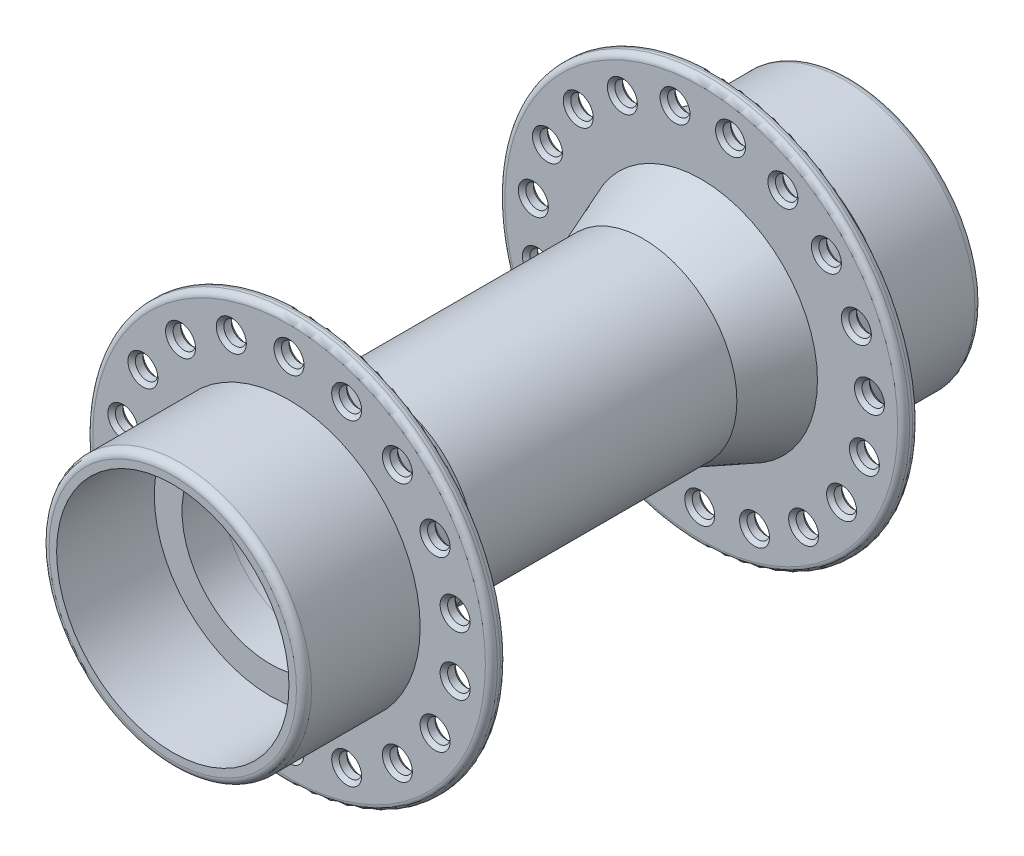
ISO-10303-21;
HEADER;
FILE_DESCRIPTION(('STEP AP214'),'2;1');
FILE_NAME('part.step','',(''),(''),'','','');
FILE_SCHEMA(('AUTOMOTIVE_DESIGN { 1 0 10303 214 1 1 1 1 }'));
ENDSEC;
DATA;
#1=APPLICATION_CONTEXT('core data for automotive mechanical design processes');
#2=APPLICATION_PROTOCOL_DEFINITION('international standard','automotive_design',2000,#1);
#3=PRODUCT_CONTEXT('',#1,'mechanical');
#4=PRODUCT('Part','Part','',(#3));
#5=PRODUCT_RELATED_PRODUCT_CATEGORY('part','',(#4));
#6=PRODUCT_DEFINITION_FORMATION('','',#4);
#7=PRODUCT_DEFINITION_CONTEXT('part definition',#1,'design');
#8=PRODUCT_DEFINITION('design','',#6,#7);
#9=PRODUCT_DEFINITION_SHAPE('','',#8);
#10=(LENGTH_UNIT() NAMED_UNIT(*) SI_UNIT(.MILLI.,.METRE.));
#11=(NAMED_UNIT(*) PLANE_ANGLE_UNIT() SI_UNIT($,.RADIAN.));
#12=(NAMED_UNIT(*) SI_UNIT($,.STERADIAN.) SOLID_ANGLE_UNIT());
#13=UNCERTAINTY_MEASURE_WITH_UNIT(LENGTH_MEASURE(1.E-05),#10,'distance_accuracy_value','');
#14=(GEOMETRIC_REPRESENTATION_CONTEXT(3) GLOBAL_UNCERTAINTY_ASSIGNED_CONTEXT((#13)) GLOBAL_UNIT_ASSIGNED_CONTEXT((#10,
#11,#12)) REPRESENTATION_CONTEXT('',''));
#15=CARTESIAN_POINT('',(0.,0.,0.));
#16=DIRECTION('',(0.,0.,1.));
#17=DIRECTION('',(1.,0.,0.));
#18=AXIS2_PLACEMENT_3D('',#15,#16,#17);
#19=CARTESIAN_POINT('',(0.,26.2,29.75));
#20=DIRECTION('',(0.,0.,-1.));
#21=DIRECTION('',(-1.,0.,0.));
#22=AXIS2_PLACEMENT_3D('',#19,#20,#21);
#23=PLANE('',#22);
#24=CARTESIAN_POINT('',(7.69545322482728,21.143083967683,29.75));
#25=DIRECTION('',(0.,0.,-1.));
#26=DIRECTION('',(-1.,0.,0.));
#27=AXIS2_PLACEMENT_3D('',#24,#25,#26);
#28=CIRCLE('',#27,2.);
#29=CARTESIAN_POINT('',(5.69545322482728,21.143083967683,29.75));
#30=VERTEX_POINT('',#29);
#31=EDGE_CURVE('E264',#30,#30,#28,.T.);
#32=ORIENTED_EDGE('',*,*,#31,.T.);
#33=EDGE_LOOP('',(#32));
#34=FACE_BOUND('',#33,.T.);
#35=CARTESIAN_POINT('',(14.4627212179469,17.2359999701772,29.75));
#36=DIRECTION('',(0.,0.,-1.));
#37=DIRECTION('',(-1.,0.,0.));
#38=AXIS2_PLACEMENT_3D('',#35,#36,#37);
#39=CIRCLE('',#38,2.);
#40=CARTESIAN_POINT('',(12.4627212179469,17.2359999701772,29.75));
#41=VERTEX_POINT('',#40);
#42=EDGE_CURVE('E276',#41,#41,#39,.T.);
#43=ORIENTED_EDGE('',*,*,#42,.T.);
#44=EDGE_LOOP('',(#43));
#45=FACE_BOUND('',#44,.T.);
#46=CARTESIAN_POINT('',(19.4855715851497,11.2500000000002,29.75));
#47=DIRECTION('',(0.,0.,-1.));
#48=DIRECTION('',(-1.,0.,0.));
#49=AXIS2_PLACEMENT_3D('',#46,#47,#48);
#50=CIRCLE('',#49,2.);
#51=CARTESIAN_POINT('',(17.4855715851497,11.2500000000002,29.75));
#52=VERTEX_POINT('',#51);
#53=EDGE_CURVE('E288',#52,#52,#50,.T.);
#54=ORIENTED_EDGE('',*,*,#53,.T.);
#55=EDGE_LOOP('',(#54));
#56=FACE_BOUND('',#55,.T.);
#57=CARTESIAN_POINT('',(22.1581744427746,3.90708399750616,29.75));
#58=DIRECTION('',(0.,0.,-1.));
#59=DIRECTION('',(-1.,0.,0.));
#60=AXIS2_PLACEMENT_3D('',#57,#58,#59);
#61=CIRCLE('',#60,2.);
#62=CARTESIAN_POINT('',(20.1581744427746,3.90708399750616,29.75));
#63=VERTEX_POINT('',#62);
#64=EDGE_CURVE('E300',#63,#63,#61,.T.);
#65=ORIENTED_EDGE('',*,*,#64,.T.);
#66=EDGE_LOOP('',(#65));
#67=FACE_BOUND('',#66,.T.);
#68=CARTESIAN_POINT('',(22.1581744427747,-3.90708399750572,29.75));
#69=DIRECTION('',(0.,0.,-1.));
#70=DIRECTION('',(-1.,0.,0.));
#71=AXIS2_PLACEMENT_3D('',#68,#69,#70);
#72=CIRCLE('',#71,2.);
#73=CARTESIAN_POINT('',(20.1581744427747,-3.90708399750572,29.75));
#74=VERTEX_POINT('',#73);
#75=EDGE_CURVE('E312',#74,#74,#72,.T.);
#76=ORIENTED_EDGE('',*,*,#75,.T.);
#77=EDGE_LOOP('',(#76));
#78=FACE_BOUND('',#77,.T.);
#79=CARTESIAN_POINT('',(19.48557158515,-11.2499999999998,29.75));
#80=DIRECTION('',(0.,0.,-1.));
#81=DIRECTION('',(-1.,0.,0.));
#82=AXIS2_PLACEMENT_3D('',#79,#80,#81);
#83=CIRCLE('',#82,2.);
#84=CARTESIAN_POINT('',(17.48557158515,-11.2499999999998,29.75));
#85=VERTEX_POINT('',#84);
#86=EDGE_CURVE('E324',#85,#85,#83,.T.);
#87=ORIENTED_EDGE('',*,*,#86,.T.);
#88=EDGE_LOOP('',(#87));
#89=FACE_BOUND('',#88,.T.);
#90=CARTESIAN_POINT('',(14.4627212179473,-17.2359999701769,29.75));
#91=DIRECTION('',(0.,0.,-1.));
#92=DIRECTION('',(-1.,0.,0.));
#93=AXIS2_PLACEMENT_3D('',#90,#91,#92);
#94=CIRCLE('',#93,2.);
#95=CARTESIAN_POINT('',(12.4627212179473,-17.2359999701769,29.75));
#96=VERTEX_POINT('',#95);
#97=EDGE_CURVE('E336',#96,#96,#94,.T.);
#98=ORIENTED_EDGE('',*,*,#97,.T.);
#99=EDGE_LOOP('',(#98));
#100=FACE_BOUND('',#99,.T.);
#101=CARTESIAN_POINT('',(7.69545322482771,-21.1430839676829,29.75));
#102=DIRECTION('',(0.,0.,-1.));
#103=DIRECTION('',(-1.,0.,0.));
#104=AXIS2_PLACEMENT_3D('',#101,#102,#103);
#105=CIRCLE('',#104,2.);
#106=CARTESIAN_POINT('',(5.6954532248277,-21.1430839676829,29.75));
#107=VERTEX_POINT('',#106);
#108=EDGE_CURVE('E348',#107,#107,#105,.T.);
#109=ORIENTED_EDGE('',*,*,#108,.T.);
#110=EDGE_LOOP('',(#109));
#111=FACE_BOUND('',#110,.T.);
#112=CARTESIAN_POINT('',(1.57185681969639E-13,-22.5,29.75));
#113=DIRECTION('',(0.,0.,-1.));
#114=DIRECTION('',(-1.,0.,0.));
#115=AXIS2_PLACEMENT_3D('',#112,#113,#114);
#116=CIRCLE('',#115,2.);
#117=CARTESIAN_POINT('',(-1.99999999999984,-22.5,29.75));
#118=VERTEX_POINT('',#117);
#119=EDGE_CURVE('E360',#118,#118,#116,.T.);
#120=ORIENTED_EDGE('',*,*,#119,.T.);
#121=EDGE_LOOP('',(#120));
#122=FACE_BOUND('',#121,.T.);
#123=CARTESIAN_POINT('',(-7.69545322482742,-21.143083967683,29.75));
#124=DIRECTION('',(0.,0.,-1.));
#125=DIRECTION('',(-1.,0.,0.));
#126=AXIS2_PLACEMENT_3D('',#123,#124,#125);
#127=CIRCLE('',#126,2.);
#128=CARTESIAN_POINT('',(-9.69545322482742,-21.143083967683,29.75));
#129=VERTEX_POINT('',#128);
#130=EDGE_CURVE('E372',#129,#129,#127,.T.);
#131=ORIENTED_EDGE('',*,*,#130,.T.);
#132=EDGE_LOOP('',(#131));
#133=FACE_BOUND('',#132,.T.);
#134=CARTESIAN_POINT('',(-14.462721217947,-17.2359999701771,29.75));
#135=DIRECTION('',(0.,0.,-1.));
#136=DIRECTION('',(-1.,0.,0.));
#137=AXIS2_PLACEMENT_3D('',#134,#135,#136);
#138=CIRCLE('',#137,2.);
#139=CARTESIAN_POINT('',(-16.462721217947,-17.2359999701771,29.75));
#140=VERTEX_POINT('',#139);
#141=EDGE_CURVE('E384',#140,#140,#138,.T.);
#142=ORIENTED_EDGE('',*,*,#141,.T.);
#143=EDGE_LOOP('',(#142));
#144=FACE_BOUND('',#143,.T.);
#145=CARTESIAN_POINT('',(-19.4855715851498,-11.2500000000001,29.75));
#146=DIRECTION('',(0.,0.,-1.));
#147=DIRECTION('',(-1.,0.,0.));
#148=AXIS2_PLACEMENT_3D('',#145,#146,#147);
#149=CIRCLE('',#148,2.);
#150=CARTESIAN_POINT('',(-21.4855715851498,-11.2500000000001,29.75));
#151=VERTEX_POINT('',#150);
#152=EDGE_CURVE('E396',#151,#151,#149,.T.);
#153=ORIENTED_EDGE('',*,*,#152,.T.);
#154=EDGE_LOOP('',(#153));
#155=FACE_BOUND('',#154,.T.);
#156=CARTESIAN_POINT('',(-22.1581744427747,-3.90708399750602,29.75));
#157=DIRECTION('',(0.,0.,-1.));
#158=DIRECTION('',(-1.,0.,0.));
#159=AXIS2_PLACEMENT_3D('',#156,#157,#158);
#160=CIRCLE('',#159,2.);
#161=CARTESIAN_POINT('',(-24.1581744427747,-3.90708399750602,29.75));
#162=VERTEX_POINT('',#161);
#163=EDGE_CURVE('E408',#162,#162,#160,.T.);
#164=ORIENTED_EDGE('',*,*,#163,.T.);
#165=EDGE_LOOP('',(#164));
#166=FACE_BOUND('',#165,.T.);
#167=CARTESIAN_POINT('',(-22.1581744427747,3.90708399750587,29.75));
#168=DIRECTION('',(0.,0.,-1.));
#169=DIRECTION('',(-1.,0.,0.));
#170=AXIS2_PLACEMENT_3D('',#167,#168,#169);
#171=CIRCLE('',#170,2.);
#172=CARTESIAN_POINT('',(-24.1581744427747,3.90708399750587,29.75));
#173=VERTEX_POINT('',#172);
#174=EDGE_CURVE('E420',#173,#173,#171,.T.);
#175=ORIENTED_EDGE('',*,*,#174,.T.);
#176=EDGE_LOOP('',(#175));
#177=FACE_BOUND('',#176,.T.);
#178=CARTESIAN_POINT('',(-19.4855715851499,11.25,29.75));
#179=DIRECTION('',(0.,0.,-1.));
#180=DIRECTION('',(-1.,0.,0.));
#181=AXIS2_PLACEMENT_3D('',#178,#179,#180);
#182=CIRCLE('',#181,2.);
#183=CARTESIAN_POINT('',(-21.4855715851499,11.25,29.75));
#184=VERTEX_POINT('',#183);
#185=EDGE_CURVE('E432',#184,#184,#182,.T.);
#186=ORIENTED_EDGE('',*,*,#185,.T.);
#187=EDGE_LOOP('',(#186));
#188=FACE_BOUND('',#187,.T.);
#189=CARTESIAN_POINT('',(-14.4627212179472,17.235999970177,29.75));
#190=DIRECTION('',(0.,0.,-1.));
#191=DIRECTION('',(-1.,0.,0.));
#192=AXIS2_PLACEMENT_3D('',#189,#190,#191);
#193=CIRCLE('',#192,2.);
#194=CARTESIAN_POINT('',(-16.4627212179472,17.235999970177,29.75));
#195=VERTEX_POINT('',#194);
#196=EDGE_CURVE('E444',#195,#195,#193,.T.);
#197=ORIENTED_EDGE('',*,*,#196,.T.);
#198=EDGE_LOOP('',(#197));
#199=FACE_BOUND('',#198,.T.);
#200=CARTESIAN_POINT('',(-7.69545322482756,21.1430839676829,29.75));
#201=DIRECTION('',(0.,0.,-1.));
#202=DIRECTION('',(-1.,0.,0.));
#203=AXIS2_PLACEMENT_3D('',#200,#201,#202);
#204=CIRCLE('',#203,2.);
#205=CARTESIAN_POINT('',(-9.69545322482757,21.1430839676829,29.75));
#206=VERTEX_POINT('',#205);
#207=EDGE_CURVE('E456',#206,#206,#204,.T.);
#208=ORIENTED_EDGE('',*,*,#207,.T.);
#209=EDGE_LOOP('',(#208));
#210=FACE_BOUND('',#209,.T.);
#211=CARTESIAN_POINT('',(0.,0.,29.75));
#212=DIRECTION('',(0.,0.,1.));
#213=DIRECTION('',(1.,0.,0.));
#214=AXIS2_PLACEMENT_3D('',#211,#212,#213);
#215=CIRCLE('',#214,17.5);
#216=CARTESIAN_POINT('',(17.5,0.,29.75));
#217=VERTEX_POINT('',#216);
#218=EDGE_CURVE('E525',#217,#217,#215,.T.);
#219=ORIENTED_EDGE('',*,*,#218,.F.);
#220=EDGE_LOOP('',(#219));
#221=FACE_BOUND('',#220,.T.);
#222=CARTESIAN_POINT('',(0.,0.,29.75));
#223=DIRECTION('',(0.,0.,1.));
#224=DIRECTION('',(1.,0.,0.));
#225=AXIS2_PLACEMENT_3D('',#222,#223,#224);
#226=CIRCLE('',#225,26.2);
#227=CARTESIAN_POINT('',(26.2,0.,29.75));
#228=VERTEX_POINT('',#227);
#229=EDGE_CURVE('E528',#228,#228,#226,.T.);
#230=ORIENTED_EDGE('',*,*,#229,.T.);
#231=EDGE_LOOP('',(#230));
#232=FACE_BOUND('',#231,.T.);
#233=CARTESIAN_POINT('',(0.,22.5,29.75));
#234=DIRECTION('',(0.,0.,-1.));
#235=DIRECTION('',(-1.,0.,0.));
#236=AXIS2_PLACEMENT_3D('',#233,#234,#235);
#237=CIRCLE('',#236,2.);
#238=CARTESIAN_POINT('',(-2.,22.5,29.75));
#239=VERTEX_POINT('',#238);
#240=EDGE_CURVE('E468',#239,#239,#237,.T.);
#241=ORIENTED_EDGE('',*,*,#240,.T.);
#242=EDGE_LOOP('',(#241));
#243=FACE_BOUND('',#242,.T.);
#244=ADVANCED_FACE('F28',(#34,#45,#56,#67,#78,#89,#100,#111,#122,#133,#144,#155,#166,#177,#188,
#199,#210,#221,#232,#243),#23,.F.);
#245=CARTESIAN_POINT('',(0.,26.2,27.75));
#246=DIRECTION('',(0.,0.,1.));
#247=DIRECTION('',(1.,0.,0.));
#248=AXIS2_PLACEMENT_3D('',#245,#246,#247);
#249=PLANE('',#248);
#250=CARTESIAN_POINT('',(7.69545322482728,21.143083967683,27.75));
#251=DIRECTION('',(0.,0.,1.));
#252=DIRECTION('',(1.,0.,0.));
#253=AXIS2_PLACEMENT_3D('',#250,#251,#252);
#254=CIRCLE('',#253,2.00000000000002);
#255=CARTESIAN_POINT('',(9.6954532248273,21.143083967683,27.75));
#256=VERTEX_POINT('',#255);
#257=EDGE_CURVE('E267',#256,#256,#254,.T.);
#258=ORIENTED_EDGE('',*,*,#257,.T.);
#259=EDGE_LOOP('',(#258));
#260=FACE_BOUND('',#259,.T.);
#261=CARTESIAN_POINT('',(14.4627212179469,17.2359999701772,27.75));
#262=DIRECTION('',(0.,0.,1.));
#263=DIRECTION('',(1.,0.,0.));
#264=AXIS2_PLACEMENT_3D('',#261,#262,#263);
#265=CIRCLE('',#264,2.00000000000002);
#266=CARTESIAN_POINT('',(16.4627212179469,17.2359999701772,27.75));
#267=VERTEX_POINT('',#266);
#268=EDGE_CURVE('E279',#267,#267,#265,.T.);
#269=ORIENTED_EDGE('',*,*,#268,.T.);
#270=EDGE_LOOP('',(#269));
#271=FACE_BOUND('',#270,.T.);
#272=CARTESIAN_POINT('',(19.4855715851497,11.2500000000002,27.75));
#273=DIRECTION('',(0.,0.,1.));
#274=DIRECTION('',(1.,0.,0.));
#275=AXIS2_PLACEMENT_3D('',#272,#273,#274);
#276=CIRCLE('',#275,2.00000000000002);
#277=CARTESIAN_POINT('',(21.4855715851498,11.2500000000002,27.75));
#278=VERTEX_POINT('',#277);
#279=EDGE_CURVE('E291',#278,#278,#276,.T.);
#280=ORIENTED_EDGE('',*,*,#279,.T.);
#281=EDGE_LOOP('',(#280));
#282=FACE_BOUND('',#281,.T.);
#283=CARTESIAN_POINT('',(22.1581744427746,3.90708399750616,27.75));
#284=DIRECTION('',(0.,0.,1.));
#285=DIRECTION('',(1.,0.,0.));
#286=AXIS2_PLACEMENT_3D('',#283,#284,#285);
#287=CIRCLE('',#286,2.00000000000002);
#288=CARTESIAN_POINT('',(24.1581744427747,3.90708399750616,27.75));
#289=VERTEX_POINT('',#288);
#290=EDGE_CURVE('E303',#289,#289,#287,.T.);
#291=ORIENTED_EDGE('',*,*,#290,.T.);
#292=EDGE_LOOP('',(#291));
#293=FACE_BOUND('',#292,.T.);
#294=CARTESIAN_POINT('',(22.1581744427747,-3.90708399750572,27.75));
#295=DIRECTION('',(0.,0.,1.));
#296=DIRECTION('',(1.,0.,0.));
#297=AXIS2_PLACEMENT_3D('',#294,#295,#296);
#298=CIRCLE('',#297,2.00000000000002);
#299=CARTESIAN_POINT('',(24.1581744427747,-3.90708399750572,27.75));
#300=VERTEX_POINT('',#299);
#301=EDGE_CURVE('E315',#300,#300,#298,.T.);
#302=ORIENTED_EDGE('',*,*,#301,.T.);
#303=EDGE_LOOP('',(#302));
#304=FACE_BOUND('',#303,.T.);
#305=CARTESIAN_POINT('',(19.48557158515,-11.2499999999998,27.75));
#306=DIRECTION('',(0.,0.,1.));
#307=DIRECTION('',(1.,0.,0.));
#308=AXIS2_PLACEMENT_3D('',#305,#306,#307);
#309=CIRCLE('',#308,2.00000000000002);
#310=CARTESIAN_POINT('',(21.48557158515,-11.2499999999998,27.75));
#311=VERTEX_POINT('',#310);
#312=EDGE_CURVE('E327',#311,#311,#309,.T.);
#313=ORIENTED_EDGE('',*,*,#312,.T.);
#314=EDGE_LOOP('',(#313));
#315=FACE_BOUND('',#314,.T.);
#316=CARTESIAN_POINT('',(14.4627212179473,-17.2359999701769,27.75));
#317=DIRECTION('',(0.,0.,1.));
#318=DIRECTION('',(1.,0.,0.));
#319=AXIS2_PLACEMENT_3D('',#316,#317,#318);
#320=CIRCLE('',#319,2.00000000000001);
#321=CARTESIAN_POINT('',(16.4627212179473,-17.2359999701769,27.75));
#322=VERTEX_POINT('',#321);
#323=EDGE_CURVE('E339',#322,#322,#320,.T.);
#324=ORIENTED_EDGE('',*,*,#323,.T.);
#325=EDGE_LOOP('',(#324));
#326=FACE_BOUND('',#325,.T.);
#327=CARTESIAN_POINT('',(7.69545322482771,-21.1430839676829,27.75));
#328=DIRECTION('',(0.,0.,1.));
#329=DIRECTION('',(1.,0.,0.));
#330=AXIS2_PLACEMENT_3D('',#327,#328,#329);
#331=CIRCLE('',#330,2.00000000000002);
#332=CARTESIAN_POINT('',(9.69545322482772,-21.1430839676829,27.75));
#333=VERTEX_POINT('',#332);
#334=EDGE_CURVE('E351',#333,#333,#331,.T.);
#335=ORIENTED_EDGE('',*,*,#334,.T.);
#336=EDGE_LOOP('',(#335));
#337=FACE_BOUND('',#336,.T.);
#338=CARTESIAN_POINT('',(1.57185681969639E-13,-22.5,27.75));
#339=DIRECTION('',(0.,0.,1.));
#340=DIRECTION('',(1.,0.,0.));
#341=AXIS2_PLACEMENT_3D('',#338,#339,#340);
#342=CIRCLE('',#341,2.00000000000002);
#343=CARTESIAN_POINT('',(2.00000000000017,-22.5,27.75));
#344=VERTEX_POINT('',#343);
#345=EDGE_CURVE('E363',#344,#344,#342,.T.);
#346=ORIENTED_EDGE('',*,*,#345,.T.);
#347=EDGE_LOOP('',(#346));
#348=FACE_BOUND('',#347,.T.);
#349=CARTESIAN_POINT('',(-7.69545322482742,-21.143083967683,27.75));
#350=DIRECTION('',(0.,0.,1.));
#351=DIRECTION('',(1.,0.,0.));
#352=AXIS2_PLACEMENT_3D('',#349,#350,#351);
#353=CIRCLE('',#352,2.00000000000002);
#354=CARTESIAN_POINT('',(-5.69545322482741,-21.143083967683,27.75));
#355=VERTEX_POINT('',#354);
#356=EDGE_CURVE('E375',#355,#355,#353,.T.);
#357=ORIENTED_EDGE('',*,*,#356,.T.);
#358=EDGE_LOOP('',(#357));
#359=FACE_BOUND('',#358,.T.);
#360=CARTESIAN_POINT('',(-14.462721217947,-17.2359999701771,27.75));
#361=DIRECTION('',(0.,0.,1.));
#362=DIRECTION('',(1.,0.,0.));
#363=AXIS2_PLACEMENT_3D('',#360,#361,#362);
#364=CIRCLE('',#363,2.00000000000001);
#365=CARTESIAN_POINT('',(-12.462721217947,-17.2359999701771,27.75));
#366=VERTEX_POINT('',#365);
#367=EDGE_CURVE('E387',#366,#366,#364,.T.);
#368=ORIENTED_EDGE('',*,*,#367,.T.);
#369=EDGE_LOOP('',(#368));
#370=FACE_BOUND('',#369,.T.);
#371=CARTESIAN_POINT('',(-19.4855715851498,-11.2500000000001,27.75));
#372=DIRECTION('',(0.,0.,1.));
#373=DIRECTION('',(1.,0.,0.));
#374=AXIS2_PLACEMENT_3D('',#371,#372,#373);
#375=CIRCLE('',#374,2.00000000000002);
#376=CARTESIAN_POINT('',(-17.4855715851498,-11.2500000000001,27.75));
#377=VERTEX_POINT('',#376);
#378=EDGE_CURVE('E399',#377,#377,#375,.T.);
#379=ORIENTED_EDGE('',*,*,#378,.T.);
#380=EDGE_LOOP('',(#379));
#381=FACE_BOUND('',#380,.T.);
#382=CARTESIAN_POINT('',(-22.1581744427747,-3.90708399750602,27.75));
#383=DIRECTION('',(0.,0.,1.));
#384=DIRECTION('',(1.,0.,0.));
#385=AXIS2_PLACEMENT_3D('',#382,#383,#384);
#386=CIRCLE('',#385,2.00000000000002);
#387=CARTESIAN_POINT('',(-20.1581744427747,-3.90708399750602,27.75));
#388=VERTEX_POINT('',#387);
#389=EDGE_CURVE('E411',#388,#388,#386,.T.);
#390=ORIENTED_EDGE('',*,*,#389,.T.);
#391=EDGE_LOOP('',(#390));
#392=FACE_BOUND('',#391,.T.);
#393=CARTESIAN_POINT('',(-22.1581744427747,3.90708399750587,27.75));
#394=DIRECTION('',(0.,0.,1.));
#395=DIRECTION('',(1.,0.,0.));
#396=AXIS2_PLACEMENT_3D('',#393,#394,#395);
#397=CIRCLE('',#396,2.00000000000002);
#398=CARTESIAN_POINT('',(-20.1581744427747,3.90708399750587,27.75));
#399=VERTEX_POINT('',#398);
#400=EDGE_CURVE('E423',#399,#399,#397,.T.);
#401=ORIENTED_EDGE('',*,*,#400,.T.);
#402=EDGE_LOOP('',(#401));
#403=FACE_BOUND('',#402,.T.);
#404=CARTESIAN_POINT('',(-19.4855715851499,11.25,27.75));
#405=DIRECTION('',(0.,0.,1.));
#406=DIRECTION('',(1.,0.,0.));
#407=AXIS2_PLACEMENT_3D('',#404,#405,#406);
#408=CIRCLE('',#407,2.00000000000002);
#409=CARTESIAN_POINT('',(-17.4855715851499,11.25,27.75));
#410=VERTEX_POINT('',#409);
#411=EDGE_CURVE('E435',#410,#410,#408,.T.);
#412=ORIENTED_EDGE('',*,*,#411,.T.);
#413=EDGE_LOOP('',(#412));
#414=FACE_BOUND('',#413,.T.);
#415=CARTESIAN_POINT('',(-14.4627212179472,17.235999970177,27.75));
#416=DIRECTION('',(0.,0.,1.));
#417=DIRECTION('',(1.,0.,0.));
#418=AXIS2_PLACEMENT_3D('',#415,#416,#417);
#419=CIRCLE('',#418,2.00000000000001);
#420=CARTESIAN_POINT('',(-12.4627212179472,17.235999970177,27.75));
#421=VERTEX_POINT('',#420);
#422=EDGE_CURVE('E447',#421,#421,#419,.T.);
#423=ORIENTED_EDGE('',*,*,#422,.T.);
#424=EDGE_LOOP('',(#423));
#425=FACE_BOUND('',#424,.T.);
#426=CARTESIAN_POINT('',(-7.69545322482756,21.1430839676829,27.75));
#427=DIRECTION('',(0.,0.,1.));
#428=DIRECTION('',(1.,0.,0.));
#429=AXIS2_PLACEMENT_3D('',#426,#427,#428);
#430=CIRCLE('',#429,2.00000000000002);
#431=CARTESIAN_POINT('',(-5.69545322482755,21.1430839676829,27.75));
#432=VERTEX_POINT('',#431);
#433=EDGE_CURVE('E459',#432,#432,#430,.T.);
#434=ORIENTED_EDGE('',*,*,#433,.T.);
#435=EDGE_LOOP('',(#434));
#436=FACE_BOUND('',#435,.T.);
#437=CARTESIAN_POINT('',(0.,0.,27.75));
#438=DIRECTION('',(0.,0.,1.));
#439=DIRECTION('',(1.,0.,0.));
#440=AXIS2_PLACEMENT_3D('',#437,#438,#439);
#441=CIRCLE('',#440,26.2);
#442=CARTESIAN_POINT('',(26.2,0.,27.75));
#443=VERTEX_POINT('',#442);
#444=EDGE_CURVE('E537',#443,#443,#441,.T.);
#445=ORIENTED_EDGE('',*,*,#444,.F.);
#446=EDGE_LOOP('',(#445));
#447=FACE_BOUND('',#446,.T.);
#448=CARTESIAN_POINT('',(0.,0.,27.75));
#449=DIRECTION('',(0.,0.,1.));
#450=DIRECTION('',(1.,0.,0.));
#451=AXIS2_PLACEMENT_3D('',#448,#449,#450);
#452=CIRCLE('',#451,15.5);
#453=CARTESIAN_POINT('',(15.5,0.,27.75));
#454=VERTEX_POINT('',#453);
#455=EDGE_CURVE('E540',#454,#454,#452,.T.);
#456=ORIENTED_EDGE('',*,*,#455,.T.);
#457=EDGE_LOOP('',(#456));
#458=FACE_BOUND('',#457,.T.);
#459=CARTESIAN_POINT('',(0.,22.5,27.75));
#460=DIRECTION('',(0.,0.,1.));
#461=DIRECTION('',(1.,0.,0.));
#462=AXIS2_PLACEMENT_3D('',#459,#460,#461);
#463=CIRCLE('',#462,2.00000000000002);
#464=CARTESIAN_POINT('',(2.00000000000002,22.5,27.75));
#465=VERTEX_POINT('',#464);
#466=EDGE_CURVE('E471',#465,#465,#463,.T.);
#467=ORIENTED_EDGE('',*,*,#466,.T.);
#468=EDGE_LOOP('',(#467));
#469=FACE_BOUND('',#468,.T.);
#470=ADVANCED_FACE('F577',(#260,#271,#282,#293,#304,#315,#326,#337,#348,#359,#370,#381,#392,
#403,#414,#425,#436,#447,#458,#469),#249,.F.);
#471=CARTESIAN_POINT('',(0.,17.5,-33.25));
#472=DIRECTION('',(0.,0.,1.));
#473=DIRECTION('',(1.,0.,0.));
#474=AXIS2_PLACEMENT_3D('',#471,#472,#473);
#475=PLANE('',#474);
#476=CARTESIAN_POINT('',(0.,0.,-33.25));
#477=DIRECTION('',(0.,0.,1.));
#478=DIRECTION('',(1.,0.,0.));
#479=AXIS2_PLACEMENT_3D('',#476,#477,#478);
#480=CIRCLE('',#479,18.);
#481=CARTESIAN_POINT('',(18.,0.,-33.25));
#482=VERTEX_POINT('',#481);
#483=EDGE_CURVE('E567',#482,#482,#480,.T.);
#484=ORIENTED_EDGE('',*,*,#483,.F.);
#485=EDGE_LOOP('',(#484));
#486=FACE_BOUND('',#485,.T.);
#487=CARTESIAN_POINT('',(0.,0.,-33.25));
#488=DIRECTION('',(0.,0.,1.));
#489=DIRECTION('',(1.,0.,0.));
#490=AXIS2_PLACEMENT_3D('',#487,#488,#489);
#491=CIRCLE('',#490,17.5);
#492=CARTESIAN_POINT('',(17.5,0.,-33.25));
#493=VERTEX_POINT('',#492);
#494=EDGE_CURVE('E480',#493,#493,#491,.T.);
#495=ORIENTED_EDGE('',*,*,#494,.T.);
#496=EDGE_LOOP('',(#495));
#497=FACE_BOUND('',#496,.T.);
#498=ADVANCED_FACE('F573',(#486,#497),#475,.F.);
#499=CARTESIAN_POINT('',(0.,0.,45.25));
#500=DIRECTION('',(0.,0.,1.));
#501=DIRECTION('',(1.,0.,0.));
#502=AXIS2_PLACEMENT_3D('',#499,#500,#501);
#503=CYLINDRICAL_SURFACE('',#502,17.5);
#504=ORIENTED_EDGE('',*,*,#494,.F.);
#505=EDGE_LOOP('',(#504));
#506=FACE_BOUND('',#505,.T.);
#507=CARTESIAN_POINT('',(0.,0.,-44.25));
#508=DIRECTION('',(0.,0.,1.));
#509=DIRECTION('',(1.,0.,0.));
#510=AXIS2_PLACEMENT_3D('',#507,#508,#509);
#511=CIRCLE('',#510,17.5);
#512=CARTESIAN_POINT('',(17.5,0.,-44.25));
#513=VERTEX_POINT('',#512);
#514=EDGE_CURVE('E483',#513,#513,#511,.T.);
#515=ORIENTED_EDGE('',*,*,#514,.T.);
#516=EDGE_LOOP('',(#515));
#517=FACE_BOUND('',#516,.T.);
#518=ADVANCED_FACE('F576',(#506,#517),#503,.T.);
#519=CARTESIAN_POINT('',(0.,0.,-44.25));
#520=DIRECTION('',(0.,0.,1.));
#521=DIRECTION('',(1.,0.,0.));
#522=AXIS2_PLACEMENT_3D('',#519,#520,#521);
#523=TOROIDAL_SURFACE('',#522,16.5,1.);
#524=ORIENTED_EDGE('',*,*,#514,.F.);
#525=EDGE_LOOP('',(#524));
#526=FACE_BOUND('',#525,.T.);
#527=CARTESIAN_POINT('',(0.,0.,-45.25));
#528=DIRECTION('',(0.,0.,1.));
#529=DIRECTION('',(1.,0.,0.));
#530=AXIS2_PLACEMENT_3D('',#527,#528,#529);
#531=CIRCLE('',#530,16.5);
#532=CARTESIAN_POINT('',(16.5,0.,-45.25));
#533=VERTEX_POINT('',#532);
#534=EDGE_CURVE('E486',#533,#533,#531,.T.);
#535=ORIENTED_EDGE('',*,*,#534,.T.);
#536=EDGE_LOOP('',(#535));
#537=FACE_BOUND('',#536,.T.);
#538=ADVANCED_FACE('F583',(#526,#537),#523,.T.);
#539=CARTESIAN_POINT('',(0.,16.5,-45.25));
#540=DIRECTION('',(0.,0.,1.));
#541=DIRECTION('',(1.,0.,0.));
#542=AXIS2_PLACEMENT_3D('',#539,#540,#541);
#543=PLANE('',#542);
#544=ORIENTED_EDGE('',*,*,#534,.F.);
#545=EDGE_LOOP('',(#544));
#546=FACE_BOUND('',#545,.T.);
#547=CARTESIAN_POINT('',(0.,0.,-45.25));
#548=DIRECTION('',(0.,0.,1.));
#549=DIRECTION('',(1.,0.,0.));
#550=AXIS2_PLACEMENT_3D('',#547,#548,#549);
#551=CIRCLE('',#550,15.0771712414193);
#552=CARTESIAN_POINT('',(15.0771712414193,0.,-45.25));
#553=VERTEX_POINT('',#552);
#554=EDGE_CURVE('E489',#553,#553,#551,.T.);
#555=ORIENTED_EDGE('',*,*,#554,.T.);
#556=EDGE_LOOP('',(#555));
#557=FACE_BOUND('',#556,.T.);
#558=ADVANCED_FACE('F589',(#546,#557),#543,.F.);
#559=CARTESIAN_POINT('',(0.,0.,45.25));
#560=DIRECTION('',(0.,0.,1.));
#561=DIRECTION('',(1.,0.,0.));
#562=AXIS2_PLACEMENT_3D('',#559,#560,#561);
#563=CYLINDRICAL_SURFACE('',#562,15.0771712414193);
#564=ORIENTED_EDGE('',*,*,#554,.F.);
#565=EDGE_LOOP('',(#564));
#566=FACE_BOUND('',#565,.T.);
#567=CARTESIAN_POINT('',(0.,0.,-29.5099479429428));
#568=DIRECTION('',(0.,0.,1.));
#569=DIRECTION('',(1.,0.,0.));
#570=AXIS2_PLACEMENT_3D('',#567,#568,#569);
#571=CIRCLE('',#570,15.0771712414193);
#572=CARTESIAN_POINT('',(15.0771712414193,0.,-29.5099479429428));
#573=VERTEX_POINT('',#572);
#574=EDGE_CURVE('E492',#573,#573,#571,.T.);
#575=ORIENTED_EDGE('',*,*,#574,.T.);
#576=EDGE_LOOP('',(#575));
#577=FACE_BOUND('',#576,.T.);
#578=ADVANCED_FACE('F595',(#566,#577),#563,.F.);
#579=CARTESIAN_POINT('',(0.,15.0771712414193,-29.5099479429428));
#580=DIRECTION('',(0.,0.,1.));
#581=DIRECTION('',(1.,0.,0.));
#582=AXIS2_PLACEMENT_3D('',#579,#580,#581);
#583=PLANE('',#582);
#584=ORIENTED_EDGE('',*,*,#574,.F.);
#585=EDGE_LOOP('',(#584));
#586=FACE_BOUND('',#585,.T.);
#587=CARTESIAN_POINT('',(0.,0.,-29.5099479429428));
#588=DIRECTION('',(0.,0.,1.));
#589=DIRECTION('',(1.,0.,0.));
#590=AXIS2_PLACEMENT_3D('',#587,#588,#589);
#591=CIRCLE('',#590,12.6388987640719);
#592=CARTESIAN_POINT('',(12.6388987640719,0.,-29.5099479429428));
#593=VERTEX_POINT('',#592);
#594=EDGE_CURVE('E495',#593,#593,#591,.T.);
#595=ORIENTED_EDGE('',*,*,#594,.T.);
#596=EDGE_LOOP('',(#595));
#597=FACE_BOUND('',#596,.T.);
#598=ADVANCED_FACE('F601',(#586,#597),#583,.F.);
#599=CARTESIAN_POINT('',(0.,0.,45.25));
#600=DIRECTION('',(0.,0.,1.));
#601=DIRECTION('',(1.,0.,0.));
#602=AXIS2_PLACEMENT_3D('',#599,#600,#601);
#603=CYLINDRICAL_SURFACE('',#602,12.6388987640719);
#604=ORIENTED_EDGE('',*,*,#594,.F.);
#605=EDGE_LOOP('',(#604));
#606=FACE_BOUND('',#605,.T.);
#607=CARTESIAN_POINT('',(0.,0.,-27.5742784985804));
#608=DIRECTION('',(0.,0.,1.));
#609=DIRECTION('',(1.,0.,0.));
#610=AXIS2_PLACEMENT_3D('',#607,#608,#609);
#611=CIRCLE('',#610,12.6388987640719);
#612=CARTESIAN_POINT('',(12.6388987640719,0.,-27.5742784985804));
#613=VERTEX_POINT('',#612);
#614=EDGE_CURVE('E498',#613,#613,#611,.T.);
#615=ORIENTED_EDGE('',*,*,#614,.T.);
#616=EDGE_LOOP('',(#615));
#617=FACE_BOUND('',#616,.T.);
#618=ADVANCED_FACE('F607',(#606,#617),#603,.F.);
#619=CARTESIAN_POINT('',(0.,0.,-27.5742784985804));
#620=DIRECTION('',(0.,0.,1.));
#621=DIRECTION('',(1.,0.,0.));
#622=AXIS2_PLACEMENT_3D('',#619,#620,#621);
#623=DEGENERATE_TOROIDAL_SURFACE('',#622,3.63889876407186,9.,.T.);
#624=ORIENTED_EDGE('',*,*,#614,.F.);
#625=EDGE_LOOP('',(#624));
#626=FACE_BOUND('',#625,.T.);
#627=CARTESIAN_POINT('',(0.,0.,-20.));
#628=DIRECTION('',(0.,0.,1.));
#629=DIRECTION('',(1.,0.,0.));
#630=AXIS2_PLACEMENT_3D('',#627,#628,#629);
#631=CIRCLE('',#630,8.5);
#632=CARTESIAN_POINT('',(8.5,0.,-20.));
#633=VERTEX_POINT('',#632);
#634=EDGE_CURVE('E501',#633,#633,#631,.T.);
#635=ORIENTED_EDGE('',*,*,#634,.T.);
#636=EDGE_LOOP('',(#635));
#637=FACE_BOUND('',#636,.T.);
#638=ADVANCED_FACE('F613',(#626,#637),#623,.F.);
#639=CARTESIAN_POINT('',(0.,0.,45.25));
#640=DIRECTION('',(0.,0.,1.));
#641=DIRECTION('',(1.,0.,0.));
#642=AXIS2_PLACEMENT_3D('',#639,#640,#641);
#643=CYLINDRICAL_SURFACE('',#642,8.5);
#644=ORIENTED_EDGE('',*,*,#634,.F.);
#645=EDGE_LOOP('',(#644));
#646=FACE_BOUND('',#645,.T.);
#647=CARTESIAN_POINT('',(0.,0.,20.));
#648=DIRECTION('',(0.,0.,1.));
#649=DIRECTION('',(1.,0.,0.));
#650=AXIS2_PLACEMENT_3D('',#647,#648,#649);
#651=CIRCLE('',#650,8.49999999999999);
#652=CARTESIAN_POINT('',(8.49999999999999,0.,20.));
#653=VERTEX_POINT('',#652);
#654=EDGE_CURVE('E504',#653,#653,#651,.T.);
#655=ORIENTED_EDGE('',*,*,#654,.T.);
#656=EDGE_LOOP('',(#655));
#657=FACE_BOUND('',#656,.T.);
#658=ADVANCED_FACE('F619',(#646,#657),#643,.F.);
#659=CARTESIAN_POINT('',(0.,0.,26.9640111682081));
#660=DIRECTION('',(0.,0.,1.));
#661=DIRECTION('',(1.,0.,0.));
#662=AXIS2_PLACEMENT_3D('',#659,#660,#661);
#663=DEGENERATE_TOROIDAL_SURFACE('',#662,2.79889936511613,9.,.T.);
#664=ORIENTED_EDGE('',*,*,#654,.F.);
#665=EDGE_LOOP('',(#664));
#666=FACE_BOUND('',#665,.T.);
#667=CARTESIAN_POINT('',(0.,0.,26.9640111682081));
#668=DIRECTION('',(0.,0.,1.));
#669=DIRECTION('',(1.,0.,0.));
#670=AXIS2_PLACEMENT_3D('',#667,#668,#669);
#671=CIRCLE('',#670,11.7988993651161);
#672=CARTESIAN_POINT('',(11.7988993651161,0.,26.9640111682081));
#673=VERTEX_POINT('',#672);
#674=EDGE_CURVE('E507',#673,#673,#671,.T.);
#675=ORIENTED_EDGE('',*,*,#674,.T.);
#676=EDGE_LOOP('',(#675));
#677=FACE_BOUND('',#676,.T.);
#678=ADVANCED_FACE('F625',(#666,#677),#663,.F.);
#679=CARTESIAN_POINT('',(0.,0.,45.25));
#680=DIRECTION('',(0.,0.,1.));
#681=DIRECTION('',(1.,0.,0.));
#682=AXIS2_PLACEMENT_3D('',#679,#680,#681);
#683=CYLINDRICAL_SURFACE('',#682,11.7988993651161);
#684=ORIENTED_EDGE('',*,*,#674,.F.);
#685=EDGE_LOOP('',(#684));
#686=FACE_BOUND('',#685,.T.);
#687=CARTESIAN_POINT('',(0.,0.,32.220949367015));
#688=DIRECTION('',(0.,0.,1.));
#689=DIRECTION('',(1.,0.,0.));
#690=AXIS2_PLACEMENT_3D('',#687,#688,#689);
#691=CIRCLE('',#690,11.7988993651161);
#692=CARTESIAN_POINT('',(11.7988993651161,0.,32.220949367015));
#693=VERTEX_POINT('',#692);
#694=EDGE_CURVE('E510',#693,#693,#691,.T.);
#695=ORIENTED_EDGE('',*,*,#694,.T.);
#696=EDGE_LOOP('',(#695));
#697=FACE_BOUND('',#696,.T.);
#698=ADVANCED_FACE('F631',(#686,#697),#683,.F.);
#699=CARTESIAN_POINT('',(0.,15.5,32.220949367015));
#700=DIRECTION('',(0.,0.,-1.));
#701=DIRECTION('',(-1.,0.,0.));
#702=AXIS2_PLACEMENT_3D('',#699,#700,#701);
#703=PLANE('',#702);
#704=ORIENTED_EDGE('',*,*,#694,.F.);
#705=EDGE_LOOP('',(#704));
#706=FACE_BOUND('',#705,.T.);
#707=CARTESIAN_POINT('',(0.,0.,32.220949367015));
#708=DIRECTION('',(0.,0.,1.));
#709=DIRECTION('',(1.,0.,0.));
#710=AXIS2_PLACEMENT_3D('',#707,#708,#709);
#711=CIRCLE('',#710,15.5);
#712=CARTESIAN_POINT('',(15.5,0.,32.220949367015));
#713=VERTEX_POINT('',#712);
#714=EDGE_CURVE('E513',#713,#713,#711,.T.);
#715=ORIENTED_EDGE('',*,*,#714,.T.);
#716=EDGE_LOOP('',(#715));
#717=FACE_BOUND('',#716,.T.);
#718=ADVANCED_FACE('F637',(#706,#717),#703,.F.);
#719=CARTESIAN_POINT('',(0.,0.,45.25));
#720=DIRECTION('',(0.,0.,1.));
#721=DIRECTION('',(1.,0.,0.));
#722=AXIS2_PLACEMENT_3D('',#719,#720,#721);
#723=CYLINDRICAL_SURFACE('',#722,15.5);
#724=ORIENTED_EDGE('',*,*,#714,.F.);
#725=EDGE_LOOP('',(#724));
#726=FACE_BOUND('',#725,.T.);
#727=CARTESIAN_POINT('',(0.,0.,45.25));
#728=DIRECTION('',(0.,0.,1.));
#729=DIRECTION('',(1.,0.,0.));
#730=AXIS2_PLACEMENT_3D('',#727,#728,#729);
#731=CIRCLE('',#730,15.5);
#732=CARTESIAN_POINT('',(15.5,0.,45.25));
#733=VERTEX_POINT('',#732);
#734=EDGE_CURVE('E516',#733,#733,#731,.T.);
#735=ORIENTED_EDGE('',*,*,#734,.T.);
#736=EDGE_LOOP('',(#735));
#737=FACE_BOUND('',#736,.T.);
#738=ADVANCED_FACE('F643',(#726,#737),#723,.F.);
#739=CARTESIAN_POINT('',(0.,16.5,45.25));
#740=DIRECTION('',(0.,0.,-1.));
#741=DIRECTION('',(-1.,0.,0.));
#742=AXIS2_PLACEMENT_3D('',#739,#740,#741);
#743=PLANE('',#742);
#744=ORIENTED_EDGE('',*,*,#734,.F.);
#745=EDGE_LOOP('',(#744));
#746=FACE_BOUND('',#745,.T.);
#747=CARTESIAN_POINT('',(0.,0.,45.25));
#748=DIRECTION('',(0.,0.,1.));
#749=DIRECTION('',(1.,0.,0.));
#750=AXIS2_PLACEMENT_3D('',#747,#748,#749);
#751=CIRCLE('',#750,16.5);
#752=CARTESIAN_POINT('',(16.5,0.,45.25));
#753=VERTEX_POINT('',#752);
#754=EDGE_CURVE('E519',#753,#753,#751,.T.);
#755=ORIENTED_EDGE('',*,*,#754,.T.);
#756=EDGE_LOOP('',(#755));
#757=FACE_BOUND('',#756,.T.);
#758=ADVANCED_FACE('F649',(#746,#757),#743,.F.);
#759=CARTESIAN_POINT('',(0.,0.,44.25));
#760=DIRECTION('',(0.,0.,1.));
#761=DIRECTION('',(1.,0.,0.));
#762=AXIS2_PLACEMENT_3D('',#759,#760,#761);
#763=TOROIDAL_SURFACE('',#762,16.5,1.);
#764=ORIENTED_EDGE('',*,*,#754,.F.);
#765=EDGE_LOOP('',(#764));
#766=FACE_BOUND('',#765,.T.);
#767=CARTESIAN_POINT('',(0.,0.,44.25));
#768=DIRECTION('',(0.,0.,1.));
#769=DIRECTION('',(1.,0.,0.));
#770=AXIS2_PLACEMENT_3D('',#767,#768,#769);
#771=CIRCLE('',#770,17.5);
#772=CARTESIAN_POINT('',(17.5,0.,44.25));
#773=VERTEX_POINT('',#772);
#774=EDGE_CURVE('E522',#773,#773,#771,.T.);
#775=ORIENTED_EDGE('',*,*,#774,.T.);
#776=EDGE_LOOP('',(#775));
#777=FACE_BOUND('',#776,.T.);
#778=ADVANCED_FACE('F655',(#766,#777),#763,.T.);
#779=CARTESIAN_POINT('',(0.,0.,45.25));
#780=DIRECTION('',(0.,0.,1.));
#781=DIRECTION('',(1.,0.,0.));
#782=AXIS2_PLACEMENT_3D('',#779,#780,#781);
#783=CYLINDRICAL_SURFACE('',#782,17.5);
#784=ORIENTED_EDGE('',*,*,#774,.F.);
#785=EDGE_LOOP('',(#784));
#786=FACE_BOUND('',#785,.T.);
#787=ORIENTED_EDGE('',*,*,#218,.T.);
#788=EDGE_LOOP('',(#787));
#789=FACE_BOUND('',#788,.T.);
#790=ADVANCED_FACE('F661',(#786,#789),#783,.T.);
#791=CARTESIAN_POINT('',(0.,0.,28.95));
#792=DIRECTION('',(0.,0.,1.));
#793=DIRECTION('',(1.,0.,0.));
#794=AXIS2_PLACEMENT_3D('',#791,#792,#793);
#795=TOROIDAL_SURFACE('',#794,26.2,0.799999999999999);
#796=ORIENTED_EDGE('',*,*,#229,.F.);
#797=EDGE_LOOP('',(#796));
#798=FACE_BOUND('',#797,.T.);
#799=CARTESIAN_POINT('',(0.,0.,28.95));
#800=DIRECTION('',(0.,0.,1.));
#801=DIRECTION('',(1.,0.,0.));
#802=AXIS2_PLACEMENT_3D('',#799,#800,#801);
#803=CIRCLE('',#802,27.);
#804=CARTESIAN_POINT('',(27.,0.,28.95));
#805=VERTEX_POINT('',#804);
#806=EDGE_CURVE('E531',#805,#805,#803,.T.);
#807=ORIENTED_EDGE('',*,*,#806,.T.);
#808=EDGE_LOOP('',(#807));
#809=FACE_BOUND('',#808,.T.);
#810=ADVANCED_FACE('F667',(#798,#809),#795,.T.);
#811=CARTESIAN_POINT('',(0.,0.,45.25));
#812=DIRECTION('',(0.,0.,1.));
#813=DIRECTION('',(1.,0.,0.));
#814=AXIS2_PLACEMENT_3D('',#811,#812,#813);
#815=CYLINDRICAL_SURFACE('',#814,27.);
#816=ORIENTED_EDGE('',*,*,#806,.F.);
#817=EDGE_LOOP('',(#816));
#818=FACE_BOUND('',#817,.T.);
#819=CARTESIAN_POINT('',(0.,0.,28.55));
#820=DIRECTION('',(0.,0.,1.));
#821=DIRECTION('',(1.,0.,0.));
#822=AXIS2_PLACEMENT_3D('',#819,#820,#821);
#823=CIRCLE('',#822,27.);
#824=CARTESIAN_POINT('',(27.,0.,28.55));
#825=VERTEX_POINT('',#824);
#826=EDGE_CURVE('E534',#825,#825,#823,.T.);
#827=ORIENTED_EDGE('',*,*,#826,.T.);
#828=EDGE_LOOP('',(#827));
#829=FACE_BOUND('',#828,.T.);
#830=ADVANCED_FACE('F739',(#818,#829),#815,.T.);
#831=CARTESIAN_POINT('',(0.,0.,28.55));
#832=DIRECTION('',(0.,0.,1.));
#833=DIRECTION('',(1.,0.,0.));
#834=AXIS2_PLACEMENT_3D('',#831,#832,#833);
#835=TOROIDAL_SURFACE('',#834,26.2,0.800000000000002);
#836=ORIENTED_EDGE('',*,*,#826,.F.);
#837=EDGE_LOOP('',(#836));
#838=FACE_BOUND('',#837,.T.);
#839=ORIENTED_EDGE('',*,*,#444,.T.);
#840=EDGE_LOOP('',(#839));
#841=FACE_BOUND('',#840,.T.);
#842=ADVANCED_FACE('F732',(#838,#841),#835,.T.);
#843=CARTESIAN_POINT('',(0.,0.,17.5));
#844=DIRECTION('',(0.,0.,1.));
#845=DIRECTION('',(1.,0.,0.));
#846=AXIS2_PLACEMENT_3D('',#843,#844,#845);
#847=CONICAL_SURFACE('',#846,12.5,0.284730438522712);
#848=ORIENTED_EDGE('',*,*,#455,.F.);
#849=EDGE_LOOP('',(#848));
#850=FACE_BOUND('',#849,.T.);
#851=CARTESIAN_POINT('',(0.,0.,17.5));
#852=DIRECTION('',(0.,0.,1.));
#853=DIRECTION('',(1.,0.,0.));
#854=AXIS2_PLACEMENT_3D('',#851,#852,#853);
#855=CIRCLE('',#854,12.5);
#856=CARTESIAN_POINT('',(12.5,0.,17.5));
#857=VERTEX_POINT('',#856);
#858=EDGE_CURVE('E543',#857,#857,#855,.T.);
#859=ORIENTED_EDGE('',*,*,#858,.T.);
#860=EDGE_LOOP('',(#859));
#861=FACE_BOUND('',#860,.T.);
#862=ADVANCED_FACE('F728',(#850,#861),#847,.T.);
#863=CARTESIAN_POINT('',(0.,0.,45.25));
#864=DIRECTION('',(0.,0.,1.));
#865=DIRECTION('',(1.,0.,0.));
#866=AXIS2_PLACEMENT_3D('',#863,#864,#865);
#867=CYLINDRICAL_SURFACE('',#866,12.5);
#868=ORIENTED_EDGE('',*,*,#858,.F.);
#869=EDGE_LOOP('',(#868));
#870=FACE_BOUND('',#869,.T.);
#871=CARTESIAN_POINT('',(0.,0.,-17.5));
#872=DIRECTION('',(0.,0.,1.));
#873=DIRECTION('',(1.,0.,0.));
#874=AXIS2_PLACEMENT_3D('',#871,#872,#873);
#875=CIRCLE('',#874,12.5);
#876=CARTESIAN_POINT('',(12.5,0.,-17.5));
#877=VERTEX_POINT('',#876);
#878=EDGE_CURVE('E546',#877,#877,#875,.T.);
#879=ORIENTED_EDGE('',*,*,#878,.T.);
#880=EDGE_LOOP('',(#879));
#881=FACE_BOUND('',#880,.T.);
#882=ADVANCED_FACE('F724',(#870,#881),#867,.T.);
#883=CARTESIAN_POINT('',(0.,0.,-25.25));
#884=DIRECTION('',(0.,0.,-1.));
#885=DIRECTION('',(-1.,0.,0.));
#886=AXIS2_PLACEMENT_3D('',#883,#884,#885);
#887=CONICAL_SURFACE('',#886,15.5,0.369333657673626);
#888=ORIENTED_EDGE('',*,*,#878,.F.);
#889=EDGE_LOOP('',(#888));
#890=FACE_BOUND('',#889,.T.);
#891=CARTESIAN_POINT('',(0.,0.,-25.25));
#892=DIRECTION('',(0.,0.,1.));
#893=DIRECTION('',(1.,0.,0.));
#894=AXIS2_PLACEMENT_3D('',#891,#892,#893);
#895=CIRCLE('',#894,15.5);
#896=CARTESIAN_POINT('',(15.5,0.,-25.25));
#897=VERTEX_POINT('',#896);
#898=EDGE_CURVE('E549',#897,#897,#895,.T.);
#899=ORIENTED_EDGE('',*,*,#898,.T.);
#900=EDGE_LOOP('',(#899));
#901=FACE_BOUND('',#900,.T.);
#902=ADVANCED_FACE('F720',(#890,#901),#887,.T.);
#903=CARTESIAN_POINT('',(0.,26.2,-25.25));
#904=DIRECTION('',(0.,0.,-1.));
#905=DIRECTION('',(-1.,0.,0.));
#906=AXIS2_PLACEMENT_3D('',#903,#904,#905);
#907=PLANE('',#906);
#908=CARTESIAN_POINT('',(10.8901348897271,19.6889553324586,-25.25));
#909=DIRECTION('',(0.,0.,-1.));
#910=DIRECTION('',(-1.,0.,0.));
#911=AXIS2_PLACEMENT_3D('',#908,#909,#910);
#912=CIRCLE('',#911,2.);
#913=CARTESIAN_POINT('',(8.89013488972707,19.6889553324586,-25.25));
#914=VERTEX_POINT('',#913);
#915=EDGE_CURVE('E43',#914,#914,#912,.T.);
#916=ORIENTED_EDGE('',*,*,#915,.T.);
#917=EDGE_LOOP('',(#916));
#918=FACE_BOUND('',#917,.T.);
#919=CARTESIAN_POINT('',(16.6930706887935,15.0861324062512,-25.25));
#920=DIRECTION('',(0.,0.,-1.));
#921=DIRECTION('',(-1.,0.,0.));
#922=AXIS2_PLACEMENT_3D('',#919,#920,#921);
#923=CIRCLE('',#922,2.);
#924=CARTESIAN_POINT('',(14.6930706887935,15.0861324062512,-25.25));
#925=VERTEX_POINT('',#924);
#926=EDGE_CURVE('E57',#925,#925,#923,.T.);
#927=ORIENTED_EDGE('',*,*,#926,.T.);
#928=EDGE_LOOP('',(#927));
#929=FACE_BOUND('',#928,.T.);
#930=CARTESIAN_POINT('',(20.6870532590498,8.84849294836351,-25.25));
#931=DIRECTION('',(0.,0.,-1.));
#932=DIRECTION('',(-1.,0.,0.));
#933=AXIS2_PLACEMENT_3D('',#930,#931,#932);
#934=CIRCLE('',#933,2.);
#935=CARTESIAN_POINT('',(18.6870532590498,8.84849294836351,-25.25));
#936=VERTEX_POINT('',#935);
#937=EDGE_CURVE('E69',#936,#936,#934,.T.);
#938=ORIENTED_EDGE('',*,*,#937,.T.);
#939=EDGE_LOOP('',(#938));
#940=FACE_BOUND('',#939,.T.);
#941=CARTESIAN_POINT('',(22.4392726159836,1.65198198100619,-25.25));
#942=DIRECTION('',(0.,0.,-1.));
#943=DIRECTION('',(-1.,0.,0.));
#944=AXIS2_PLACEMENT_3D('',#941,#942,#943);
#945=CIRCLE('',#944,2.);
#946=CARTESIAN_POINT('',(20.4392726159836,1.65198198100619,-25.25));
#947=VERTEX_POINT('',#946);
#948=EDGE_CURVE('E81',#947,#947,#945,.T.);
#949=ORIENTED_EDGE('',*,*,#948,.T.);
#950=EDGE_LOOP('',(#949));
#951=FACE_BOUND('',#950,.T.);
#952=CARTESIAN_POINT('',(21.7598486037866,-5.72354686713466,-25.25));
#953=DIRECTION('',(0.,0.,-1.));
#954=DIRECTION('',(-1.,0.,0.));
#955=AXIS2_PLACEMENT_3D('',#952,#953,#954);
#956=CIRCLE('',#955,2.);
#957=CARTESIAN_POINT('',(19.7598486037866,-5.72354686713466,-25.25));
#958=VERTEX_POINT('',#957);
#959=EDGE_CURVE('E93',#958,#958,#956,.T.);
#960=ORIENTED_EDGE('',*,*,#959,.T.);
#961=EDGE_LOOP('',(#960));
#962=FACE_BOUND('',#961,.T.);
#963=CARTESIAN_POINT('',(18.7224073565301,-12.4788406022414,-25.25));
#964=DIRECTION('',(0.,0.,-1.));
#965=DIRECTION('',(-1.,0.,0.));
#966=AXIS2_PLACEMENT_3D('',#963,#964,#965);
#967=CIRCLE('',#966,2.);
#968=CARTESIAN_POINT('',(16.7224073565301,-12.4788406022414,-25.25));
#969=VERTEX_POINT('',#968);
#970=EDGE_CURVE('E105',#969,#969,#967,.T.);
#971=ORIENTED_EDGE('',*,*,#970,.T.);
#972=EDGE_LOOP('',(#971));
#973=FACE_BOUND('',#972,.T.);
#974=CARTESIAN_POINT('',(13.6561027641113,-17.881858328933,-25.25));
#975=DIRECTION('',(0.,0.,-1.));
#976=DIRECTION('',(-1.,0.,0.));
#977=AXIS2_PLACEMENT_3D('',#974,#975,#976);
#978=CIRCLE('',#977,2.);
#979=CARTESIAN_POINT('',(11.6561027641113,-17.881858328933,-25.25));
#980=VERTEX_POINT('',#979);
#981=EDGE_CURVE('E117',#980,#980,#978,.T.);
#982=ORIENTED_EDGE('',*,*,#981,.T.);
#983=EDGE_LOOP('',(#982));
#984=FACE_BOUND('',#983,.T.);
#985=CARTESIAN_POINT('',(7.10994754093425,-21.3470992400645,-25.25));
#986=DIRECTION('',(0.,0.,-1.));
#987=DIRECTION('',(-1.,0.,0.));
#988=AXIS2_PLACEMENT_3D('',#985,#986,#987);
#989=CIRCLE('',#988,2.);
#990=CARTESIAN_POINT('',(5.10994754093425,-21.3470992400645,-25.25));
#991=VERTEX_POINT('',#990);
#992=EDGE_CURVE('E129',#991,#991,#989,.T.);
#993=ORIENTED_EDGE('',*,*,#992,.T.);
#994=EDGE_LOOP('',(#993));
#995=FACE_BOUND('',#994,.T.);
#996=CARTESIAN_POINT('',(-0.20668082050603,-22.499050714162,-25.25));
#997=DIRECTION('',(0.,0.,-1.));
#998=DIRECTION('',(-1.,0.,0.));
#999=AXIS2_PLACEMENT_3D('',#996,#997,#998);
#1000=CIRCLE('',#999,2.);
#1001=CARTESIAN_POINT('',(-2.20668082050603,-22.499050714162,-25.25));
#1002=VERTEX_POINT('',#1001);
#1003=EDGE_CURVE('E141',#1002,#1002,#1000,.T.);
#1004=ORIENTED_EDGE('',*,*,#1003,.T.);
#1005=EDGE_LOOP('',(#1004));
#1006=FACE_BOUND('',#1005,.T.);
#1007=CARTESIAN_POINT('',(-7.50091210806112,-21.2128809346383,-25.25));
#1008=DIRECTION('',(0.,0.,-1.));
#1009=DIRECTION('',(-1.,0.,0.));
#1010=AXIS2_PLACEMENT_3D('',#1007,#1008,#1009);
#1011=CIRCLE('',#1010,2.);
#1012=CARTESIAN_POINT('',(-9.50091210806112,-21.2128809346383,-25.25));
#1013=VERTEX_POINT('',#1012);
#1014=EDGE_CURVE('E153',#1013,#1013,#1011,.T.);
#1015=ORIENTED_EDGE('',*,*,#1014,.T.);
#1016=EDGE_LOOP('',(#1015));
#1017=FACE_BOUND('',#1016,.T.);
#1018=CARTESIAN_POINT('',(-13.9823031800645,-17.6279663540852,-25.25));
#1019=DIRECTION('',(0.,0.,-1.));
#1020=DIRECTION('',(-1.,0.,0.));
#1021=AXIS2_PLACEMENT_3D('',#1018,#1019,#1020);
#1022=CIRCLE('',#1021,2.);
#1023=CARTESIAN_POINT('',(-15.9823031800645,-17.6279663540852,-25.25));
#1024=VERTEX_POINT('',#1023);
#1025=EDGE_CURVE('E165',#1024,#1024,#1022,.T.);
#1026=ORIENTED_EDGE('',*,*,#1025,.T.);
#1027=EDGE_LOOP('',(#1026));
#1028=FACE_BOUND('',#1027,.T.);
#1029=CARTESIAN_POINT('',(-18.9484947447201,-12.1327880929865,-25.25));
#1030=DIRECTION('',(0.,0.,-1.));
#1031=DIRECTION('',(-1.,0.,0.));
#1032=AXIS2_PLACEMENT_3D('',#1029,#1030,#1031);
#1033=CIRCLE('',#1032,2.);
#1034=CARTESIAN_POINT('',(-20.9484947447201,-12.1327880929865,-25.25));
#1035=VERTEX_POINT('',#1034);
#1036=EDGE_CURVE('E177',#1035,#1035,#1033,.T.);
#1037=ORIENTED_EDGE('',*,*,#1036,.T.);
#1038=EDGE_LOOP('',(#1037));
#1039=FACE_BOUND('',#1038,.T.);
#1040=CARTESIAN_POINT('',(-21.8613228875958,-5.32283398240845,-25.25));
#1041=DIRECTION('',(0.,0.,-1.));
#1042=DIRECTION('',(-1.,0.,0.));
#1043=AXIS2_PLACEMENT_3D('',#1040,#1041,#1042);
#1044=CIRCLE('',#1043,2.);
#1045=CARTESIAN_POINT('',(-23.8613228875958,-5.32283398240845,-25.25));
#1046=VERTEX_POINT('',#1045);
#1047=EDGE_CURVE('E189',#1046,#1046,#1044,.T.);
#1048=ORIENTED_EDGE('',*,*,#1047,.T.);
#1049=EDGE_LOOP('',(#1048));
#1050=FACE_BOUND('',#1049,.T.);
#1051=CARTESIAN_POINT('',(-22.4051374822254,2.0639317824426,-25.25));
#1052=DIRECTION('',(0.,0.,-1.));
#1053=DIRECTION('',(-1.,0.,0.));
#1054=AXIS2_PLACEMENT_3D('',#1051,#1052,#1053);
#1055=CIRCLE('',#1054,2.);
#1056=CARTESIAN_POINT('',(-24.4051374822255,2.0639317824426,-25.25));
#1057=VERTEX_POINT('',#1056);
#1058=EDGE_CURVE('E201',#1057,#1057,#1055,.T.);
#1059=ORIENTED_EDGE('',*,*,#1058,.T.);
#1060=EDGE_LOOP('',(#1059));
#1061=FACE_BOUND('',#1060,.T.);
#1062=CARTESIAN_POINT('',(-20.5210077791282,9.22703851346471,-25.25));
#1063=DIRECTION('',(0.,0.,-1.));
#1064=DIRECTION('',(-1.,0.,0.));
#1065=AXIS2_PLACEMENT_3D('',#1062,#1063,#1064);
#1066=CIRCLE('',#1065,2.);
#1067=CARTESIAN_POINT('',(-22.5210077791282,9.22703851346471,-25.25));
#1068=VERTEX_POINT('',#1067);
#1069=EDGE_CURVE('E213',#1068,#1068,#1066,.T.);
#1070=ORIENTED_EDGE('',*,*,#1069,.T.);
#1071=EDGE_LOOP('',(#1070));
#1072=FACE_BOUND('',#1071,.T.);
#1073=CARTESIAN_POINT('',(-16.4131084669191,15.3902524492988,-25.25));
#1074=DIRECTION('',(0.,0.,-1.));
#1075=DIRECTION('',(-1.,0.,0.));
#1076=AXIS2_PLACEMENT_3D('',#1073,#1074,#1075);
#1077=CIRCLE('',#1076,2.);
#1078=CARTESIAN_POINT('',(-18.4131084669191,15.3902524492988,-25.25));
#1079=VERTEX_POINT('',#1078);
#1080=EDGE_CURVE('E225',#1079,#1079,#1077,.T.);
#1081=ORIENTED_EDGE('',*,*,#1080,.T.);
#1082=EDGE_LOOP('',(#1081));
#1083=FACE_BOUND('',#1082,.T.);
#1084=CARTESIAN_POINT('',(-10.5265941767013,19.8856937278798,-25.25));
#1085=DIRECTION('',(0.,0.,-1.));
#1086=DIRECTION('',(-1.,0.,0.));
#1087=AXIS2_PLACEMENT_3D('',#1084,#1085,#1086);
#1088=CIRCLE('',#1087,2.);
#1089=CARTESIAN_POINT('',(-12.5265941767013,19.8856937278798,-25.25));
#1090=VERTEX_POINT('',#1089);
#1091=EDGE_CURVE('E237',#1090,#1090,#1088,.T.);
#1092=ORIENTED_EDGE('',*,*,#1091,.T.);
#1093=EDGE_LOOP('',(#1092));
#1094=FACE_BOUND('',#1093,.T.);
#1095=CARTESIAN_POINT('',(-3.49936007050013,22.2262115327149,-25.25));
#1096=DIRECTION('',(0.,0.,-1.));
#1097=DIRECTION('',(-1.,0.,0.));
#1098=AXIS2_PLACEMENT_3D('',#1095,#1096,#1097);
#1099=CIRCLE('',#1098,2.);
#1100=CARTESIAN_POINT('',(-5.49936007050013,22.2262115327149,-25.25));
#1101=VERTEX_POINT('',#1100);
#1102=EDGE_CURVE('E249',#1101,#1101,#1099,.T.);
#1103=ORIENTED_EDGE('',*,*,#1102,.T.);
#1104=EDGE_LOOP('',(#1103));
#1105=FACE_BOUND('',#1104,.T.);
#1106=CARTESIAN_POINT('',(3.90708399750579,22.1581744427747,-25.25));
#1107=DIRECTION('',(0.,0.,-1.));
#1108=DIRECTION('',(-1.,0.,0.));
#1109=AXIS2_PLACEMENT_3D('',#1106,#1107,#1108);
#1110=CIRCLE('',#1109,2.);
#1111=CARTESIAN_POINT('',(1.90708399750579,22.1581744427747,-25.25));
#1112=VERTEX_POINT('',#1111);
#1113=EDGE_CURVE('E261',#1112,#1112,#1110,.T.);
#1114=ORIENTED_EDGE('',*,*,#1113,.T.);
#1115=EDGE_LOOP('',(#1114));
#1116=FACE_BOUND('',#1115,.T.);
#1117=ORIENTED_EDGE('',*,*,#898,.F.);
#1118=EDGE_LOOP('',(#1117));
#1119=FACE_BOUND('',#1118,.T.);
#1120=CARTESIAN_POINT('',(0.,0.,-25.25));
#1121=DIRECTION('',(0.,0.,1.));
#1122=DIRECTION('',(1.,0.,0.));
#1123=AXIS2_PLACEMENT_3D('',#1120,#1121,#1122);
#1124=CIRCLE('',#1123,26.2);
#1125=CARTESIAN_POINT('',(26.2,0.,-25.25));
#1126=VERTEX_POINT('',#1125);
#1127=EDGE_CURVE('E552',#1126,#1126,#1124,.T.);
#1128=ORIENTED_EDGE('',*,*,#1127,.T.);
#1129=EDGE_LOOP('',(#1128));
#1130=FACE_BOUND('',#1129,.T.);
#1131=ADVANCED_FACE('F716',(#918,#929,#940,#951,#962,#973,#984,#995,#1006,#1017,#1028,#1039,
#1050,#1061,#1072,#1083,#1094,#1105,#1116,#1119,#1130),#907,.F.);
#1132=CARTESIAN_POINT('',(0.,0.,-26.05));
#1133=DIRECTION('',(0.,0.,1.));
#1134=DIRECTION('',(1.,0.,0.));
#1135=AXIS2_PLACEMENT_3D('',#1132,#1133,#1134);
#1136=TOROIDAL_SURFACE('',#1135,26.2,0.799999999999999);
#1137=ORIENTED_EDGE('',*,*,#1127,.F.);
#1138=EDGE_LOOP('',(#1137));
#1139=FACE_BOUND('',#1138,.T.);
#1140=CARTESIAN_POINT('',(0.,0.,-26.05));
#1141=DIRECTION('',(0.,0.,1.));
#1142=DIRECTION('',(1.,0.,0.));
#1143=AXIS2_PLACEMENT_3D('',#1140,#1141,#1142);
#1144=CIRCLE('',#1143,27.);
#1145=CARTESIAN_POINT('',(27.,0.,-26.05));
#1146=VERTEX_POINT('',#1145);
#1147=EDGE_CURVE('E555',#1146,#1146,#1144,.T.);
#1148=ORIENTED_EDGE('',*,*,#1147,.T.);
#1149=EDGE_LOOP('',(#1148));
#1150=FACE_BOUND('',#1149,.T.);
#1151=ADVANCED_FACE('F712',(#1139,#1150),#1136,.T.);
#1152=CARTESIAN_POINT('',(0.,0.,45.25));
#1153=DIRECTION('',(0.,0.,1.));
#1154=DIRECTION('',(1.,0.,0.));
#1155=AXIS2_PLACEMENT_3D('',#1152,#1153,#1154);
#1156=CYLINDRICAL_SURFACE('',#1155,27.);
#1157=ORIENTED_EDGE('',*,*,#1147,.F.);
#1158=EDGE_LOOP('',(#1157));
#1159=FACE_BOUND('',#1158,.T.);
#1160=CARTESIAN_POINT('',(0.,0.,-26.45));
#1161=DIRECTION('',(0.,0.,1.));
#1162=DIRECTION('',(1.,0.,0.));
#1163=AXIS2_PLACEMENT_3D('',#1160,#1161,#1162);
#1164=CIRCLE('',#1163,27.);
#1165=CARTESIAN_POINT('',(27.,0.,-26.45));
#1166=VERTEX_POINT('',#1165);
#1167=EDGE_CURVE('E558',#1166,#1166,#1164,.T.);
#1168=ORIENTED_EDGE('',*,*,#1167,.T.);
#1169=EDGE_LOOP('',(#1168));
#1170=FACE_BOUND('',#1169,.T.);
#1171=ADVANCED_FACE('F708',(#1159,#1170),#1156,.T.);
#1172=CARTESIAN_POINT('',(0.,0.,-26.45));
#1173=DIRECTION('',(0.,0.,1.));
#1174=DIRECTION('',(1.,0.,0.));
#1175=AXIS2_PLACEMENT_3D('',#1172,#1173,#1174);
#1176=TOROIDAL_SURFACE('',#1175,26.2,0.799999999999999);
#1177=ORIENTED_EDGE('',*,*,#1167,.F.);
#1178=EDGE_LOOP('',(#1177));
#1179=FACE_BOUND('',#1178,.T.);
#1180=CARTESIAN_POINT('',(0.,0.,-27.25));
#1181=DIRECTION('',(0.,0.,1.));
#1182=DIRECTION('',(1.,0.,0.));
#1183=AXIS2_PLACEMENT_3D('',#1180,#1181,#1182);
#1184=CIRCLE('',#1183,26.2);
#1185=CARTESIAN_POINT('',(26.2,0.,-27.25));
#1186=VERTEX_POINT('',#1185);
#1187=EDGE_CURVE('E561',#1186,#1186,#1184,.T.);
#1188=ORIENTED_EDGE('',*,*,#1187,.T.);
#1189=EDGE_LOOP('',(#1188));
#1190=FACE_BOUND('',#1189,.T.);
#1191=ADVANCED_FACE('F705',(#1179,#1190),#1176,.T.);
#1192=CARTESIAN_POINT('',(0.,26.2,-27.25));
#1193=DIRECTION('',(0.,0.,1.));
#1194=DIRECTION('',(1.,0.,0.));
#1195=AXIS2_PLACEMENT_3D('',#1192,#1193,#1194);
#1196=PLANE('',#1195);
#1197=CARTESIAN_POINT('',(10.8901348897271,19.6889553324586,-27.25));
#1198=DIRECTION('',(0.,0.,1.));
#1199=DIRECTION('',(1.,0.,0.));
#1200=AXIS2_PLACEMENT_3D('',#1197,#1198,#1199);
#1201=CIRCLE('',#1200,2.00000000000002);
#1202=CARTESIAN_POINT('',(12.8901348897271,19.6889553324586,-27.25));
#1203=VERTEX_POINT('',#1202);
#1204=EDGE_CURVE('E10',#1203,#1203,#1201,.T.);
#1205=ORIENTED_EDGE('',*,*,#1204,.T.);
#1206=EDGE_LOOP('',(#1205));
#1207=FACE_BOUND('',#1206,.T.);
#1208=CARTESIAN_POINT('',(16.6930706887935,15.0861324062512,-27.25));
#1209=DIRECTION('',(0.,0.,1.));
#1210=DIRECTION('',(1.,0.,0.));
#1211=AXIS2_PLACEMENT_3D('',#1208,#1209,#1210);
#1212=CIRCLE('',#1211,2.00000000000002);
#1213=CARTESIAN_POINT('',(18.6930706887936,15.0861324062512,-27.25));
#1214=VERTEX_POINT('',#1213);
#1215=EDGE_CURVE('E48',#1214,#1214,#1212,.T.);
#1216=ORIENTED_EDGE('',*,*,#1215,.T.);
#1217=EDGE_LOOP('',(#1216));
#1218=FACE_BOUND('',#1217,.T.);
#1219=CARTESIAN_POINT('',(20.6870532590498,8.84849294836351,-27.25));
#1220=DIRECTION('',(0.,0.,1.));
#1221=DIRECTION('',(1.,0.,0.));
#1222=AXIS2_PLACEMENT_3D('',#1219,#1220,#1221);
#1223=CIRCLE('',#1222,2.00000000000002);
#1224=CARTESIAN_POINT('',(22.6870532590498,8.84849294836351,-27.25));
#1225=VERTEX_POINT('',#1224);
#1226=EDGE_CURVE('E60',#1225,#1225,#1223,.T.);
#1227=ORIENTED_EDGE('',*,*,#1226,.T.);
#1228=EDGE_LOOP('',(#1227));
#1229=FACE_BOUND('',#1228,.T.);
#1230=CARTESIAN_POINT('',(22.4392726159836,1.65198198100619,-27.25));
#1231=DIRECTION('',(0.,0.,1.));
#1232=DIRECTION('',(1.,0.,0.));
#1233=AXIS2_PLACEMENT_3D('',#1230,#1231,#1232);
#1234=CIRCLE('',#1233,2.00000000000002);
#1235=CARTESIAN_POINT('',(24.4392726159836,1.65198198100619,-27.25));
#1236=VERTEX_POINT('',#1235);
#1237=EDGE_CURVE('E72',#1236,#1236,#1234,.T.);
#1238=ORIENTED_EDGE('',*,*,#1237,.T.);
#1239=EDGE_LOOP('',(#1238));
#1240=FACE_BOUND('',#1239,.T.);
#1241=CARTESIAN_POINT('',(21.7598486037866,-5.72354686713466,-27.25));
#1242=DIRECTION('',(0.,0.,1.));
#1243=DIRECTION('',(1.,0.,0.));
#1244=AXIS2_PLACEMENT_3D('',#1241,#1242,#1243);
#1245=CIRCLE('',#1244,2.00000000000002);
#1246=CARTESIAN_POINT('',(23.7598486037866,-5.72354686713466,-27.25));
#1247=VERTEX_POINT('',#1246);
#1248=EDGE_CURVE('E84',#1247,#1247,#1245,.T.);
#1249=ORIENTED_EDGE('',*,*,#1248,.T.);
#1250=EDGE_LOOP('',(#1249));
#1251=FACE_BOUND('',#1250,.T.);
#1252=CARTESIAN_POINT('',(18.7224073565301,-12.4788406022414,-27.25));
#1253=DIRECTION('',(0.,0.,1.));
#1254=DIRECTION('',(1.,0.,0.));
#1255=AXIS2_PLACEMENT_3D('',#1252,#1253,#1254);
#1256=CIRCLE('',#1255,2.00000000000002);
#1257=CARTESIAN_POINT('',(20.7224073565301,-12.4788406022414,-27.25));
#1258=VERTEX_POINT('',#1257);
#1259=EDGE_CURVE('E96',#1258,#1258,#1256,.T.);
#1260=ORIENTED_EDGE('',*,*,#1259,.T.);
#1261=EDGE_LOOP('',(#1260));
#1262=FACE_BOUND('',#1261,.T.);
#1263=CARTESIAN_POINT('',(13.6561027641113,-17.881858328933,-27.25));
#1264=DIRECTION('',(0.,0.,1.));
#1265=DIRECTION('',(1.,0.,0.));
#1266=AXIS2_PLACEMENT_3D('',#1263,#1264,#1265);
#1267=CIRCLE('',#1266,2.00000000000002);
#1268=CARTESIAN_POINT('',(15.6561027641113,-17.881858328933,-27.25));
#1269=VERTEX_POINT('',#1268);
#1270=EDGE_CURVE('E108',#1269,#1269,#1267,.T.);
#1271=ORIENTED_EDGE('',*,*,#1270,.T.);
#1272=EDGE_LOOP('',(#1271));
#1273=FACE_BOUND('',#1272,.T.);
#1274=CARTESIAN_POINT('',(7.10994754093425,-21.3470992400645,-27.25));
#1275=DIRECTION('',(0.,0.,1.));
#1276=DIRECTION('',(1.,0.,0.));
#1277=AXIS2_PLACEMENT_3D('',#1274,#1275,#1276);
#1278=CIRCLE('',#1277,2.00000000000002);
#1279=CARTESIAN_POINT('',(9.10994754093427,-21.3470992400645,-27.25));
#1280=VERTEX_POINT('',#1279);
#1281=EDGE_CURVE('E120',#1280,#1280,#1278,.T.);
#1282=ORIENTED_EDGE('',*,*,#1281,.T.);
#1283=EDGE_LOOP('',(#1282));
#1284=FACE_BOUND('',#1283,.T.);
#1285=CARTESIAN_POINT('',(-0.20668082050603,-22.499050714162,-27.25));
#1286=DIRECTION('',(0.,0.,1.));
#1287=DIRECTION('',(1.,0.,0.));
#1288=AXIS2_PLACEMENT_3D('',#1285,#1286,#1287);
#1289=CIRCLE('',#1288,2.00000000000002);
#1290=CARTESIAN_POINT('',(1.79331917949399,-22.499050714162,-27.25));
#1291=VERTEX_POINT('',#1290);
#1292=EDGE_CURVE('E132',#1291,#1291,#1289,.T.);
#1293=ORIENTED_EDGE('',*,*,#1292,.T.);
#1294=EDGE_LOOP('',(#1293));
#1295=FACE_BOUND('',#1294,.T.);
#1296=CARTESIAN_POINT('',(-7.50091210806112,-21.2128809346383,-27.25));
#1297=DIRECTION('',(0.,0.,1.));
#1298=DIRECTION('',(1.,0.,0.));
#1299=AXIS2_PLACEMENT_3D('',#1296,#1297,#1298);
#1300=CIRCLE('',#1299,2.00000000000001);
#1301=CARTESIAN_POINT('',(-5.5009121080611,-21.2128809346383,-27.25));
#1302=VERTEX_POINT('',#1301);
#1303=EDGE_CURVE('E144',#1302,#1302,#1300,.T.);
#1304=ORIENTED_EDGE('',*,*,#1303,.T.);
#1305=EDGE_LOOP('',(#1304));
#1306=FACE_BOUND('',#1305,.T.);
#1307=CARTESIAN_POINT('',(-13.9823031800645,-17.6279663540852,-27.25));
#1308=DIRECTION('',(0.,0.,1.));
#1309=DIRECTION('',(1.,0.,0.));
#1310=AXIS2_PLACEMENT_3D('',#1307,#1308,#1309);
#1311=CIRCLE('',#1310,2.00000000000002);
#1312=CARTESIAN_POINT('',(-11.9823031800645,-17.6279663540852,-27.25));
#1313=VERTEX_POINT('',#1312);
#1314=EDGE_CURVE('E156',#1313,#1313,#1311,.T.);
#1315=ORIENTED_EDGE('',*,*,#1314,.T.);
#1316=EDGE_LOOP('',(#1315));
#1317=FACE_BOUND('',#1316,.T.);
#1318=CARTESIAN_POINT('',(-18.9484947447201,-12.1327880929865,-27.25));
#1319=DIRECTION('',(0.,0.,1.));
#1320=DIRECTION('',(1.,0.,0.));
#1321=AXIS2_PLACEMENT_3D('',#1318,#1319,#1320);
#1322=CIRCLE('',#1321,2.00000000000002);
#1323=CARTESIAN_POINT('',(-16.9484947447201,-12.1327880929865,-27.25));
#1324=VERTEX_POINT('',#1323);
#1325=EDGE_CURVE('E168',#1324,#1324,#1322,.T.);
#1326=ORIENTED_EDGE('',*,*,#1325,.T.);
#1327=EDGE_LOOP('',(#1326));
#1328=FACE_BOUND('',#1327,.T.);
#1329=CARTESIAN_POINT('',(-21.8613228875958,-5.32283398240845,-27.25));
#1330=DIRECTION('',(0.,0.,1.));
#1331=DIRECTION('',(1.,0.,0.));
#1332=AXIS2_PLACEMENT_3D('',#1329,#1330,#1331);
#1333=CIRCLE('',#1332,2.00000000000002);
#1334=CARTESIAN_POINT('',(-19.8613228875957,-5.32283398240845,-27.25));
#1335=VERTEX_POINT('',#1334);
#1336=EDGE_CURVE('E180',#1335,#1335,#1333,.T.);
#1337=ORIENTED_EDGE('',*,*,#1336,.T.);
#1338=EDGE_LOOP('',(#1337));
#1339=FACE_BOUND('',#1338,.T.);
#1340=CARTESIAN_POINT('',(-22.4051374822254,2.0639317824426,-27.25));
#1341=DIRECTION('',(0.,0.,1.));
#1342=DIRECTION('',(1.,0.,0.));
#1343=AXIS2_PLACEMENT_3D('',#1340,#1341,#1342);
#1344=CIRCLE('',#1343,2.00000000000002);
#1345=CARTESIAN_POINT('',(-20.4051374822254,2.0639317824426,-27.25));
#1346=VERTEX_POINT('',#1345);
#1347=EDGE_CURVE('E192',#1346,#1346,#1344,.T.);
#1348=ORIENTED_EDGE('',*,*,#1347,.T.);
#1349=EDGE_LOOP('',(#1348));
#1350=FACE_BOUND('',#1349,.T.);
#1351=CARTESIAN_POINT('',(-20.5210077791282,9.22703851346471,-27.25));
#1352=DIRECTION('',(0.,0.,1.));
#1353=DIRECTION('',(1.,0.,0.));
#1354=AXIS2_PLACEMENT_3D('',#1351,#1352,#1353);
#1355=CIRCLE('',#1354,2.00000000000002);
#1356=CARTESIAN_POINT('',(-18.5210077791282,9.22703851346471,-27.25));
#1357=VERTEX_POINT('',#1356);
#1358=EDGE_CURVE('E204',#1357,#1357,#1355,.T.);
#1359=ORIENTED_EDGE('',*,*,#1358,.T.);
#1360=EDGE_LOOP('',(#1359));
#1361=FACE_BOUND('',#1360,.T.);
#1362=CARTESIAN_POINT('',(-16.4131084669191,15.3902524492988,-27.25));
#1363=DIRECTION('',(0.,0.,1.));
#1364=DIRECTION('',(1.,0.,0.));
#1365=AXIS2_PLACEMENT_3D('',#1362,#1363,#1364);
#1366=CIRCLE('',#1365,2.00000000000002);
#1367=CARTESIAN_POINT('',(-14.4131084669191,15.3902524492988,-27.25));
#1368=VERTEX_POINT('',#1367);
#1369=EDGE_CURVE('E216',#1368,#1368,#1366,.T.);
#1370=ORIENTED_EDGE('',*,*,#1369,.T.);
#1371=EDGE_LOOP('',(#1370));
#1372=FACE_BOUND('',#1371,.T.);
#1373=CARTESIAN_POINT('',(-10.5265941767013,19.8856937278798,-27.25));
#1374=DIRECTION('',(0.,0.,1.));
#1375=DIRECTION('',(1.,0.,0.));
#1376=AXIS2_PLACEMENT_3D('',#1373,#1374,#1375);
#1377=CIRCLE('',#1376,2.00000000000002);
#1378=CARTESIAN_POINT('',(-8.52659417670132,19.8856937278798,-27.25));
#1379=VERTEX_POINT('',#1378);
#1380=EDGE_CURVE('E228',#1379,#1379,#1377,.T.);
#1381=ORIENTED_EDGE('',*,*,#1380,.T.);
#1382=EDGE_LOOP('',(#1381));
#1383=FACE_BOUND('',#1382,.T.);
#1384=CARTESIAN_POINT('',(-3.49936007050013,22.2262115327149,-27.25));
#1385=DIRECTION('',(0.,0.,1.));
#1386=DIRECTION('',(1.,0.,0.));
#1387=AXIS2_PLACEMENT_3D('',#1384,#1385,#1386);
#1388=CIRCLE('',#1387,2.00000000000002);
#1389=CARTESIAN_POINT('',(-1.49936007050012,22.2262115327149,-27.25));
#1390=VERTEX_POINT('',#1389);
#1391=EDGE_CURVE('E240',#1390,#1390,#1388,.T.);
#1392=ORIENTED_EDGE('',*,*,#1391,.T.);
#1393=EDGE_LOOP('',(#1392));
#1394=FACE_BOUND('',#1393,.T.);
#1395=CARTESIAN_POINT('',(3.90708399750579,22.1581744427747,-27.25));
#1396=DIRECTION('',(0.,0.,1.));
#1397=DIRECTION('',(1.,0.,0.));
#1398=AXIS2_PLACEMENT_3D('',#1395,#1396,#1397);
#1399=CIRCLE('',#1398,2.00000000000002);
#1400=CARTESIAN_POINT('',(5.90708399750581,22.1581744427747,-27.25));
#1401=VERTEX_POINT('',#1400);
#1402=EDGE_CURVE('E252',#1401,#1401,#1399,.T.);
#1403=ORIENTED_EDGE('',*,*,#1402,.T.);
#1404=EDGE_LOOP('',(#1403));
#1405=FACE_BOUND('',#1404,.T.);
#1406=ORIENTED_EDGE('',*,*,#1187,.F.);
#1407=EDGE_LOOP('',(#1406));
#1408=FACE_BOUND('',#1407,.T.);
#1409=CARTESIAN_POINT('',(0.,0.,-27.25));
#1410=DIRECTION('',(0.,0.,1.));
#1411=DIRECTION('',(1.,0.,0.));
#1412=AXIS2_PLACEMENT_3D('',#1409,#1410,#1411);
#1413=CIRCLE('',#1412,18.);
#1414=CARTESIAN_POINT('',(18.,0.,-27.25));
#1415=VERTEX_POINT('',#1414);
#1416=EDGE_CURVE('E564',#1415,#1415,#1413,.T.);
#1417=ORIENTED_EDGE('',*,*,#1416,.T.);
#1418=EDGE_LOOP('',(#1417));
#1419=FACE_BOUND('',#1418,.T.);
#1420=ADVANCED_FACE('F697',(#1207,#1218,#1229,#1240,#1251,#1262,#1273,#1284,#1295,#1306,#1317,
#1328,#1339,#1350,#1361,#1372,#1383,#1394,#1405,#1408,#1419),#1196,.F.);
#1421=CARTESIAN_POINT('',(0.,0.,45.25));
#1422=DIRECTION('',(0.,0.,1.));
#1423=DIRECTION('',(1.,0.,0.));
#1424=AXIS2_PLACEMENT_3D('',#1421,#1422,#1423);
#1425=CYLINDRICAL_SURFACE('',#1424,18.);
#1426=ORIENTED_EDGE('',*,*,#1416,.F.);
#1427=EDGE_LOOP('',(#1426));
#1428=FACE_BOUND('',#1427,.T.);
#1429=ORIENTED_EDGE('',*,*,#483,.T.);
#1430=EDGE_LOOP('',(#1429));
#1431=FACE_BOUND('',#1430,.T.);
#1432=ADVANCED_FACE('F571',(#1428,#1431),#1425,.T.);
#1433=CARTESIAN_POINT('',(0.,22.5,45.25));
#1434=DIRECTION('',(0.,0.,-1.));
#1435=DIRECTION('',(-1.,0.,0.));
#1436=AXIS2_PLACEMENT_3D('',#1433,#1434,#1435);
#1437=CYLINDRICAL_SURFACE('',#1436,1.5);
#1438=CARTESIAN_POINT('',(0.,22.5,28.25));
#1439=DIRECTION('',(0.,0.,1.));
#1440=DIRECTION('',(1.,0.,0.));
#1441=AXIS2_PLACEMENT_3D('',#1438,#1439,#1440);
#1442=CIRCLE('',#1441,1.5);
#1443=CARTESIAN_POINT('',(1.5,22.5,28.25));
#1444=VERTEX_POINT('',#1443);
#1445=EDGE_CURVE('E474',#1444,#1444,#1442,.F.);
#1446=ORIENTED_EDGE('',*,*,#1445,.T.);
#1447=EDGE_LOOP('',(#1446));
#1448=FACE_BOUND('',#1447,.T.);
#1449=CARTESIAN_POINT('',(0.,22.5,29.25));
#1450=DIRECTION('',(0.,0.,-1.));
#1451=DIRECTION('',(-1.,0.,0.));
#1452=AXIS2_PLACEMENT_3D('',#1449,#1450,#1451);
#1453=CIRCLE('',#1452,1.5);
#1454=CARTESIAN_POINT('',(-1.5,22.5,29.25));
#1455=VERTEX_POINT('',#1454);
#1456=EDGE_CURVE('E477',#1455,#1455,#1453,.F.);
#1457=ORIENTED_EDGE('',*,*,#1456,.T.);
#1458=EDGE_LOOP('',(#1457));
#1459=FACE_BOUND('',#1458,.T.);
#1460=ADVANCED_FACE('F687',(#1448,#1459),#1437,.F.);
#1461=CARTESIAN_POINT('',(0.,22.5,28.25));
#1462=DIRECTION('',(0.,0.,-1.));
#1463=DIRECTION('',(-1.,0.,0.));
#1464=AXIS2_PLACEMENT_3D('',#1461,#1462,#1463);
#1465=CONICAL_SURFACE('',#1464,1.5,0.78539816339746);
#1466=ORIENTED_EDGE('',*,*,#466,.F.);
#1467=EDGE_LOOP('',(#1466));
#1468=FACE_BOUND('',#1467,.T.);
#1469=ORIENTED_EDGE('',*,*,#1445,.F.);
#1470=EDGE_LOOP('',(#1469));
#1471=FACE_BOUND('',#1470,.T.);
#1472=ADVANCED_FACE('F683',(#1468,#1471),#1465,.F.);
#1473=CARTESIAN_POINT('',(0.,22.5,29.25));
#1474=DIRECTION('',(0.,0.,1.));
#1475=DIRECTION('',(1.,0.,0.));
#1476=AXIS2_PLACEMENT_3D('',#1473,#1474,#1475);
#1477=CONICAL_SURFACE('',#1476,1.5,0.78539816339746);
#1478=ORIENTED_EDGE('',*,*,#240,.F.);
#1479=EDGE_LOOP('',(#1478));
#1480=FACE_BOUND('',#1479,.T.);
#1481=ORIENTED_EDGE('',*,*,#1456,.F.);
#1482=EDGE_LOOP('',(#1481));
#1483=FACE_BOUND('',#1482,.T.);
#1484=ADVANCED_FACE('F679',(#1480,#1483),#1477,.F.);
#1485=CARTESIAN_POINT('',(-7.69545322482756,21.1430839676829,45.25));
#1486=DIRECTION('',(0.,0.,-1.));
#1487=DIRECTION('',(-1.,0.,0.));
#1488=AXIS2_PLACEMENT_3D('',#1485,#1486,#1487);
#1489=CYLINDRICAL_SURFACE('',#1488,1.5);
#1490=CARTESIAN_POINT('',(-7.69545322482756,21.1430839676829,28.25));
#1491=DIRECTION('',(0.,0.,1.));
#1492=DIRECTION('',(1.,0.,0.));
#1493=AXIS2_PLACEMENT_3D('',#1490,#1491,#1492);
#1494=CIRCLE('',#1493,1.5);
#1495=CARTESIAN_POINT('',(-6.19545322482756,21.1430839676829,28.25));
#1496=VERTEX_POINT('',#1495);
#1497=EDGE_CURVE('E462',#1496,#1496,#1494,.F.);
#1498=ORIENTED_EDGE('',*,*,#1497,.T.);
#1499=EDGE_LOOP('',(#1498));
#1500=FACE_BOUND('',#1499,.T.);
#1501=CARTESIAN_POINT('',(-7.69545322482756,21.1430839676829,29.25));
#1502=DIRECTION('',(0.,0.,-1.));
#1503=DIRECTION('',(-1.,0.,0.));
#1504=AXIS2_PLACEMENT_3D('',#1501,#1502,#1503);
#1505=CIRCLE('',#1504,1.5);
#1506=CARTESIAN_POINT('',(-9.19545322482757,21.1430839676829,29.25));
#1507=VERTEX_POINT('',#1506);
#1508=EDGE_CURVE('E465',#1507,#1507,#1505,.F.);
#1509=ORIENTED_EDGE('',*,*,#1508,.T.);
#1510=EDGE_LOOP('',(#1509));
#1511=FACE_BOUND('',#1510,.T.);
#1512=ADVANCED_FACE('F682',(#1500,#1511),#1489,.F.);
#1513=CARTESIAN_POINT('',(-14.4627212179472,17.235999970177,45.25));
#1514=DIRECTION('',(0.,0.,-1.));
#1515=DIRECTION('',(-1.,0.,0.));
#1516=AXIS2_PLACEMENT_3D('',#1513,#1514,#1515);
#1517=CYLINDRICAL_SURFACE('',#1516,1.5);
#1518=CARTESIAN_POINT('',(-14.4627212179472,17.235999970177,28.25));
#1519=DIRECTION('',(0.,0.,1.));
#1520=DIRECTION('',(1.,0.,0.));
#1521=AXIS2_PLACEMENT_3D('',#1518,#1519,#1520);
#1522=CIRCLE('',#1521,1.5);
#1523=CARTESIAN_POINT('',(-12.9627212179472,17.235999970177,28.25));
#1524=VERTEX_POINT('',#1523);
#1525=EDGE_CURVE('E450',#1524,#1524,#1522,.F.);
#1526=ORIENTED_EDGE('',*,*,#1525,.T.);
#1527=EDGE_LOOP('',(#1526));
#1528=FACE_BOUND('',#1527,.T.);
#1529=CARTESIAN_POINT('',(-14.4627212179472,17.235999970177,29.25));
#1530=DIRECTION('',(0.,0.,-1.));
#1531=DIRECTION('',(-1.,0.,0.));
#1532=AXIS2_PLACEMENT_3D('',#1529,#1530,#1531);
#1533=CIRCLE('',#1532,1.5);
#1534=CARTESIAN_POINT('',(-15.9627212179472,17.235999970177,29.25));
#1535=VERTEX_POINT('',#1534);
#1536=EDGE_CURVE('E453',#1535,#1535,#1533,.F.);
#1537=ORIENTED_EDGE('',*,*,#1536,.T.);
#1538=EDGE_LOOP('',(#1537));
#1539=FACE_BOUND('',#1538,.T.);
#1540=ADVANCED_FACE('F1244',(#1528,#1539),#1517,.F.);
#1541=CARTESIAN_POINT('',(-19.4855715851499,11.25,45.25));
#1542=DIRECTION('',(0.,0.,-1.));
#1543=DIRECTION('',(-1.,0.,0.));
#1544=AXIS2_PLACEMENT_3D('',#1541,#1542,#1543);
#1545=CYLINDRICAL_SURFACE('',#1544,1.5);
#1546=CARTESIAN_POINT('',(-19.4855715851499,11.25,28.25));
#1547=DIRECTION('',(0.,0.,1.));
#1548=DIRECTION('',(1.,0.,0.));
#1549=AXIS2_PLACEMENT_3D('',#1546,#1547,#1548);
#1550=CIRCLE('',#1549,1.5);
#1551=CARTESIAN_POINT('',(-17.9855715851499,11.25,28.25));
#1552=VERTEX_POINT('',#1551);
#1553=EDGE_CURVE('E438',#1552,#1552,#1550,.F.);
#1554=ORIENTED_EDGE('',*,*,#1553,.T.);
#1555=EDGE_LOOP('',(#1554));
#1556=FACE_BOUND('',#1555,.T.);
#1557=CARTESIAN_POINT('',(-19.4855715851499,11.25,29.25));
#1558=DIRECTION('',(0.,0.,-1.));
#1559=DIRECTION('',(-1.,0.,0.));
#1560=AXIS2_PLACEMENT_3D('',#1557,#1558,#1559);
#1561=CIRCLE('',#1560,1.5);
#1562=CARTESIAN_POINT('',(-20.9855715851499,11.25,29.25));
#1563=VERTEX_POINT('',#1562);
#1564=EDGE_CURVE('E441',#1563,#1563,#1561,.F.);
#1565=ORIENTED_EDGE('',*,*,#1564,.T.);
#1566=EDGE_LOOP('',(#1565));
#1567=FACE_BOUND('',#1566,.T.);
#1568=ADVANCED_FACE('F1241',(#1556,#1567),#1545,.F.);
#1569=CARTESIAN_POINT('',(-22.1581744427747,3.90708399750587,45.25));
#1570=DIRECTION('',(0.,0.,-1.));
#1571=DIRECTION('',(-1.,0.,0.));
#1572=AXIS2_PLACEMENT_3D('',#1569,#1570,#1571);
#1573=CYLINDRICAL_SURFACE('',#1572,1.5);
#1574=CARTESIAN_POINT('',(-22.1581744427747,3.90708399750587,28.25));
#1575=DIRECTION('',(0.,0.,1.));
#1576=DIRECTION('',(1.,0.,0.));
#1577=AXIS2_PLACEMENT_3D('',#1574,#1575,#1576);
#1578=CIRCLE('',#1577,1.5);
#1579=CARTESIAN_POINT('',(-20.6581744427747,3.90708399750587,28.25));
#1580=VERTEX_POINT('',#1579);
#1581=EDGE_CURVE('E426',#1580,#1580,#1578,.F.);
#1582=ORIENTED_EDGE('',*,*,#1581,.T.);
#1583=EDGE_LOOP('',(#1582));
#1584=FACE_BOUND('',#1583,.T.);
#1585=CARTESIAN_POINT('',(-22.1581744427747,3.90708399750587,29.25));
#1586=DIRECTION('',(0.,0.,-1.));
#1587=DIRECTION('',(-1.,0.,0.));
#1588=AXIS2_PLACEMENT_3D('',#1585,#1586,#1587);
#1589=CIRCLE('',#1588,1.5);
#1590=CARTESIAN_POINT('',(-23.6581744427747,3.90708399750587,29.25));
#1591=VERTEX_POINT('',#1590);
#1592=EDGE_CURVE('E429',#1591,#1591,#1589,.F.);
#1593=ORIENTED_EDGE('',*,*,#1592,.T.);
#1594=EDGE_LOOP('',(#1593));
#1595=FACE_BOUND('',#1594,.T.);
#1596=ADVANCED_FACE('F1237',(#1584,#1595),#1573,.F.);
#1597=CARTESIAN_POINT('',(-22.1581744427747,-3.90708399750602,45.25));
#1598=DIRECTION('',(0.,0.,-1.));
#1599=DIRECTION('',(-1.,0.,0.));
#1600=AXIS2_PLACEMENT_3D('',#1597,#1598,#1599);
#1601=CYLINDRICAL_SURFACE('',#1600,1.5);
#1602=CARTESIAN_POINT('',(-22.1581744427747,-3.90708399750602,28.25));
#1603=DIRECTION('',(0.,0.,1.));
#1604=DIRECTION('',(1.,0.,0.));
#1605=AXIS2_PLACEMENT_3D('',#1602,#1603,#1604);
#1606=CIRCLE('',#1605,1.5);
#1607=CARTESIAN_POINT('',(-20.6581744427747,-3.90708399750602,28.25));
#1608=VERTEX_POINT('',#1607);
#1609=EDGE_CURVE('E414',#1608,#1608,#1606,.F.);
#1610=ORIENTED_EDGE('',*,*,#1609,.T.);
#1611=EDGE_LOOP('',(#1610));
#1612=FACE_BOUND('',#1611,.T.);
#1613=CARTESIAN_POINT('',(-22.1581744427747,-3.90708399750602,29.25));
#1614=DIRECTION('',(0.,0.,-1.));
#1615=DIRECTION('',(-1.,0.,0.));
#1616=AXIS2_PLACEMENT_3D('',#1613,#1614,#1615);
#1617=CIRCLE('',#1616,1.5);
#1618=CARTESIAN_POINT('',(-23.6581744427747,-3.90708399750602,29.25));
#1619=VERTEX_POINT('',#1618);
#1620=EDGE_CURVE('E417',#1619,#1619,#1617,.F.);
#1621=ORIENTED_EDGE('',*,*,#1620,.T.);
#1622=EDGE_LOOP('',(#1621));
#1623=FACE_BOUND('',#1622,.T.);
#1624=ADVANCED_FACE('F1233',(#1612,#1623),#1601,.F.);
#1625=CARTESIAN_POINT('',(-19.4855715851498,-11.2500000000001,45.25));
#1626=DIRECTION('',(0.,0.,-1.));
#1627=DIRECTION('',(-1.,0.,0.));
#1628=AXIS2_PLACEMENT_3D('',#1625,#1626,#1627);
#1629=CYLINDRICAL_SURFACE('',#1628,1.5);
#1630=CARTESIAN_POINT('',(-19.4855715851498,-11.2500000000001,28.25));
#1631=DIRECTION('',(0.,0.,1.));
#1632=DIRECTION('',(1.,0.,0.));
#1633=AXIS2_PLACEMENT_3D('',#1630,#1631,#1632);
#1634=CIRCLE('',#1633,1.5);
#1635=CARTESIAN_POINT('',(-17.9855715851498,-11.2500000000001,28.25));
#1636=VERTEX_POINT('',#1635);
#1637=EDGE_CURVE('E402',#1636,#1636,#1634,.F.);
#1638=ORIENTED_EDGE('',*,*,#1637,.T.);
#1639=EDGE_LOOP('',(#1638));
#1640=FACE_BOUND('',#1639,.T.);
#1641=CARTESIAN_POINT('',(-19.4855715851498,-11.2500000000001,29.25));
#1642=DIRECTION('',(0.,0.,-1.));
#1643=DIRECTION('',(-1.,0.,0.));
#1644=AXIS2_PLACEMENT_3D('',#1641,#1642,#1643);
#1645=CIRCLE('',#1644,1.5);
#1646=CARTESIAN_POINT('',(-20.9855715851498,-11.2500000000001,29.25));
#1647=VERTEX_POINT('',#1646);
#1648=EDGE_CURVE('E405',#1647,#1647,#1645,.F.);
#1649=ORIENTED_EDGE('',*,*,#1648,.T.);
#1650=EDGE_LOOP('',(#1649));
#1651=FACE_BOUND('',#1650,.T.);
#1652=ADVANCED_FACE('F1229',(#1640,#1651),#1629,.F.);
#1653=CARTESIAN_POINT('',(-14.462721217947,-17.2359999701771,45.25));
#1654=DIRECTION('',(0.,0.,-1.));
#1655=DIRECTION('',(-1.,0.,0.));
#1656=AXIS2_PLACEMENT_3D('',#1653,#1654,#1655);
#1657=CYLINDRICAL_SURFACE('',#1656,1.5);
#1658=CARTESIAN_POINT('',(-14.462721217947,-17.2359999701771,28.25));
#1659=DIRECTION('',(0.,0.,1.));
#1660=DIRECTION('',(1.,0.,0.));
#1661=AXIS2_PLACEMENT_3D('',#1658,#1659,#1660);
#1662=CIRCLE('',#1661,1.5);
#1663=CARTESIAN_POINT('',(-12.962721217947,-17.2359999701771,28.25));
#1664=VERTEX_POINT('',#1663);
#1665=EDGE_CURVE('E390',#1664,#1664,#1662,.F.);
#1666=ORIENTED_EDGE('',*,*,#1665,.T.);
#1667=EDGE_LOOP('',(#1666));
#1668=FACE_BOUND('',#1667,.T.);
#1669=CARTESIAN_POINT('',(-14.462721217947,-17.2359999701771,29.25));
#1670=DIRECTION('',(0.,0.,-1.));
#1671=DIRECTION('',(-1.,0.,0.));
#1672=AXIS2_PLACEMENT_3D('',#1669,#1670,#1671);
#1673=CIRCLE('',#1672,1.5);
#1674=CARTESIAN_POINT('',(-15.962721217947,-17.2359999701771,29.25));
#1675=VERTEX_POINT('',#1674);
#1676=EDGE_CURVE('E393',#1675,#1675,#1673,.F.);
#1677=ORIENTED_EDGE('',*,*,#1676,.T.);
#1678=EDGE_LOOP('',(#1677));
#1679=FACE_BOUND('',#1678,.T.);
#1680=ADVANCED_FACE('F1225',(#1668,#1679),#1657,.F.);
#1681=CARTESIAN_POINT('',(-7.69545322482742,-21.143083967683,45.25));
#1682=DIRECTION('',(0.,0.,-1.));
#1683=DIRECTION('',(-1.,0.,0.));
#1684=AXIS2_PLACEMENT_3D('',#1681,#1682,#1683);
#1685=CYLINDRICAL_SURFACE('',#1684,1.5);
#1686=CARTESIAN_POINT('',(-7.69545322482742,-21.143083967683,28.25));
#1687=DIRECTION('',(0.,0.,1.));
#1688=DIRECTION('',(1.,0.,0.));
#1689=AXIS2_PLACEMENT_3D('',#1686,#1687,#1688);
#1690=CIRCLE('',#1689,1.5);
#1691=CARTESIAN_POINT('',(-6.19545322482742,-21.143083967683,28.25));
#1692=VERTEX_POINT('',#1691);
#1693=EDGE_CURVE('E378',#1692,#1692,#1690,.F.);
#1694=ORIENTED_EDGE('',*,*,#1693,.T.);
#1695=EDGE_LOOP('',(#1694));
#1696=FACE_BOUND('',#1695,.T.);
#1697=CARTESIAN_POINT('',(-7.69545322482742,-21.143083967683,29.25));
#1698=DIRECTION('',(0.,0.,-1.));
#1699=DIRECTION('',(-1.,0.,0.));
#1700=AXIS2_PLACEMENT_3D('',#1697,#1698,#1699);
#1701=CIRCLE('',#1700,1.5);
#1702=CARTESIAN_POINT('',(-9.19545322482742,-21.143083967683,29.25));
#1703=VERTEX_POINT('',#1702);
#1704=EDGE_CURVE('E381',#1703,#1703,#1701,.F.);
#1705=ORIENTED_EDGE('',*,*,#1704,.T.);
#1706=EDGE_LOOP('',(#1705));
#1707=FACE_BOUND('',#1706,.T.);
#1708=ADVANCED_FACE('F1221',(#1696,#1707),#1685,.F.);
#1709=CARTESIAN_POINT('',(1.57185681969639E-13,-22.5,45.25));
#1710=DIRECTION('',(0.,0.,-1.));
#1711=DIRECTION('',(-1.,0.,0.));
#1712=AXIS2_PLACEMENT_3D('',#1709,#1710,#1711);
#1713=CYLINDRICAL_SURFACE('',#1712,1.5);
#1714=CARTESIAN_POINT('',(1.57185681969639E-13,-22.5,28.25));
#1715=DIRECTION('',(0.,0.,1.));
#1716=DIRECTION('',(1.,0.,0.));
#1717=AXIS2_PLACEMENT_3D('',#1714,#1715,#1716);
#1718=CIRCLE('',#1717,1.5);
#1719=CARTESIAN_POINT('',(1.50000000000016,-22.5,28.25));
#1720=VERTEX_POINT('',#1719);
#1721=EDGE_CURVE('E366',#1720,#1720,#1718,.F.);
#1722=ORIENTED_EDGE('',*,*,#1721,.T.);
#1723=EDGE_LOOP('',(#1722));
#1724=FACE_BOUND('',#1723,.T.);
#1725=CARTESIAN_POINT('',(1.57185681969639E-13,-22.5,29.25));
#1726=DIRECTION('',(0.,0.,-1.));
#1727=DIRECTION('',(-1.,0.,0.));
#1728=AXIS2_PLACEMENT_3D('',#1725,#1726,#1727);
#1729=CIRCLE('',#1728,1.5);
#1730=CARTESIAN_POINT('',(-1.49999999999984,-22.5,29.25));
#1731=VERTEX_POINT('',#1730);
#1732=EDGE_CURVE('E369',#1731,#1731,#1729,.F.);
#1733=ORIENTED_EDGE('',*,*,#1732,.T.);
#1734=EDGE_LOOP('',(#1733));
#1735=FACE_BOUND('',#1734,.T.);
#1736=ADVANCED_FACE('F1217',(#1724,#1735),#1713,.F.);
#1737=CARTESIAN_POINT('',(7.69545322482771,-21.1430839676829,45.25));
#1738=DIRECTION('',(0.,0.,-1.));
#1739=DIRECTION('',(-1.,0.,0.));
#1740=AXIS2_PLACEMENT_3D('',#1737,#1738,#1739);
#1741=CYLINDRICAL_SURFACE('',#1740,1.5);
#1742=CARTESIAN_POINT('',(7.69545322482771,-21.1430839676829,28.25));
#1743=DIRECTION('',(0.,0.,1.));
#1744=DIRECTION('',(1.,0.,0.));
#1745=AXIS2_PLACEMENT_3D('',#1742,#1743,#1744);
#1746=CIRCLE('',#1745,1.5);
#1747=CARTESIAN_POINT('',(9.19545322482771,-21.1430839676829,28.25));
#1748=VERTEX_POINT('',#1747);
#1749=EDGE_CURVE('E354',#1748,#1748,#1746,.F.);
#1750=ORIENTED_EDGE('',*,*,#1749,.T.);
#1751=EDGE_LOOP('',(#1750));
#1752=FACE_BOUND('',#1751,.T.);
#1753=CARTESIAN_POINT('',(7.69545322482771,-21.1430839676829,29.25));
#1754=DIRECTION('',(0.,0.,-1.));
#1755=DIRECTION('',(-1.,0.,0.));
#1756=AXIS2_PLACEMENT_3D('',#1753,#1754,#1755);
#1757=CIRCLE('',#1756,1.5);
#1758=CARTESIAN_POINT('',(6.19545322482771,-21.1430839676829,29.25));
#1759=VERTEX_POINT('',#1758);
#1760=EDGE_CURVE('E357',#1759,#1759,#1757,.F.);
#1761=ORIENTED_EDGE('',*,*,#1760,.T.);
#1762=EDGE_LOOP('',(#1761));
#1763=FACE_BOUND('',#1762,.T.);
#1764=ADVANCED_FACE('F1213',(#1752,#1763),#1741,.F.);
#1765=CARTESIAN_POINT('',(14.4627212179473,-17.2359999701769,45.25));
#1766=DIRECTION('',(0.,0.,-1.));
#1767=DIRECTION('',(-1.,0.,0.));
#1768=AXIS2_PLACEMENT_3D('',#1765,#1766,#1767);
#1769=CYLINDRICAL_SURFACE('',#1768,1.5);
#1770=CARTESIAN_POINT('',(14.4627212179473,-17.2359999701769,28.25));
#1771=DIRECTION('',(0.,0.,1.));
#1772=DIRECTION('',(1.,0.,0.));
#1773=AXIS2_PLACEMENT_3D('',#1770,#1771,#1772);
#1774=CIRCLE('',#1773,1.5);
#1775=CARTESIAN_POINT('',(15.9627212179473,-17.2359999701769,28.25));
#1776=VERTEX_POINT('',#1775);
#1777=EDGE_CURVE('E342',#1776,#1776,#1774,.F.);
#1778=ORIENTED_EDGE('',*,*,#1777,.T.);
#1779=EDGE_LOOP('',(#1778));
#1780=FACE_BOUND('',#1779,.T.);
#1781=CARTESIAN_POINT('',(14.4627212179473,-17.2359999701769,29.25));
#1782=DIRECTION('',(0.,0.,-1.));
#1783=DIRECTION('',(-1.,0.,0.));
#1784=AXIS2_PLACEMENT_3D('',#1781,#1782,#1783);
#1785=CIRCLE('',#1784,1.5);
#1786=CARTESIAN_POINT('',(12.9627212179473,-17.2359999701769,29.25));
#1787=VERTEX_POINT('',#1786);
#1788=EDGE_CURVE('E345',#1787,#1787,#1785,.F.);
#1789=ORIENTED_EDGE('',*,*,#1788,.T.);
#1790=EDGE_LOOP('',(#1789));
#1791=FACE_BOUND('',#1790,.T.);
#1792=ADVANCED_FACE('F1209',(#1780,#1791),#1769,.F.);
#1793=CARTESIAN_POINT('',(19.48557158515,-11.2499999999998,45.25));
#1794=DIRECTION('',(0.,0.,-1.));
#1795=DIRECTION('',(-1.,0.,0.));
#1796=AXIS2_PLACEMENT_3D('',#1793,#1794,#1795);
#1797=CYLINDRICAL_SURFACE('',#1796,1.5);
#1798=CARTESIAN_POINT('',(19.48557158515,-11.2499999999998,28.25));
#1799=DIRECTION('',(0.,0.,1.));
#1800=DIRECTION('',(1.,0.,0.));
#1801=AXIS2_PLACEMENT_3D('',#1798,#1799,#1800);
#1802=CIRCLE('',#1801,1.5);
#1803=CARTESIAN_POINT('',(20.98557158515,-11.2499999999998,28.25));
#1804=VERTEX_POINT('',#1803);
#1805=EDGE_CURVE('E330',#1804,#1804,#1802,.F.);
#1806=ORIENTED_EDGE('',*,*,#1805,.T.);
#1807=EDGE_LOOP('',(#1806));
#1808=FACE_BOUND('',#1807,.T.);
#1809=CARTESIAN_POINT('',(19.48557158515,-11.2499999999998,29.25));
#1810=DIRECTION('',(0.,0.,-1.));
#1811=DIRECTION('',(-1.,0.,0.));
#1812=AXIS2_PLACEMENT_3D('',#1809,#1810,#1811);
#1813=CIRCLE('',#1812,1.5);
#1814=CARTESIAN_POINT('',(17.98557158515,-11.2499999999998,29.25));
#1815=VERTEX_POINT('',#1814);
#1816=EDGE_CURVE('E333',#1815,#1815,#1813,.F.);
#1817=ORIENTED_EDGE('',*,*,#1816,.T.);
#1818=EDGE_LOOP('',(#1817));
#1819=FACE_BOUND('',#1818,.T.);
#1820=ADVANCED_FACE('F1205',(#1808,#1819),#1797,.F.);
#1821=CARTESIAN_POINT('',(22.1581744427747,-3.90708399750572,45.25));
#1822=DIRECTION('',(0.,0.,-1.));
#1823=DIRECTION('',(-1.,0.,0.));
#1824=AXIS2_PLACEMENT_3D('',#1821,#1822,#1823);
#1825=CYLINDRICAL_SURFACE('',#1824,1.5);
#1826=CARTESIAN_POINT('',(22.1581744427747,-3.90708399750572,28.25));
#1827=DIRECTION('',(0.,0.,1.));
#1828=DIRECTION('',(1.,0.,0.));
#1829=AXIS2_PLACEMENT_3D('',#1826,#1827,#1828);
#1830=CIRCLE('',#1829,1.5);
#1831=CARTESIAN_POINT('',(23.6581744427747,-3.90708399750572,28.25));
#1832=VERTEX_POINT('',#1831);
#1833=EDGE_CURVE('E318',#1832,#1832,#1830,.F.);
#1834=ORIENTED_EDGE('',*,*,#1833,.T.);
#1835=EDGE_LOOP('',(#1834));
#1836=FACE_BOUND('',#1835,.T.);
#1837=CARTESIAN_POINT('',(22.1581744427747,-3.90708399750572,29.25));
#1838=DIRECTION('',(0.,0.,-1.));
#1839=DIRECTION('',(-1.,0.,0.));
#1840=AXIS2_PLACEMENT_3D('',#1837,#1838,#1839);
#1841=CIRCLE('',#1840,1.5);
#1842=CARTESIAN_POINT('',(20.6581744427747,-3.90708399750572,29.25));
#1843=VERTEX_POINT('',#1842);
#1844=EDGE_CURVE('E321',#1843,#1843,#1841,.F.);
#1845=ORIENTED_EDGE('',*,*,#1844,.T.);
#1846=EDGE_LOOP('',(#1845));
#1847=FACE_BOUND('',#1846,.T.);
#1848=ADVANCED_FACE('F1201',(#1836,#1847),#1825,.F.);
#1849=CARTESIAN_POINT('',(22.1581744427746,3.90708399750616,45.25));
#1850=DIRECTION('',(0.,0.,-1.));
#1851=DIRECTION('',(-1.,0.,0.));
#1852=AXIS2_PLACEMENT_3D('',#1849,#1850,#1851);
#1853=CYLINDRICAL_SURFACE('',#1852,1.5);
#1854=CARTESIAN_POINT('',(22.1581744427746,3.90708399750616,28.25));
#1855=DIRECTION('',(0.,0.,1.));
#1856=DIRECTION('',(1.,0.,0.));
#1857=AXIS2_PLACEMENT_3D('',#1854,#1855,#1856);
#1858=CIRCLE('',#1857,1.5);
#1859=CARTESIAN_POINT('',(23.6581744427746,3.90708399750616,28.25));
#1860=VERTEX_POINT('',#1859);
#1861=EDGE_CURVE('E306',#1860,#1860,#1858,.F.);
#1862=ORIENTED_EDGE('',*,*,#1861,.T.);
#1863=EDGE_LOOP('',(#1862));
#1864=FACE_BOUND('',#1863,.T.);
#1865=CARTESIAN_POINT('',(22.1581744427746,3.90708399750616,29.25));
#1866=DIRECTION('',(0.,0.,-1.));
#1867=DIRECTION('',(-1.,0.,0.));
#1868=AXIS2_PLACEMENT_3D('',#1865,#1866,#1867);
#1869=CIRCLE('',#1868,1.5);
#1870=CARTESIAN_POINT('',(20.6581744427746,3.90708399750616,29.25));
#1871=VERTEX_POINT('',#1870);
#1872=EDGE_CURVE('E309',#1871,#1871,#1869,.F.);
#1873=ORIENTED_EDGE('',*,*,#1872,.T.);
#1874=EDGE_LOOP('',(#1873));
#1875=FACE_BOUND('',#1874,.T.);
#1876=ADVANCED_FACE('F1197',(#1864,#1875),#1853,.F.);
#1877=CARTESIAN_POINT('',(19.4855715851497,11.2500000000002,45.25));
#1878=DIRECTION('',(0.,0.,-1.));
#1879=DIRECTION('',(-1.,0.,0.));
#1880=AXIS2_PLACEMENT_3D('',#1877,#1878,#1879);
#1881=CYLINDRICAL_SURFACE('',#1880,1.5);
#1882=CARTESIAN_POINT('',(19.4855715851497,11.2500000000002,28.25));
#1883=DIRECTION('',(0.,0.,1.));
#1884=DIRECTION('',(1.,0.,0.));
#1885=AXIS2_PLACEMENT_3D('',#1882,#1883,#1884);
#1886=CIRCLE('',#1885,1.5);
#1887=CARTESIAN_POINT('',(20.9855715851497,11.2500000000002,28.25));
#1888=VERTEX_POINT('',#1887);
#1889=EDGE_CURVE('E294',#1888,#1888,#1886,.F.);
#1890=ORIENTED_EDGE('',*,*,#1889,.T.);
#1891=EDGE_LOOP('',(#1890));
#1892=FACE_BOUND('',#1891,.T.);
#1893=CARTESIAN_POINT('',(19.4855715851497,11.2500000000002,29.25));
#1894=DIRECTION('',(0.,0.,-1.));
#1895=DIRECTION('',(-1.,0.,0.));
#1896=AXIS2_PLACEMENT_3D('',#1893,#1894,#1895);
#1897=CIRCLE('',#1896,1.5);
#1898=CARTESIAN_POINT('',(17.9855715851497,11.2500000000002,29.25));
#1899=VERTEX_POINT('',#1898);
#1900=EDGE_CURVE('E297',#1899,#1899,#1897,.F.);
#1901=ORIENTED_EDGE('',*,*,#1900,.T.);
#1902=EDGE_LOOP('',(#1901));
#1903=FACE_BOUND('',#1902,.T.);
#1904=ADVANCED_FACE('F1193',(#1892,#1903),#1881,.F.);
#1905=CARTESIAN_POINT('',(14.4627212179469,17.2359999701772,45.25));
#1906=DIRECTION('',(0.,0.,-1.));
#1907=DIRECTION('',(-1.,0.,0.));
#1908=AXIS2_PLACEMENT_3D('',#1905,#1906,#1907);
#1909=CYLINDRICAL_SURFACE('',#1908,1.5);
#1910=CARTESIAN_POINT('',(14.4627212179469,17.2359999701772,28.25));
#1911=DIRECTION('',(0.,0.,1.));
#1912=DIRECTION('',(1.,0.,0.));
#1913=AXIS2_PLACEMENT_3D('',#1910,#1911,#1912);
#1914=CIRCLE('',#1913,1.5);
#1915=CARTESIAN_POINT('',(15.9627212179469,17.2359999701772,28.25));
#1916=VERTEX_POINT('',#1915);
#1917=EDGE_CURVE('E282',#1916,#1916,#1914,.F.);
#1918=ORIENTED_EDGE('',*,*,#1917,.T.);
#1919=EDGE_LOOP('',(#1918));
#1920=FACE_BOUND('',#1919,.T.);
#1921=CARTESIAN_POINT('',(14.4627212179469,17.2359999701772,29.25));
#1922=DIRECTION('',(0.,0.,-1.));
#1923=DIRECTION('',(-1.,0.,0.));
#1924=AXIS2_PLACEMENT_3D('',#1921,#1922,#1923);
#1925=CIRCLE('',#1924,1.5);
#1926=CARTESIAN_POINT('',(12.9627212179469,17.2359999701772,29.25));
#1927=VERTEX_POINT('',#1926);
#1928=EDGE_CURVE('E285',#1927,#1927,#1925,.F.);
#1929=ORIENTED_EDGE('',*,*,#1928,.T.);
#1930=EDGE_LOOP('',(#1929));
#1931=FACE_BOUND('',#1930,.T.);
#1932=ADVANCED_FACE('F1189',(#1920,#1931),#1909,.F.);
#1933=CARTESIAN_POINT('',(7.69545322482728,21.143083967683,45.25));
#1934=DIRECTION('',(0.,0.,-1.));
#1935=DIRECTION('',(-1.,0.,0.));
#1936=AXIS2_PLACEMENT_3D('',#1933,#1934,#1935);
#1937=CYLINDRICAL_SURFACE('',#1936,1.5);
#1938=CARTESIAN_POINT('',(7.69545322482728,21.143083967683,28.25));
#1939=DIRECTION('',(0.,0.,1.));
#1940=DIRECTION('',(1.,0.,0.));
#1941=AXIS2_PLACEMENT_3D('',#1938,#1939,#1940);
#1942=CIRCLE('',#1941,1.5);
#1943=CARTESIAN_POINT('',(9.19545322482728,21.143083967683,28.25));
#1944=VERTEX_POINT('',#1943);
#1945=EDGE_CURVE('E270',#1944,#1944,#1942,.F.);
#1946=ORIENTED_EDGE('',*,*,#1945,.T.);
#1947=EDGE_LOOP('',(#1946));
#1948=FACE_BOUND('',#1947,.T.);
#1949=CARTESIAN_POINT('',(7.69545322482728,21.143083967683,29.25));
#1950=DIRECTION('',(0.,0.,-1.));
#1951=DIRECTION('',(-1.,0.,0.));
#1952=AXIS2_PLACEMENT_3D('',#1949,#1950,#1951);
#1953=CIRCLE('',#1952,1.5);
#1954=CARTESIAN_POINT('',(6.19545322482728,21.143083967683,29.25));
#1955=VERTEX_POINT('',#1954);
#1956=EDGE_CURVE('E273',#1955,#1955,#1953,.F.);
#1957=ORIENTED_EDGE('',*,*,#1956,.T.);
#1958=EDGE_LOOP('',(#1957));
#1959=FACE_BOUND('',#1958,.T.);
#1960=ADVANCED_FACE('F751',(#1948,#1959),#1937,.F.);
#1961=CARTESIAN_POINT('',(-7.69545322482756,21.1430839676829,28.25));
#1962=DIRECTION('',(0.,0.,-1.));
#1963=DIRECTION('',(-1.,0.,0.));
#1964=AXIS2_PLACEMENT_3D('',#1961,#1962,#1963);
#1965=CONICAL_SURFACE('',#1964,1.5,0.78539816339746);
#1966=ORIENTED_EDGE('',*,*,#433,.F.);
#1967=EDGE_LOOP('',(#1966));
#1968=FACE_BOUND('',#1967,.T.);
#1969=ORIENTED_EDGE('',*,*,#1497,.F.);
#1970=EDGE_LOOP('',(#1969));
#1971=FACE_BOUND('',#1970,.T.);
#1972=ADVANCED_FACE('F747',(#1968,#1971),#1965,.F.);
#1973=CARTESIAN_POINT('',(-7.69545322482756,21.1430839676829,29.25));
#1974=DIRECTION('',(0.,0.,1.));
#1975=DIRECTION('',(1.,0.,0.));
#1976=AXIS2_PLACEMENT_3D('',#1973,#1974,#1975);
#1977=CONICAL_SURFACE('',#1976,1.5,0.78539816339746);
#1978=ORIENTED_EDGE('',*,*,#207,.F.);
#1979=EDGE_LOOP('',(#1978));
#1980=FACE_BOUND('',#1979,.T.);
#1981=ORIENTED_EDGE('',*,*,#1508,.F.);
#1982=EDGE_LOOP('',(#1981));
#1983=FACE_BOUND('',#1982,.T.);
#1984=ADVANCED_FACE('F750',(#1980,#1983),#1977,.F.);
#1985=CARTESIAN_POINT('',(-14.4627212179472,17.235999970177,28.25));
#1986=DIRECTION('',(0.,0.,-1.));
#1987=DIRECTION('',(-1.,0.,0.));
#1988=AXIS2_PLACEMENT_3D('',#1985,#1986,#1987);
#1989=CONICAL_SURFACE('',#1988,1.5,0.785398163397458);
#1990=ORIENTED_EDGE('',*,*,#422,.F.);
#1991=EDGE_LOOP('',(#1990));
#1992=FACE_BOUND('',#1991,.T.);
#1993=ORIENTED_EDGE('',*,*,#1525,.F.);
#1994=EDGE_LOOP('',(#1993));
#1995=FACE_BOUND('',#1994,.T.);
#1996=ADVANCED_FACE('F755',(#1992,#1995),#1989,.F.);
#1997=CARTESIAN_POINT('',(-14.4627212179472,17.235999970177,29.25));
#1998=DIRECTION('',(0.,0.,1.));
#1999=DIRECTION('',(1.,0.,0.));
#2000=AXIS2_PLACEMENT_3D('',#1997,#1998,#1999);
#2001=CONICAL_SURFACE('',#2000,1.5,0.785398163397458);
#2002=ORIENTED_EDGE('',*,*,#196,.F.);
#2003=EDGE_LOOP('',(#2002));
#2004=FACE_BOUND('',#2003,.T.);
#2005=ORIENTED_EDGE('',*,*,#1536,.F.);
#2006=EDGE_LOOP('',(#2005));
#2007=FACE_BOUND('',#2006,.T.);
#2008=ADVANCED_FACE('F759',(#2004,#2007),#2001,.F.);
#2009=CARTESIAN_POINT('',(-19.4855715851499,11.25,28.25));
#2010=DIRECTION('',(0.,0.,-1.));
#2011=DIRECTION('',(-1.,0.,0.));
#2012=AXIS2_PLACEMENT_3D('',#2009,#2010,#2011);
#2013=CONICAL_SURFACE('',#2012,1.5,0.78539816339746);
#2014=ORIENTED_EDGE('',*,*,#411,.F.);
#2015=EDGE_LOOP('',(#2014));
#2016=FACE_BOUND('',#2015,.T.);
#2017=ORIENTED_EDGE('',*,*,#1553,.F.);
#2018=EDGE_LOOP('',(#2017));
#2019=FACE_BOUND('',#2018,.T.);
#2020=ADVANCED_FACE('F763',(#2016,#2019),#2013,.F.);
#2021=CARTESIAN_POINT('',(-19.4855715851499,11.25,29.25));
#2022=DIRECTION('',(0.,0.,1.));
#2023=DIRECTION('',(1.,0.,0.));
#2024=AXIS2_PLACEMENT_3D('',#2021,#2022,#2023);
#2025=CONICAL_SURFACE('',#2024,1.5,0.78539816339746);
#2026=ORIENTED_EDGE('',*,*,#185,.F.);
#2027=EDGE_LOOP('',(#2026));
#2028=FACE_BOUND('',#2027,.T.);
#2029=ORIENTED_EDGE('',*,*,#1564,.F.);
#2030=EDGE_LOOP('',(#2029));
#2031=FACE_BOUND('',#2030,.T.);
#2032=ADVANCED_FACE('F767',(#2028,#2031),#2025,.F.);
#2033=CARTESIAN_POINT('',(-22.1581744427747,3.90708399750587,28.25));
#2034=DIRECTION('',(0.,0.,-1.));
#2035=DIRECTION('',(-1.,0.,0.));
#2036=AXIS2_PLACEMENT_3D('',#2033,#2034,#2035);
#2037=CONICAL_SURFACE('',#2036,1.5,0.78539816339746);
#2038=ORIENTED_EDGE('',*,*,#400,.F.);
#2039=EDGE_LOOP('',(#2038));
#2040=FACE_BOUND('',#2039,.T.);
#2041=ORIENTED_EDGE('',*,*,#1581,.F.);
#2042=EDGE_LOOP('',(#2041));
#2043=FACE_BOUND('',#2042,.T.);
#2044=ADVANCED_FACE('F771',(#2040,#2043),#2037,.F.);
#2045=CARTESIAN_POINT('',(-22.1581744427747,3.90708399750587,29.25));
#2046=DIRECTION('',(0.,0.,1.));
#2047=DIRECTION('',(1.,0.,0.));
#2048=AXIS2_PLACEMENT_3D('',#2045,#2046,#2047);
#2049=CONICAL_SURFACE('',#2048,1.5,0.78539816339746);
#2050=ORIENTED_EDGE('',*,*,#174,.F.);
#2051=EDGE_LOOP('',(#2050));
#2052=FACE_BOUND('',#2051,.T.);
#2053=ORIENTED_EDGE('',*,*,#1592,.F.);
#2054=EDGE_LOOP('',(#2053));
#2055=FACE_BOUND('',#2054,.T.);
#2056=ADVANCED_FACE('F775',(#2052,#2055),#2049,.F.);
#2057=CARTESIAN_POINT('',(-22.1581744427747,-3.90708399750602,28.25));
#2058=DIRECTION('',(0.,0.,-1.));
#2059=DIRECTION('',(-1.,0.,0.));
#2060=AXIS2_PLACEMENT_3D('',#2057,#2058,#2059);
#2061=CONICAL_SURFACE('',#2060,1.5,0.78539816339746);
#2062=ORIENTED_EDGE('',*,*,#389,.F.);
#2063=EDGE_LOOP('',(#2062));
#2064=FACE_BOUND('',#2063,.T.);
#2065=ORIENTED_EDGE('',*,*,#1609,.F.);
#2066=EDGE_LOOP('',(#2065));
#2067=FACE_BOUND('',#2066,.T.);
#2068=ADVANCED_FACE('F779',(#2064,#2067),#2061,.F.);
#2069=CARTESIAN_POINT('',(-22.1581744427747,-3.90708399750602,29.25));
#2070=DIRECTION('',(0.,0.,1.));
#2071=DIRECTION('',(1.,0.,0.));
#2072=AXIS2_PLACEMENT_3D('',#2069,#2070,#2071);
#2073=CONICAL_SURFACE('',#2072,1.5,0.78539816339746);
#2074=ORIENTED_EDGE('',*,*,#163,.F.);
#2075=EDGE_LOOP('',(#2074));
#2076=FACE_BOUND('',#2075,.T.);
#2077=ORIENTED_EDGE('',*,*,#1620,.F.);
#2078=EDGE_LOOP('',(#2077));
#2079=FACE_BOUND('',#2078,.T.);
#2080=ADVANCED_FACE('F783',(#2076,#2079),#2073,.F.);
#2081=CARTESIAN_POINT('',(-19.4855715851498,-11.2500000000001,28.25));
#2082=DIRECTION('',(0.,0.,-1.));
#2083=DIRECTION('',(-1.,0.,0.));
#2084=AXIS2_PLACEMENT_3D('',#2081,#2082,#2083);
#2085=CONICAL_SURFACE('',#2084,1.5,0.78539816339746);
#2086=ORIENTED_EDGE('',*,*,#378,.F.);
#2087=EDGE_LOOP('',(#2086));
#2088=FACE_BOUND('',#2087,.T.);
#2089=ORIENTED_EDGE('',*,*,#1637,.F.);
#2090=EDGE_LOOP('',(#2089));
#2091=FACE_BOUND('',#2090,.T.);
#2092=ADVANCED_FACE('F787',(#2088,#2091),#2085,.F.);
#2093=CARTESIAN_POINT('',(-19.4855715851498,-11.2500000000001,29.25));
#2094=DIRECTION('',(0.,0.,1.));
#2095=DIRECTION('',(1.,0.,0.));
#2096=AXIS2_PLACEMENT_3D('',#2093,#2094,#2095);
#2097=CONICAL_SURFACE('',#2096,1.5,0.78539816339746);
#2098=ORIENTED_EDGE('',*,*,#152,.F.);
#2099=EDGE_LOOP('',(#2098));
#2100=FACE_BOUND('',#2099,.T.);
#2101=ORIENTED_EDGE('',*,*,#1648,.F.);
#2102=EDGE_LOOP('',(#2101));
#2103=FACE_BOUND('',#2102,.T.);
#2104=ADVANCED_FACE('F791',(#2100,#2103),#2097,.F.);
#2105=CARTESIAN_POINT('',(-14.462721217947,-17.2359999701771,28.25));
#2106=DIRECTION('',(0.,0.,-1.));
#2107=DIRECTION('',(-1.,0.,0.));
#2108=AXIS2_PLACEMENT_3D('',#2105,#2106,#2107);
#2109=CONICAL_SURFACE('',#2108,1.5,0.785398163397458);
#2110=ORIENTED_EDGE('',*,*,#367,.F.);
#2111=EDGE_LOOP('',(#2110));
#2112=FACE_BOUND('',#2111,.T.);
#2113=ORIENTED_EDGE('',*,*,#1665,.F.);
#2114=EDGE_LOOP('',(#2113));
#2115=FACE_BOUND('',#2114,.T.);
#2116=ADVANCED_FACE('F795',(#2112,#2115),#2109,.F.);
#2117=CARTESIAN_POINT('',(-14.462721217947,-17.2359999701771,29.25));
#2118=DIRECTION('',(0.,0.,1.));
#2119=DIRECTION('',(1.,0.,0.));
#2120=AXIS2_PLACEMENT_3D('',#2117,#2118,#2119);
#2121=CONICAL_SURFACE('',#2120,1.5,0.785398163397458);
#2122=ORIENTED_EDGE('',*,*,#141,.F.);
#2123=EDGE_LOOP('',(#2122));
#2124=FACE_BOUND('',#2123,.T.);
#2125=ORIENTED_EDGE('',*,*,#1676,.F.);
#2126=EDGE_LOOP('',(#2125));
#2127=FACE_BOUND('',#2126,.T.);
#2128=ADVANCED_FACE('F799',(#2124,#2127),#2121,.F.);
#2129=CARTESIAN_POINT('',(-7.69545322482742,-21.143083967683,28.25));
#2130=DIRECTION('',(0.,0.,-1.));
#2131=DIRECTION('',(-1.,0.,0.));
#2132=AXIS2_PLACEMENT_3D('',#2129,#2130,#2131);
#2133=CONICAL_SURFACE('',#2132,1.5,0.78539816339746);
#2134=ORIENTED_EDGE('',*,*,#356,.F.);
#2135=EDGE_LOOP('',(#2134));
#2136=FACE_BOUND('',#2135,.T.);
#2137=ORIENTED_EDGE('',*,*,#1693,.F.);
#2138=EDGE_LOOP('',(#2137));
#2139=FACE_BOUND('',#2138,.T.);
#2140=ADVANCED_FACE('F803',(#2136,#2139),#2133,.F.);
#2141=CARTESIAN_POINT('',(-7.69545322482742,-21.143083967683,29.25));
#2142=DIRECTION('',(0.,0.,1.));
#2143=DIRECTION('',(1.,0.,0.));
#2144=AXIS2_PLACEMENT_3D('',#2141,#2142,#2143);
#2145=CONICAL_SURFACE('',#2144,1.5,0.78539816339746);
#2146=ORIENTED_EDGE('',*,*,#130,.F.);
#2147=EDGE_LOOP('',(#2146));
#2148=FACE_BOUND('',#2147,.T.);
#2149=ORIENTED_EDGE('',*,*,#1704,.F.);
#2150=EDGE_LOOP('',(#2149));
#2151=FACE_BOUND('',#2150,.T.);
#2152=ADVANCED_FACE('F807',(#2148,#2151),#2145,.F.);
#2153=CARTESIAN_POINT('',(1.57185681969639E-13,-22.5,28.25));
#2154=DIRECTION('',(0.,0.,-1.));
#2155=DIRECTION('',(-1.,0.,0.));
#2156=AXIS2_PLACEMENT_3D('',#2153,#2154,#2155);
#2157=CONICAL_SURFACE('',#2156,1.5,0.78539816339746);
#2158=ORIENTED_EDGE('',*,*,#345,.F.);
#2159=EDGE_LOOP('',(#2158));
#2160=FACE_BOUND('',#2159,.T.);
#2161=ORIENTED_EDGE('',*,*,#1721,.F.);
#2162=EDGE_LOOP('',(#2161));
#2163=FACE_BOUND('',#2162,.T.);
#2164=ADVANCED_FACE('F811',(#2160,#2163),#2157,.F.);
#2165=CARTESIAN_POINT('',(1.57185681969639E-13,-22.5,29.25));
#2166=DIRECTION('',(0.,0.,1.));
#2167=DIRECTION('',(1.,0.,0.));
#2168=AXIS2_PLACEMENT_3D('',#2165,#2166,#2167);
#2169=CONICAL_SURFACE('',#2168,1.5,0.78539816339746);
#2170=ORIENTED_EDGE('',*,*,#119,.F.);
#2171=EDGE_LOOP('',(#2170));
#2172=FACE_BOUND('',#2171,.T.);
#2173=ORIENTED_EDGE('',*,*,#1732,.F.);
#2174=EDGE_LOOP('',(#2173));
#2175=FACE_BOUND('',#2174,.T.);
#2176=ADVANCED_FACE('F815',(#2172,#2175),#2169,.F.);
#2177=CARTESIAN_POINT('',(7.69545322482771,-21.1430839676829,28.25));
#2178=DIRECTION('',(0.,0.,-1.));
#2179=DIRECTION('',(-1.,0.,0.));
#2180=AXIS2_PLACEMENT_3D('',#2177,#2178,#2179);
#2181=CONICAL_SURFACE('',#2180,1.5,0.78539816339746);
#2182=ORIENTED_EDGE('',*,*,#334,.F.);
#2183=EDGE_LOOP('',(#2182));
#2184=FACE_BOUND('',#2183,.T.);
#2185=ORIENTED_EDGE('',*,*,#1749,.F.);
#2186=EDGE_LOOP('',(#2185));
#2187=FACE_BOUND('',#2186,.T.);
#2188=ADVANCED_FACE('F819',(#2184,#2187),#2181,.F.);
#2189=CARTESIAN_POINT('',(7.69545322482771,-21.1430839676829,29.25));
#2190=DIRECTION('',(0.,0.,1.));
#2191=DIRECTION('',(1.,0.,0.));
#2192=AXIS2_PLACEMENT_3D('',#2189,#2190,#2191);
#2193=CONICAL_SURFACE('',#2192,1.5,0.78539816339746);
#2194=ORIENTED_EDGE('',*,*,#108,.F.);
#2195=EDGE_LOOP('',(#2194));
#2196=FACE_BOUND('',#2195,.T.);
#2197=ORIENTED_EDGE('',*,*,#1760,.F.);
#2198=EDGE_LOOP('',(#2197));
#2199=FACE_BOUND('',#2198,.T.);
#2200=ADVANCED_FACE('F823',(#2196,#2199),#2193,.F.);
#2201=CARTESIAN_POINT('',(14.4627212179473,-17.2359999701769,28.25));
#2202=DIRECTION('',(0.,0.,-1.));
#2203=DIRECTION('',(-1.,0.,0.));
#2204=AXIS2_PLACEMENT_3D('',#2201,#2202,#2203);
#2205=CONICAL_SURFACE('',#2204,1.5,0.785398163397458);
#2206=ORIENTED_EDGE('',*,*,#323,.F.);
#2207=EDGE_LOOP('',(#2206));
#2208=FACE_BOUND('',#2207,.T.);
#2209=ORIENTED_EDGE('',*,*,#1777,.F.);
#2210=EDGE_LOOP('',(#2209));
#2211=FACE_BOUND('',#2210,.T.);
#2212=ADVANCED_FACE('F827',(#2208,#2211),#2205,.F.);
#2213=CARTESIAN_POINT('',(14.4627212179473,-17.2359999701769,29.25));
#2214=DIRECTION('',(0.,0.,1.));
#2215=DIRECTION('',(1.,0.,0.));
#2216=AXIS2_PLACEMENT_3D('',#2213,#2214,#2215);
#2217=CONICAL_SURFACE('',#2216,1.5,0.785398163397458);
#2218=ORIENTED_EDGE('',*,*,#97,.F.);
#2219=EDGE_LOOP('',(#2218));
#2220=FACE_BOUND('',#2219,.T.);
#2221=ORIENTED_EDGE('',*,*,#1788,.F.);
#2222=EDGE_LOOP('',(#2221));
#2223=FACE_BOUND('',#2222,.T.);
#2224=ADVANCED_FACE('F831',(#2220,#2223),#2217,.F.);
#2225=CARTESIAN_POINT('',(19.48557158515,-11.2499999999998,28.25));
#2226=DIRECTION('',(0.,0.,-1.));
#2227=DIRECTION('',(-1.,0.,0.));
#2228=AXIS2_PLACEMENT_3D('',#2225,#2226,#2227);
#2229=CONICAL_SURFACE('',#2228,1.5,0.78539816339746);
#2230=ORIENTED_EDGE('',*,*,#312,.F.);
#2231=EDGE_LOOP('',(#2230));
#2232=FACE_BOUND('',#2231,.T.);
#2233=ORIENTED_EDGE('',*,*,#1805,.F.);
#2234=EDGE_LOOP('',(#2233));
#2235=FACE_BOUND('',#2234,.T.);
#2236=ADVANCED_FACE('F835',(#2232,#2235),#2229,.F.);
#2237=CARTESIAN_POINT('',(19.48557158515,-11.2499999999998,29.25));
#2238=DIRECTION('',(0.,0.,1.));
#2239=DIRECTION('',(1.,0.,0.));
#2240=AXIS2_PLACEMENT_3D('',#2237,#2238,#2239);
#2241=CONICAL_SURFACE('',#2240,1.5,0.78539816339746);
#2242=ORIENTED_EDGE('',*,*,#86,.F.);
#2243=EDGE_LOOP('',(#2242));
#2244=FACE_BOUND('',#2243,.T.);
#2245=ORIENTED_EDGE('',*,*,#1816,.F.);
#2246=EDGE_LOOP('',(#2245));
#2247=FACE_BOUND('',#2246,.T.);
#2248=ADVANCED_FACE('F839',(#2244,#2247),#2241,.F.);
#2249=CARTESIAN_POINT('',(22.1581744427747,-3.90708399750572,28.25));
#2250=DIRECTION('',(0.,0.,-1.));
#2251=DIRECTION('',(-1.,0.,0.));
#2252=AXIS2_PLACEMENT_3D('',#2249,#2250,#2251);
#2253=CONICAL_SURFACE('',#2252,1.5,0.78539816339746);
#2254=ORIENTED_EDGE('',*,*,#301,.F.);
#2255=EDGE_LOOP('',(#2254));
#2256=FACE_BOUND('',#2255,.T.);
#2257=ORIENTED_EDGE('',*,*,#1833,.F.);
#2258=EDGE_LOOP('',(#2257));
#2259=FACE_BOUND('',#2258,.T.);
#2260=ADVANCED_FACE('F843',(#2256,#2259),#2253,.F.);
#2261=CARTESIAN_POINT('',(22.1581744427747,-3.90708399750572,29.25));
#2262=DIRECTION('',(0.,0.,1.));
#2263=DIRECTION('',(1.,0.,0.));
#2264=AXIS2_PLACEMENT_3D('',#2261,#2262,#2263);
#2265=CONICAL_SURFACE('',#2264,1.5,0.78539816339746);
#2266=ORIENTED_EDGE('',*,*,#75,.F.);
#2267=EDGE_LOOP('',(#2266));
#2268=FACE_BOUND('',#2267,.T.);
#2269=ORIENTED_EDGE('',*,*,#1844,.F.);
#2270=EDGE_LOOP('',(#2269));
#2271=FACE_BOUND('',#2270,.T.);
#2272=ADVANCED_FACE('F847',(#2268,#2271),#2265,.F.);
#2273=CARTESIAN_POINT('',(22.1581744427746,3.90708399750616,28.25));
#2274=DIRECTION('',(0.,0.,-1.));
#2275=DIRECTION('',(-1.,0.,0.));
#2276=AXIS2_PLACEMENT_3D('',#2273,#2274,#2275);
#2277=CONICAL_SURFACE('',#2276,1.5,0.78539816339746);
#2278=ORIENTED_EDGE('',*,*,#290,.F.);
#2279=EDGE_LOOP('',(#2278));
#2280=FACE_BOUND('',#2279,.T.);
#2281=ORIENTED_EDGE('',*,*,#1861,.F.);
#2282=EDGE_LOOP('',(#2281));
#2283=FACE_BOUND('',#2282,.T.);
#2284=ADVANCED_FACE('F851',(#2280,#2283),#2277,.F.);
#2285=CARTESIAN_POINT('',(22.1581744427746,3.90708399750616,29.25));
#2286=DIRECTION('',(0.,0.,1.));
#2287=DIRECTION('',(1.,0.,0.));
#2288=AXIS2_PLACEMENT_3D('',#2285,#2286,#2287);
#2289=CONICAL_SURFACE('',#2288,1.5,0.78539816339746);
#2290=ORIENTED_EDGE('',*,*,#64,.F.);
#2291=EDGE_LOOP('',(#2290));
#2292=FACE_BOUND('',#2291,.T.);
#2293=ORIENTED_EDGE('',*,*,#1872,.F.);
#2294=EDGE_LOOP('',(#2293));
#2295=FACE_BOUND('',#2294,.T.);
#2296=ADVANCED_FACE('F855',(#2292,#2295),#2289,.F.);
#2297=CARTESIAN_POINT('',(19.4855715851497,11.2500000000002,28.25));
#2298=DIRECTION('',(0.,0.,-1.));
#2299=DIRECTION('',(-1.,0.,0.));
#2300=AXIS2_PLACEMENT_3D('',#2297,#2298,#2299);
#2301=CONICAL_SURFACE('',#2300,1.5,0.78539816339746);
#2302=ORIENTED_EDGE('',*,*,#279,.F.);
#2303=EDGE_LOOP('',(#2302));
#2304=FACE_BOUND('',#2303,.T.);
#2305=ORIENTED_EDGE('',*,*,#1889,.F.);
#2306=EDGE_LOOP('',(#2305));
#2307=FACE_BOUND('',#2306,.T.);
#2308=ADVANCED_FACE('F859',(#2304,#2307),#2301,.F.);
#2309=CARTESIAN_POINT('',(19.4855715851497,11.2500000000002,29.25));
#2310=DIRECTION('',(0.,0.,1.));
#2311=DIRECTION('',(1.,0.,0.));
#2312=AXIS2_PLACEMENT_3D('',#2309,#2310,#2311);
#2313=CONICAL_SURFACE('',#2312,1.5,0.78539816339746);
#2314=ORIENTED_EDGE('',*,*,#53,.F.);
#2315=EDGE_LOOP('',(#2314));
#2316=FACE_BOUND('',#2315,.T.);
#2317=ORIENTED_EDGE('',*,*,#1900,.F.);
#2318=EDGE_LOOP('',(#2317));
#2319=FACE_BOUND('',#2318,.T.);
#2320=ADVANCED_FACE('F863',(#2316,#2319),#2313,.F.);
#2321=CARTESIAN_POINT('',(14.4627212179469,17.2359999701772,28.25));
#2322=DIRECTION('',(0.,0.,-1.));
#2323=DIRECTION('',(-1.,0.,0.));
#2324=AXIS2_PLACEMENT_3D('',#2321,#2322,#2323);
#2325=CONICAL_SURFACE('',#2324,1.5,0.78539816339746);
#2326=ORIENTED_EDGE('',*,*,#268,.F.);
#2327=EDGE_LOOP('',(#2326));
#2328=FACE_BOUND('',#2327,.T.);
#2329=ORIENTED_EDGE('',*,*,#1917,.F.);
#2330=EDGE_LOOP('',(#2329));
#2331=FACE_BOUND('',#2330,.T.);
#2332=ADVANCED_FACE('F867',(#2328,#2331),#2325,.F.);
#2333=CARTESIAN_POINT('',(14.4627212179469,17.2359999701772,29.25));
#2334=DIRECTION('',(0.,0.,1.));
#2335=DIRECTION('',(1.,0.,0.));
#2336=AXIS2_PLACEMENT_3D('',#2333,#2334,#2335);
#2337=CONICAL_SURFACE('',#2336,1.5,0.78539816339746);
#2338=ORIENTED_EDGE('',*,*,#42,.F.);
#2339=EDGE_LOOP('',(#2338));
#2340=FACE_BOUND('',#2339,.T.);
#2341=ORIENTED_EDGE('',*,*,#1928,.F.);
#2342=EDGE_LOOP('',(#2341));
#2343=FACE_BOUND('',#2342,.T.);
#2344=ADVANCED_FACE('F871',(#2340,#2343),#2337,.F.);
#2345=CARTESIAN_POINT('',(7.69545322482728,21.143083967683,28.25));
#2346=DIRECTION('',(0.,0.,-1.));
#2347=DIRECTION('',(-1.,0.,0.));
#2348=AXIS2_PLACEMENT_3D('',#2345,#2346,#2347);
#2349=CONICAL_SURFACE('',#2348,1.5,0.78539816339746);
#2350=ORIENTED_EDGE('',*,*,#257,.F.);
#2351=EDGE_LOOP('',(#2350));
#2352=FACE_BOUND('',#2351,.T.);
#2353=ORIENTED_EDGE('',*,*,#1945,.F.);
#2354=EDGE_LOOP('',(#2353));
#2355=FACE_BOUND('',#2354,.T.);
#2356=ADVANCED_FACE('F875',(#2352,#2355),#2349,.F.);
#2357=CARTESIAN_POINT('',(7.69545322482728,21.143083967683,29.25));
#2358=DIRECTION('',(0.,0.,1.));
#2359=DIRECTION('',(1.,0.,0.));
#2360=AXIS2_PLACEMENT_3D('',#2357,#2358,#2359);
#2361=CONICAL_SURFACE('',#2360,1.5,0.78539816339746);
#2362=ORIENTED_EDGE('',*,*,#31,.F.);
#2363=EDGE_LOOP('',(#2362));
#2364=FACE_BOUND('',#2363,.T.);
#2365=ORIENTED_EDGE('',*,*,#1956,.F.);
#2366=EDGE_LOOP('',(#2365));
#2367=FACE_BOUND('',#2366,.T.);
#2368=ADVANCED_FACE('F879',(#2364,#2367),#2361,.F.);
#2369=CARTESIAN_POINT('',(3.90708399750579,22.1581744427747,-45.25));
#2370=DIRECTION('',(0.,0.,1.));
#2371=DIRECTION('',(1.,0.,0.));
#2372=AXIS2_PLACEMENT_3D('',#2369,#2370,#2371);
#2373=CYLINDRICAL_SURFACE('',#2372,1.5);
#2374=CARTESIAN_POINT('',(3.90708399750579,22.1581744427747,-25.75));
#2375=DIRECTION('',(0.,0.,-1.));
#2376=DIRECTION('',(-1.,0.,0.));
#2377=AXIS2_PLACEMENT_3D('',#2374,#2375,#2376);
#2378=CIRCLE('',#2377,1.5);
#2379=CARTESIAN_POINT('',(2.40708399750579,22.1581744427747,-25.75));
#2380=VERTEX_POINT('',#2379);
#2381=EDGE_CURVE('E255',#2380,#2380,#2378,.F.);
#2382=ORIENTED_EDGE('',*,*,#2381,.T.);
#2383=EDGE_LOOP('',(#2382));
#2384=FACE_BOUND('',#2383,.T.);
#2385=CARTESIAN_POINT('',(3.90708399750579,22.1581744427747,-26.75));
#2386=DIRECTION('',(0.,0.,1.));
#2387=DIRECTION('',(1.,0.,0.));
#2388=AXIS2_PLACEMENT_3D('',#2385,#2386,#2387);
#2389=CIRCLE('',#2388,1.5);
#2390=CARTESIAN_POINT('',(5.40708399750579,22.1581744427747,-26.75));
#2391=VERTEX_POINT('',#2390);
#2392=EDGE_CURVE('E258',#2391,#2391,#2389,.F.);
#2393=ORIENTED_EDGE('',*,*,#2392,.T.);
#2394=EDGE_LOOP('',(#2393));
#2395=FACE_BOUND('',#2394,.T.);
#2396=ADVANCED_FACE('F883',(#2384,#2395),#2373,.F.);
#2397=CARTESIAN_POINT('',(3.90708399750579,22.1581744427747,-25.25));
#2398=DIRECTION('',(0.,0.,1.));
#2399=DIRECTION('',(1.,0.,0.));
#2400=AXIS2_PLACEMENT_3D('',#2397,#2398,#2399);
#2401=CONICAL_SURFACE('',#2400,2.,0.785398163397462);
#2402=ORIENTED_EDGE('',*,*,#2381,.F.);
#2403=EDGE_LOOP('',(#2402));
#2404=FACE_BOUND('',#2403,.T.);
#2405=ORIENTED_EDGE('',*,*,#1113,.F.);
#2406=EDGE_LOOP('',(#2405));
#2407=FACE_BOUND('',#2406,.T.);
#2408=ADVANCED_FACE('F885',(#2404,#2407),#2401,.F.);
#2409=CARTESIAN_POINT('',(3.90708399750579,22.1581744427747,-27.25));
#2410=DIRECTION('',(0.,0.,-1.));
#2411=DIRECTION('',(-1.,0.,0.));
#2412=AXIS2_PLACEMENT_3D('',#2409,#2410,#2411);
#2413=CONICAL_SURFACE('',#2412,2.00000000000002,0.785398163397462);
#2414=ORIENTED_EDGE('',*,*,#2392,.F.);
#2415=EDGE_LOOP('',(#2414));
#2416=FACE_BOUND('',#2415,.T.);
#2417=ORIENTED_EDGE('',*,*,#1402,.F.);
#2418=EDGE_LOOP('',(#2417));
#2419=FACE_BOUND('',#2418,.T.);
#2420=ADVANCED_FACE('F888',(#2416,#2419),#2413,.F.);
#2421=CARTESIAN_POINT('',(-3.49936007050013,22.2262115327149,-45.25));
#2422=DIRECTION('',(0.,0.,1.));
#2423=DIRECTION('',(1.,0.,0.));
#2424=AXIS2_PLACEMENT_3D('',#2421,#2422,#2423);
#2425=CYLINDRICAL_SURFACE('',#2424,1.5);
#2426=CARTESIAN_POINT('',(-3.49936007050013,22.2262115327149,-25.75));
#2427=DIRECTION('',(0.,0.,-1.));
#2428=DIRECTION('',(-1.,0.,0.));
#2429=AXIS2_PLACEMENT_3D('',#2426,#2427,#2428);
#2430=CIRCLE('',#2429,1.5);
#2431=CARTESIAN_POINT('',(-4.99936007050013,22.2262115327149,-25.75));
#2432=VERTEX_POINT('',#2431);
#2433=EDGE_CURVE('E243',#2432,#2432,#2430,.F.);
#2434=ORIENTED_EDGE('',*,*,#2433,.T.);
#2435=EDGE_LOOP('',(#2434));
#2436=FACE_BOUND('',#2435,.T.);
#2437=CARTESIAN_POINT('',(-3.49936007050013,22.2262115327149,-26.75));
#2438=DIRECTION('',(0.,0.,1.));
#2439=DIRECTION('',(1.,0.,0.));
#2440=AXIS2_PLACEMENT_3D('',#2437,#2438,#2439);
#2441=CIRCLE('',#2440,1.5);
#2442=CARTESIAN_POINT('',(-1.99936007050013,22.2262115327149,-26.75));
#2443=VERTEX_POINT('',#2442);
#2444=EDGE_CURVE('E246',#2443,#2443,#2441,.F.);
#2445=ORIENTED_EDGE('',*,*,#2444,.T.);
#2446=EDGE_LOOP('',(#2445));
#2447=FACE_BOUND('',#2446,.T.);
#2448=ADVANCED_FACE('F892',(#2436,#2447),#2425,.F.);
#2449=CARTESIAN_POINT('',(-10.5265941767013,19.8856937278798,-45.25));
#2450=DIRECTION('',(0.,0.,1.));
#2451=DIRECTION('',(1.,0.,0.));
#2452=AXIS2_PLACEMENT_3D('',#2449,#2450,#2451);
#2453=CYLINDRICAL_SURFACE('',#2452,1.5);
#2454=CARTESIAN_POINT('',(-10.5265941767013,19.8856937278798,-25.75));
#2455=DIRECTION('',(0.,0.,-1.));
#2456=DIRECTION('',(-1.,0.,0.));
#2457=AXIS2_PLACEMENT_3D('',#2454,#2455,#2456);
#2458=CIRCLE('',#2457,1.5);
#2459=CARTESIAN_POINT('',(-12.0265941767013,19.8856937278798,-25.75));
#2460=VERTEX_POINT('',#2459);
#2461=EDGE_CURVE('E231',#2460,#2460,#2458,.F.);
#2462=ORIENTED_EDGE('',*,*,#2461,.T.);
#2463=EDGE_LOOP('',(#2462));
#2464=FACE_BOUND('',#2463,.T.);
#2465=CARTESIAN_POINT('',(-10.5265941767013,19.8856937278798,-26.75));
#2466=DIRECTION('',(0.,0.,1.));
#2467=DIRECTION('',(1.,0.,0.));
#2468=AXIS2_PLACEMENT_3D('',#2465,#2466,#2467);
#2469=CIRCLE('',#2468,1.5);
#2470=CARTESIAN_POINT('',(-9.02659417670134,19.8856937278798,-26.75));
#2471=VERTEX_POINT('',#2470);
#2472=EDGE_CURVE('E234',#2471,#2471,#2469,.F.);
#2473=ORIENTED_EDGE('',*,*,#2472,.T.);
#2474=EDGE_LOOP('',(#2473));
#2475=FACE_BOUND('',#2474,.T.);
#2476=ADVANCED_FACE('F1176',(#2464,#2475),#2453,.F.);
#2477=CARTESIAN_POINT('',(-16.4131084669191,15.3902524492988,-45.25));
#2478=DIRECTION('',(0.,0.,1.));
#2479=DIRECTION('',(1.,0.,0.));
#2480=AXIS2_PLACEMENT_3D('',#2477,#2478,#2479);
#2481=CYLINDRICAL_SURFACE('',#2480,1.5);
#2482=CARTESIAN_POINT('',(-16.4131084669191,15.3902524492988,-25.75));
#2483=DIRECTION('',(0.,0.,-1.));
#2484=DIRECTION('',(-1.,0.,0.));
#2485=AXIS2_PLACEMENT_3D('',#2482,#2483,#2484);
#2486=CIRCLE('',#2485,1.5);
#2487=CARTESIAN_POINT('',(-17.9131084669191,15.3902524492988,-25.75));
#2488=VERTEX_POINT('',#2487);
#2489=EDGE_CURVE('E219',#2488,#2488,#2486,.F.);
#2490=ORIENTED_EDGE('',*,*,#2489,.T.);
#2491=EDGE_LOOP('',(#2490));
#2492=FACE_BOUND('',#2491,.T.);
#2493=CARTESIAN_POINT('',(-16.4131084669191,15.3902524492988,-26.75));
#2494=DIRECTION('',(0.,0.,1.));
#2495=DIRECTION('',(1.,0.,0.));
#2496=AXIS2_PLACEMENT_3D('',#2493,#2494,#2495);
#2497=CIRCLE('',#2496,1.5);
#2498=CARTESIAN_POINT('',(-14.9131084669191,15.3902524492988,-26.75));
#2499=VERTEX_POINT('',#2498);
#2500=EDGE_CURVE('E222',#2499,#2499,#2497,.F.);
#2501=ORIENTED_EDGE('',*,*,#2500,.T.);
#2502=EDGE_LOOP('',(#2501));
#2503=FACE_BOUND('',#2502,.T.);
#2504=ADVANCED_FACE('F1172',(#2492,#2503),#2481,.F.);
#2505=CARTESIAN_POINT('',(-20.5210077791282,9.22703851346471,-45.25));
#2506=DIRECTION('',(0.,0.,1.));
#2507=DIRECTION('',(1.,0.,0.));
#2508=AXIS2_PLACEMENT_3D('',#2505,#2506,#2507);
#2509=CYLINDRICAL_SURFACE('',#2508,1.5);
#2510=CARTESIAN_POINT('',(-20.5210077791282,9.22703851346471,-25.75));
#2511=DIRECTION('',(0.,0.,-1.));
#2512=DIRECTION('',(-1.,0.,0.));
#2513=AXIS2_PLACEMENT_3D('',#2510,#2511,#2512);
#2514=CIRCLE('',#2513,1.5);
#2515=CARTESIAN_POINT('',(-22.0210077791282,9.22703851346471,-25.75));
#2516=VERTEX_POINT('',#2515);
#2517=EDGE_CURVE('E207',#2516,#2516,#2514,.F.);
#2518=ORIENTED_EDGE('',*,*,#2517,.T.);
#2519=EDGE_LOOP('',(#2518));
#2520=FACE_BOUND('',#2519,.T.);
#2521=CARTESIAN_POINT('',(-20.5210077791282,9.22703851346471,-26.75));
#2522=DIRECTION('',(0.,0.,1.));
#2523=DIRECTION('',(1.,0.,0.));
#2524=AXIS2_PLACEMENT_3D('',#2521,#2522,#2523);
#2525=CIRCLE('',#2524,1.5);
#2526=CARTESIAN_POINT('',(-19.0210077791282,9.22703851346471,-26.75));
#2527=VERTEX_POINT('',#2526);
#2528=EDGE_CURVE('E210',#2527,#2527,#2525,.F.);
#2529=ORIENTED_EDGE('',*,*,#2528,.T.);
#2530=EDGE_LOOP('',(#2529));
#2531=FACE_BOUND('',#2530,.T.);
#2532=ADVANCED_FACE('F1168',(#2520,#2531),#2509,.F.);
#2533=CARTESIAN_POINT('',(-22.4051374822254,2.0639317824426,-45.25));
#2534=DIRECTION('',(0.,0.,1.));
#2535=DIRECTION('',(1.,0.,0.));
#2536=AXIS2_PLACEMENT_3D('',#2533,#2534,#2535);
#2537=CYLINDRICAL_SURFACE('',#2536,1.5);
#2538=CARTESIAN_POINT('',(-22.4051374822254,2.0639317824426,-25.75));
#2539=DIRECTION('',(0.,0.,-1.));
#2540=DIRECTION('',(-1.,0.,0.));
#2541=AXIS2_PLACEMENT_3D('',#2538,#2539,#2540);
#2542=CIRCLE('',#2541,1.5);
#2543=CARTESIAN_POINT('',(-23.9051374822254,2.0639317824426,-25.75));
#2544=VERTEX_POINT('',#2543);
#2545=EDGE_CURVE('E195',#2544,#2544,#2542,.F.);
#2546=ORIENTED_EDGE('',*,*,#2545,.T.);
#2547=EDGE_LOOP('',(#2546));
#2548=FACE_BOUND('',#2547,.T.);
#2549=CARTESIAN_POINT('',(-22.4051374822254,2.0639317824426,-26.75));
#2550=DIRECTION('',(0.,0.,1.));
#2551=DIRECTION('',(1.,0.,0.));
#2552=AXIS2_PLACEMENT_3D('',#2549,#2550,#2551);
#2553=CIRCLE('',#2552,1.5);
#2554=CARTESIAN_POINT('',(-20.9051374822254,2.0639317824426,-26.75));
#2555=VERTEX_POINT('',#2554);
#2556=EDGE_CURVE('E198',#2555,#2555,#2553,.F.);
#2557=ORIENTED_EDGE('',*,*,#2556,.T.);
#2558=EDGE_LOOP('',(#2557));
#2559=FACE_BOUND('',#2558,.T.);
#2560=ADVANCED_FACE('F1164',(#2548,#2559),#2537,.F.);
#2561=CARTESIAN_POINT('',(-21.8613228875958,-5.32283398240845,-45.25));
#2562=DIRECTION('',(0.,0.,1.));
#2563=DIRECTION('',(1.,0.,0.));
#2564=AXIS2_PLACEMENT_3D('',#2561,#2562,#2563);
#2565=CYLINDRICAL_SURFACE('',#2564,1.5);
#2566=CARTESIAN_POINT('',(-21.8613228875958,-5.32283398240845,-25.75));
#2567=DIRECTION('',(0.,0.,-1.));
#2568=DIRECTION('',(-1.,0.,0.));
#2569=AXIS2_PLACEMENT_3D('',#2566,#2567,#2568);
#2570=CIRCLE('',#2569,1.5);
#2571=CARTESIAN_POINT('',(-23.3613228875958,-5.32283398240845,-25.75));
#2572=VERTEX_POINT('',#2571);
#2573=EDGE_CURVE('E183',#2572,#2572,#2570,.F.);
#2574=ORIENTED_EDGE('',*,*,#2573,.T.);
#2575=EDGE_LOOP('',(#2574));
#2576=FACE_BOUND('',#2575,.T.);
#2577=CARTESIAN_POINT('',(-21.8613228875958,-5.32283398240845,-26.75));
#2578=DIRECTION('',(0.,0.,1.));
#2579=DIRECTION('',(1.,0.,0.));
#2580=AXIS2_PLACEMENT_3D('',#2577,#2578,#2579);
#2581=CIRCLE('',#2580,1.5);
#2582=CARTESIAN_POINT('',(-20.3613228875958,-5.32283398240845,-26.75));
#2583=VERTEX_POINT('',#2582);
#2584=EDGE_CURVE('E186',#2583,#2583,#2581,.F.);
#2585=ORIENTED_EDGE('',*,*,#2584,.T.);
#2586=EDGE_LOOP('',(#2585));
#2587=FACE_BOUND('',#2586,.T.);
#2588=ADVANCED_FACE('F1160',(#2576,#2587),#2565,.F.);
#2589=CARTESIAN_POINT('',(-18.9484947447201,-12.1327880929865,-45.25));
#2590=DIRECTION('',(0.,0.,1.));
#2591=DIRECTION('',(1.,0.,0.));
#2592=AXIS2_PLACEMENT_3D('',#2589,#2590,#2591);
#2593=CYLINDRICAL_SURFACE('',#2592,1.5);
#2594=CARTESIAN_POINT('',(-18.9484947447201,-12.1327880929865,-25.75));
#2595=DIRECTION('',(0.,0.,-1.));
#2596=DIRECTION('',(-1.,0.,0.));
#2597=AXIS2_PLACEMENT_3D('',#2594,#2595,#2596);
#2598=CIRCLE('',#2597,1.5);
#2599=CARTESIAN_POINT('',(-20.4484947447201,-12.1327880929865,-25.75));
#2600=VERTEX_POINT('',#2599);
#2601=EDGE_CURVE('E171',#2600,#2600,#2598,.F.);
#2602=ORIENTED_EDGE('',*,*,#2601,.T.);
#2603=EDGE_LOOP('',(#2602));
#2604=FACE_BOUND('',#2603,.T.);
#2605=CARTESIAN_POINT('',(-18.9484947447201,-12.1327880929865,-26.75));
#2606=DIRECTION('',(0.,0.,1.));
#2607=DIRECTION('',(1.,0.,0.));
#2608=AXIS2_PLACEMENT_3D('',#2605,#2606,#2607);
#2609=CIRCLE('',#2608,1.5);
#2610=CARTESIAN_POINT('',(-17.4484947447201,-12.1327880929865,-26.75));
#2611=VERTEX_POINT('',#2610);
#2612=EDGE_CURVE('E174',#2611,#2611,#2609,.F.);
#2613=ORIENTED_EDGE('',*,*,#2612,.T.);
#2614=EDGE_LOOP('',(#2613));
#2615=FACE_BOUND('',#2614,.T.);
#2616=ADVANCED_FACE('F1156',(#2604,#2615),#2593,.F.);
#2617=CARTESIAN_POINT('',(-13.9823031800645,-17.6279663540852,-45.25));
#2618=DIRECTION('',(0.,0.,1.));
#2619=DIRECTION('',(1.,0.,0.));
#2620=AXIS2_PLACEMENT_3D('',#2617,#2618,#2619);
#2621=CYLINDRICAL_SURFACE('',#2620,1.5);
#2622=CARTESIAN_POINT('',(-13.9823031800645,-17.6279663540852,-25.75));
#2623=DIRECTION('',(0.,0.,-1.));
#2624=DIRECTION('',(-1.,0.,0.));
#2625=AXIS2_PLACEMENT_3D('',#2622,#2623,#2624);
#2626=CIRCLE('',#2625,1.5);
#2627=CARTESIAN_POINT('',(-15.4823031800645,-17.6279663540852,-25.75));
#2628=VERTEX_POINT('',#2627);
#2629=EDGE_CURVE('E159',#2628,#2628,#2626,.F.);
#2630=ORIENTED_EDGE('',*,*,#2629,.T.);
#2631=EDGE_LOOP('',(#2630));
#2632=FACE_BOUND('',#2631,.T.);
#2633=CARTESIAN_POINT('',(-13.9823031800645,-17.6279663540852,-26.75));
#2634=DIRECTION('',(0.,0.,1.));
#2635=DIRECTION('',(1.,0.,0.));
#2636=AXIS2_PLACEMENT_3D('',#2633,#2634,#2635);
#2637=CIRCLE('',#2636,1.5);
#2638=CARTESIAN_POINT('',(-12.4823031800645,-17.6279663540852,-26.75));
#2639=VERTEX_POINT('',#2638);
#2640=EDGE_CURVE('E162',#2639,#2639,#2637,.F.);
#2641=ORIENTED_EDGE('',*,*,#2640,.T.);
#2642=EDGE_LOOP('',(#2641));
#2643=FACE_BOUND('',#2642,.T.);
#2644=ADVANCED_FACE('F1152',(#2632,#2643),#2621,.F.);
#2645=CARTESIAN_POINT('',(-7.50091210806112,-21.2128809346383,-45.25));
#2646=DIRECTION('',(0.,0.,1.));
#2647=DIRECTION('',(1.,0.,0.));
#2648=AXIS2_PLACEMENT_3D('',#2645,#2646,#2647);
#2649=CYLINDRICAL_SURFACE('',#2648,1.5);
#2650=CARTESIAN_POINT('',(-7.50091210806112,-21.2128809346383,-25.75));
#2651=DIRECTION('',(0.,0.,-1.));
#2652=DIRECTION('',(-1.,0.,0.));
#2653=AXIS2_PLACEMENT_3D('',#2650,#2651,#2652);
#2654=CIRCLE('',#2653,1.5);
#2655=CARTESIAN_POINT('',(-9.00091210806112,-21.2128809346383,-25.75));
#2656=VERTEX_POINT('',#2655);
#2657=EDGE_CURVE('E147',#2656,#2656,#2654,.F.);
#2658=ORIENTED_EDGE('',*,*,#2657,.T.);
#2659=EDGE_LOOP('',(#2658));
#2660=FACE_BOUND('',#2659,.T.);
#2661=CARTESIAN_POINT('',(-7.50091210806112,-21.2128809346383,-26.75));
#2662=DIRECTION('',(0.,0.,1.));
#2663=DIRECTION('',(1.,0.,0.));
#2664=AXIS2_PLACEMENT_3D('',#2661,#2662,#2663);
#2665=CIRCLE('',#2664,1.5);
#2666=CARTESIAN_POINT('',(-6.00091210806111,-21.2128809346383,-26.75));
#2667=VERTEX_POINT('',#2666);
#2668=EDGE_CURVE('E150',#2667,#2667,#2665,.F.);
#2669=ORIENTED_EDGE('',*,*,#2668,.T.);
#2670=EDGE_LOOP('',(#2669));
#2671=FACE_BOUND('',#2670,.T.);
#2672=ADVANCED_FACE('F1148',(#2660,#2671),#2649,.F.);
#2673=CARTESIAN_POINT('',(-0.20668082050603,-22.499050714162,-45.25));
#2674=DIRECTION('',(0.,0.,1.));
#2675=DIRECTION('',(1.,0.,0.));
#2676=AXIS2_PLACEMENT_3D('',#2673,#2674,#2675);
#2677=CYLINDRICAL_SURFACE('',#2676,1.5);
#2678=CARTESIAN_POINT('',(-0.20668082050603,-22.499050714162,-25.75));
#2679=DIRECTION('',(0.,0.,-1.));
#2680=DIRECTION('',(-1.,0.,0.));
#2681=AXIS2_PLACEMENT_3D('',#2678,#2679,#2680);
#2682=CIRCLE('',#2681,1.5);
#2683=CARTESIAN_POINT('',(-1.70668082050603,-22.499050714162,-25.75));
#2684=VERTEX_POINT('',#2683);
#2685=EDGE_CURVE('E135',#2684,#2684,#2682,.F.);
#2686=ORIENTED_EDGE('',*,*,#2685,.T.);
#2687=EDGE_LOOP('',(#2686));
#2688=FACE_BOUND('',#2687,.T.);
#2689=CARTESIAN_POINT('',(-0.20668082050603,-22.499050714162,-26.75));
#2690=DIRECTION('',(0.,0.,1.));
#2691=DIRECTION('',(1.,0.,0.));
#2692=AXIS2_PLACEMENT_3D('',#2689,#2690,#2691);
#2693=CIRCLE('',#2692,1.5);
#2694=CARTESIAN_POINT('',(1.29331917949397,-22.499050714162,-26.75));
#2695=VERTEX_POINT('',#2694);
#2696=EDGE_CURVE('E138',#2695,#2695,#2693,.F.);
#2697=ORIENTED_EDGE('',*,*,#2696,.T.);
#2698=EDGE_LOOP('',(#2697));
#2699=FACE_BOUND('',#2698,.T.);
#2700=ADVANCED_FACE('F1144',(#2688,#2699),#2677,.F.);
#2701=CARTESIAN_POINT('',(7.10994754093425,-21.3470992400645,-45.25));
#2702=DIRECTION('',(0.,0.,1.));
#2703=DIRECTION('',(1.,0.,0.));
#2704=AXIS2_PLACEMENT_3D('',#2701,#2702,#2703);
#2705=CYLINDRICAL_SURFACE('',#2704,1.5);
#2706=CARTESIAN_POINT('',(7.10994754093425,-21.3470992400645,-25.75));
#2707=DIRECTION('',(0.,0.,-1.));
#2708=DIRECTION('',(-1.,0.,0.));
#2709=AXIS2_PLACEMENT_3D('',#2706,#2707,#2708);
#2710=CIRCLE('',#2709,1.5);
#2711=CARTESIAN_POINT('',(5.60994754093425,-21.3470992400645,-25.75));
#2712=VERTEX_POINT('',#2711);
#2713=EDGE_CURVE('E123',#2712,#2712,#2710,.F.);
#2714=ORIENTED_EDGE('',*,*,#2713,.T.);
#2715=EDGE_LOOP('',(#2714));
#2716=FACE_BOUND('',#2715,.T.);
#2717=CARTESIAN_POINT('',(7.10994754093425,-21.3470992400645,-26.75));
#2718=DIRECTION('',(0.,0.,1.));
#2719=DIRECTION('',(1.,0.,0.));
#2720=AXIS2_PLACEMENT_3D('',#2717,#2718,#2719);
#2721=CIRCLE('',#2720,1.5);
#2722=CARTESIAN_POINT('',(8.60994754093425,-21.3470992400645,-26.75));
#2723=VERTEX_POINT('',#2722);
#2724=EDGE_CURVE('E126',#2723,#2723,#2721,.F.);
#2725=ORIENTED_EDGE('',*,*,#2724,.T.);
#2726=EDGE_LOOP('',(#2725));
#2727=FACE_BOUND('',#2726,.T.);
#2728=ADVANCED_FACE('F1140',(#2716,#2727),#2705,.F.);
#2729=CARTESIAN_POINT('',(13.6561027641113,-17.881858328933,-45.25));
#2730=DIRECTION('',(0.,0.,1.));
#2731=DIRECTION('',(1.,0.,0.));
#2732=AXIS2_PLACEMENT_3D('',#2729,#2730,#2731);
#2733=CYLINDRICAL_SURFACE('',#2732,1.5);
#2734=CARTESIAN_POINT('',(13.6561027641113,-17.881858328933,-25.75));
#2735=DIRECTION('',(0.,0.,-1.));
#2736=DIRECTION('',(-1.,0.,0.));
#2737=AXIS2_PLACEMENT_3D('',#2734,#2735,#2736);
#2738=CIRCLE('',#2737,1.5);
#2739=CARTESIAN_POINT('',(12.1561027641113,-17.881858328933,-25.75));
#2740=VERTEX_POINT('',#2739);
#2741=EDGE_CURVE('E111',#2740,#2740,#2738,.F.);
#2742=ORIENTED_EDGE('',*,*,#2741,.T.);
#2743=EDGE_LOOP('',(#2742));
#2744=FACE_BOUND('',#2743,.T.);
#2745=CARTESIAN_POINT('',(13.6561027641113,-17.881858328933,-26.75));
#2746=DIRECTION('',(0.,0.,1.));
#2747=DIRECTION('',(1.,0.,0.));
#2748=AXIS2_PLACEMENT_3D('',#2745,#2746,#2747);
#2749=CIRCLE('',#2748,1.5);
#2750=CARTESIAN_POINT('',(15.1561027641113,-17.881858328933,-26.75));
#2751=VERTEX_POINT('',#2750);
#2752=EDGE_CURVE('E114',#2751,#2751,#2749,.F.);
#2753=ORIENTED_EDGE('',*,*,#2752,.T.);
#2754=EDGE_LOOP('',(#2753));
#2755=FACE_BOUND('',#2754,.T.);
#2756=ADVANCED_FACE('F1136',(#2744,#2755),#2733,.F.);
#2757=CARTESIAN_POINT('',(18.7224073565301,-12.4788406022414,-45.25));
#2758=DIRECTION('',(0.,0.,1.));
#2759=DIRECTION('',(1.,0.,0.));
#2760=AXIS2_PLACEMENT_3D('',#2757,#2758,#2759);
#2761=CYLINDRICAL_SURFACE('',#2760,1.5);
#2762=CARTESIAN_POINT('',(18.7224073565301,-12.4788406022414,-25.75));
#2763=DIRECTION('',(0.,0.,-1.));
#2764=DIRECTION('',(-1.,0.,0.));
#2765=AXIS2_PLACEMENT_3D('',#2762,#2763,#2764);
#2766=CIRCLE('',#2765,1.5);
#2767=CARTESIAN_POINT('',(17.2224073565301,-12.4788406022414,-25.75));
#2768=VERTEX_POINT('',#2767);
#2769=EDGE_CURVE('E99',#2768,#2768,#2766,.F.);
#2770=ORIENTED_EDGE('',*,*,#2769,.T.);
#2771=EDGE_LOOP('',(#2770));
#2772=FACE_BOUND('',#2771,.T.);
#2773=CARTESIAN_POINT('',(18.7224073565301,-12.4788406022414,-26.75));
#2774=DIRECTION('',(0.,0.,1.));
#2775=DIRECTION('',(1.,0.,0.));
#2776=AXIS2_PLACEMENT_3D('',#2773,#2774,#2775);
#2777=CIRCLE('',#2776,1.5);
#2778=CARTESIAN_POINT('',(20.2224073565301,-12.4788406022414,-26.75));
#2779=VERTEX_POINT('',#2778);
#2780=EDGE_CURVE('E102',#2779,#2779,#2777,.F.);
#2781=ORIENTED_EDGE('',*,*,#2780,.T.);
#2782=EDGE_LOOP('',(#2781));
#2783=FACE_BOUND('',#2782,.T.);
#2784=ADVANCED_FACE('F1132',(#2772,#2783),#2761,.F.);
#2785=CARTESIAN_POINT('',(21.7598486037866,-5.72354686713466,-45.25));
#2786=DIRECTION('',(0.,0.,1.));
#2787=DIRECTION('',(1.,0.,0.));
#2788=AXIS2_PLACEMENT_3D('',#2785,#2786,#2787);
#2789=CYLINDRICAL_SURFACE('',#2788,1.5);
#2790=CARTESIAN_POINT('',(21.7598486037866,-5.72354686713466,-25.75));
#2791=DIRECTION('',(0.,0.,-1.));
#2792=DIRECTION('',(-1.,0.,0.));
#2793=AXIS2_PLACEMENT_3D('',#2790,#2791,#2792);
#2794=CIRCLE('',#2793,1.5);
#2795=CARTESIAN_POINT('',(20.2598486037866,-5.72354686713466,-25.75));
#2796=VERTEX_POINT('',#2795);
#2797=EDGE_CURVE('E87',#2796,#2796,#2794,.F.);
#2798=ORIENTED_EDGE('',*,*,#2797,.T.);
#2799=EDGE_LOOP('',(#2798));
#2800=FACE_BOUND('',#2799,.T.);
#2801=CARTESIAN_POINT('',(21.7598486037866,-5.72354686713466,-26.75));
#2802=DIRECTION('',(0.,0.,1.));
#2803=DIRECTION('',(1.,0.,0.));
#2804=AXIS2_PLACEMENT_3D('',#2801,#2802,#2803);
#2805=CIRCLE('',#2804,1.5);
#2806=CARTESIAN_POINT('',(23.2598486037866,-5.72354686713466,-26.75));
#2807=VERTEX_POINT('',#2806);
#2808=EDGE_CURVE('E90',#2807,#2807,#2805,.F.);
#2809=ORIENTED_EDGE('',*,*,#2808,.T.);
#2810=EDGE_LOOP('',(#2809));
#2811=FACE_BOUND('',#2810,.T.);
#2812=ADVANCED_FACE('F1128',(#2800,#2811),#2789,.F.);
#2813=CARTESIAN_POINT('',(22.4392726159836,1.65198198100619,-45.25));
#2814=DIRECTION('',(0.,0.,1.));
#2815=DIRECTION('',(1.,0.,0.));
#2816=AXIS2_PLACEMENT_3D('',#2813,#2814,#2815);
#2817=CYLINDRICAL_SURFACE('',#2816,1.5);
#2818=CARTESIAN_POINT('',(22.4392726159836,1.65198198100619,-25.75));
#2819=DIRECTION('',(0.,0.,-1.));
#2820=DIRECTION('',(-1.,0.,0.));
#2821=AXIS2_PLACEMENT_3D('',#2818,#2819,#2820);
#2822=CIRCLE('',#2821,1.5);
#2823=CARTESIAN_POINT('',(20.9392726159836,1.65198198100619,-25.75));
#2824=VERTEX_POINT('',#2823);
#2825=EDGE_CURVE('E75',#2824,#2824,#2822,.F.);
#2826=ORIENTED_EDGE('',*,*,#2825,.T.);
#2827=EDGE_LOOP('',(#2826));
#2828=FACE_BOUND('',#2827,.T.);
#2829=CARTESIAN_POINT('',(22.4392726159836,1.65198198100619,-26.75));
#2830=DIRECTION('',(0.,0.,1.));
#2831=DIRECTION('',(1.,0.,0.));
#2832=AXIS2_PLACEMENT_3D('',#2829,#2830,#2831);
#2833=CIRCLE('',#2832,1.5);
#2834=CARTESIAN_POINT('',(23.9392726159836,1.65198198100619,-26.75));
#2835=VERTEX_POINT('',#2834);
#2836=EDGE_CURVE('E78',#2835,#2835,#2833,.F.);
#2837=ORIENTED_EDGE('',*,*,#2836,.T.);
#2838=EDGE_LOOP('',(#2837));
#2839=FACE_BOUND('',#2838,.T.);
#2840=ADVANCED_FACE('F1124',(#2828,#2839),#2817,.F.);
#2841=CARTESIAN_POINT('',(20.6870532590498,8.84849294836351,-45.25));
#2842=DIRECTION('',(0.,0.,1.));
#2843=DIRECTION('',(1.,0.,0.));
#2844=AXIS2_PLACEMENT_3D('',#2841,#2842,#2843);
#2845=CYLINDRICAL_SURFACE('',#2844,1.5);
#2846=CARTESIAN_POINT('',(20.6870532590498,8.84849294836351,-25.75));
#2847=DIRECTION('',(0.,0.,-1.));
#2848=DIRECTION('',(-1.,0.,0.));
#2849=AXIS2_PLACEMENT_3D('',#2846,#2847,#2848);
#2850=CIRCLE('',#2849,1.5);
#2851=CARTESIAN_POINT('',(19.1870532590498,8.84849294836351,-25.75));
#2852=VERTEX_POINT('',#2851);
#2853=EDGE_CURVE('E63',#2852,#2852,#2850,.F.);
#2854=ORIENTED_EDGE('',*,*,#2853,.T.);
#2855=EDGE_LOOP('',(#2854));
#2856=FACE_BOUND('',#2855,.T.);
#2857=CARTESIAN_POINT('',(20.6870532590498,8.84849294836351,-26.75));
#2858=DIRECTION('',(0.,0.,1.));
#2859=DIRECTION('',(1.,0.,0.));
#2860=AXIS2_PLACEMENT_3D('',#2857,#2858,#2859);
#2861=CIRCLE('',#2860,1.5);
#2862=CARTESIAN_POINT('',(22.1870532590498,8.84849294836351,-26.75));
#2863=VERTEX_POINT('',#2862);
#2864=EDGE_CURVE('E66',#2863,#2863,#2861,.F.);
#2865=ORIENTED_EDGE('',*,*,#2864,.T.);
#2866=EDGE_LOOP('',(#2865));
#2867=FACE_BOUND('',#2866,.T.);
#2868=ADVANCED_FACE('F1118',(#2856,#2867),#2845,.F.);
#2869=CARTESIAN_POINT('',(16.6930706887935,15.0861324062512,-45.25));
#2870=DIRECTION('',(0.,0.,1.));
#2871=DIRECTION('',(1.,0.,0.));
#2872=AXIS2_PLACEMENT_3D('',#2869,#2870,#2871);
#2873=CYLINDRICAL_SURFACE('',#2872,1.5);
#2874=CARTESIAN_POINT('',(16.6930706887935,15.0861324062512,-25.75));
#2875=DIRECTION('',(0.,0.,-1.));
#2876=DIRECTION('',(-1.,0.,0.));
#2877=AXIS2_PLACEMENT_3D('',#2874,#2875,#2876);
#2878=CIRCLE('',#2877,1.5);
#2879=CARTESIAN_POINT('',(15.1930706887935,15.0861324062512,-25.75));
#2880=VERTEX_POINT('',#2879);
#2881=EDGE_CURVE('E51',#2880,#2880,#2878,.F.);
#2882=ORIENTED_EDGE('',*,*,#2881,.T.);
#2883=EDGE_LOOP('',(#2882));
#2884=FACE_BOUND('',#2883,.T.);
#2885=CARTESIAN_POINT('',(16.6930706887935,15.0861324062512,-26.75));
#2886=DIRECTION('',(0.,0.,1.));
#2887=DIRECTION('',(1.,0.,0.));
#2888=AXIS2_PLACEMENT_3D('',#2885,#2886,#2887);
#2889=CIRCLE('',#2888,1.5);
#2890=CARTESIAN_POINT('',(18.1930706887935,15.0861324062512,-26.75));
#2891=VERTEX_POINT('',#2890);
#2892=EDGE_CURVE('E54',#2891,#2891,#2889,.F.);
#2893=ORIENTED_EDGE('',*,*,#2892,.T.);
#2894=EDGE_LOOP('',(#2893));
#2895=FACE_BOUND('',#2894,.T.);
#2896=ADVANCED_FACE('F1113',(#2884,#2895),#2873,.F.);
#2897=CARTESIAN_POINT('',(10.8901348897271,19.6889553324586,-45.25));
#2898=DIRECTION('',(0.,0.,1.));
#2899=DIRECTION('',(1.,0.,0.));
#2900=AXIS2_PLACEMENT_3D('',#2897,#2898,#2899);
#2901=CYLINDRICAL_SURFACE('',#2900,1.5);
#2902=CARTESIAN_POINT('',(10.8901348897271,19.6889553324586,-25.75));
#2903=DIRECTION('',(0.,0.,-1.));
#2904=DIRECTION('',(-1.,0.,0.));
#2905=AXIS2_PLACEMENT_3D('',#2902,#2903,#2904);
#2906=CIRCLE('',#2905,1.5);
#2907=CARTESIAN_POINT('',(9.39013488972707,19.6889553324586,-25.75));
#2908=VERTEX_POINT('',#2907);
#2909=EDGE_CURVE('E35',#2908,#2908,#2906,.F.);
#2910=ORIENTED_EDGE('',*,*,#2909,.T.);
#2911=EDGE_LOOP('',(#2910));
#2912=FACE_BOUND('',#2911,.T.);
#2913=CARTESIAN_POINT('',(10.8901348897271,19.6889553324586,-26.75));
#2914=DIRECTION('',(0.,0.,1.));
#2915=DIRECTION('',(1.,0.,0.));
#2916=AXIS2_PLACEMENT_3D('',#2913,#2914,#2915);
#2917=CIRCLE('',#2916,1.5);
#2918=CARTESIAN_POINT('',(12.3901348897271,19.6889553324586,-26.75));
#2919=VERTEX_POINT('',#2918);
#2920=EDGE_CURVE('E39',#2919,#2919,#2917,.F.);
#2921=ORIENTED_EDGE('',*,*,#2920,.T.);
#2922=EDGE_LOOP('',(#2921));
#2923=FACE_BOUND('',#2922,.T.);
#2924=ADVANCED_FACE('F898',(#2912,#2923),#2901,.F.);
#2925=CARTESIAN_POINT('',(-3.49936007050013,22.2262115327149,-25.25));
#2926=DIRECTION('',(0.,0.,1.));
#2927=DIRECTION('',(1.,0.,0.));
#2928=AXIS2_PLACEMENT_3D('',#2925,#2926,#2927);
#2929=CONICAL_SURFACE('',#2928,2.,0.785398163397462);
#2930=ORIENTED_EDGE('',*,*,#2433,.F.);
#2931=EDGE_LOOP('',(#2930));
#2932=FACE_BOUND('',#2931,.T.);
#2933=ORIENTED_EDGE('',*,*,#1102,.F.);
#2934=EDGE_LOOP('',(#2933));
#2935=FACE_BOUND('',#2934,.T.);
#2936=ADVANCED_FACE('F894',(#2932,#2935),#2929,.F.);
#2937=CARTESIAN_POINT('',(-3.49936007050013,22.2262115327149,-27.25));
#2938=DIRECTION('',(0.,0.,-1.));
#2939=DIRECTION('',(-1.,0.,0.));
#2940=AXIS2_PLACEMENT_3D('',#2937,#2938,#2939);
#2941=CONICAL_SURFACE('',#2940,2.00000000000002,0.785398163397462);
#2942=ORIENTED_EDGE('',*,*,#2444,.F.);
#2943=EDGE_LOOP('',(#2942));
#2944=FACE_BOUND('',#2943,.T.);
#2945=ORIENTED_EDGE('',*,*,#1391,.F.);
#2946=EDGE_LOOP('',(#2945));
#2947=FACE_BOUND('',#2946,.T.);
#2948=ADVANCED_FACE('F897',(#2944,#2947),#2941,.F.);
#2949=CARTESIAN_POINT('',(-10.5265941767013,19.8856937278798,-25.25));
#2950=DIRECTION('',(0.,0.,1.));
#2951=DIRECTION('',(1.,0.,0.));
#2952=AXIS2_PLACEMENT_3D('',#2949,#2950,#2951);
#2953=CONICAL_SURFACE('',#2952,2.,0.785398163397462);
#2954=ORIENTED_EDGE('',*,*,#2461,.F.);
#2955=EDGE_LOOP('',(#2954));
#2956=FACE_BOUND('',#2955,.T.);
#2957=ORIENTED_EDGE('',*,*,#1091,.F.);
#2958=EDGE_LOOP('',(#2957));
#2959=FACE_BOUND('',#2958,.T.);
#2960=ADVANCED_FACE('F902',(#2956,#2959),#2953,.F.);
#2961=CARTESIAN_POINT('',(-10.5265941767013,19.8856937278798,-27.25));
#2962=DIRECTION('',(0.,0.,-1.));
#2963=DIRECTION('',(-1.,0.,0.));
#2964=AXIS2_PLACEMENT_3D('',#2961,#2962,#2963);
#2965=CONICAL_SURFACE('',#2964,2.00000000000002,0.785398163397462);
#2966=ORIENTED_EDGE('',*,*,#2472,.F.);
#2967=EDGE_LOOP('',(#2966));
#2968=FACE_BOUND('',#2967,.T.);
#2969=ORIENTED_EDGE('',*,*,#1380,.F.);
#2970=EDGE_LOOP('',(#2969));
#2971=FACE_BOUND('',#2970,.T.);
#2972=ADVANCED_FACE('F906',(#2968,#2971),#2965,.F.);
#2973=CARTESIAN_POINT('',(-16.4131084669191,15.3902524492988,-25.25));
#2974=DIRECTION('',(0.,0.,1.));
#2975=DIRECTION('',(1.,0.,0.));
#2976=AXIS2_PLACEMENT_3D('',#2973,#2974,#2975);
#2977=CONICAL_SURFACE('',#2976,2.,0.785398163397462);
#2978=ORIENTED_EDGE('',*,*,#2489,.F.);
#2979=EDGE_LOOP('',(#2978));
#2980=FACE_BOUND('',#2979,.T.);
#2981=ORIENTED_EDGE('',*,*,#1080,.F.);
#2982=EDGE_LOOP('',(#2981));
#2983=FACE_BOUND('',#2982,.T.);
#2984=ADVANCED_FACE('F910',(#2980,#2983),#2977,.F.);
#2985=CARTESIAN_POINT('',(-16.4131084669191,15.3902524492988,-27.25));
#2986=DIRECTION('',(0.,0.,-1.));
#2987=DIRECTION('',(-1.,0.,0.));
#2988=AXIS2_PLACEMENT_3D('',#2985,#2986,#2987);
#2989=CONICAL_SURFACE('',#2988,2.00000000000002,0.785398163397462);
#2990=ORIENTED_EDGE('',*,*,#2500,.F.);
#2991=EDGE_LOOP('',(#2990));
#2992=FACE_BOUND('',#2991,.T.);
#2993=ORIENTED_EDGE('',*,*,#1369,.F.);
#2994=EDGE_LOOP('',(#2993));
#2995=FACE_BOUND('',#2994,.T.);
#2996=ADVANCED_FACE('F914',(#2992,#2995),#2989,.F.);
#2997=CARTESIAN_POINT('',(-20.5210077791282,9.22703851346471,-25.25));
#2998=DIRECTION('',(0.,0.,1.));
#2999=DIRECTION('',(1.,0.,0.));
#3000=AXIS2_PLACEMENT_3D('',#2997,#2998,#2999);
#3001=CONICAL_SURFACE('',#3000,2.,0.785398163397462);
#3002=ORIENTED_EDGE('',*,*,#2517,.F.);
#3003=EDGE_LOOP('',(#3002));
#3004=FACE_BOUND('',#3003,.T.);
#3005=ORIENTED_EDGE('',*,*,#1069,.F.);
#3006=EDGE_LOOP('',(#3005));
#3007=FACE_BOUND('',#3006,.T.);
#3008=ADVANCED_FACE('F918',(#3004,#3007),#3001,.F.);
#3009=CARTESIAN_POINT('',(-20.5210077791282,9.22703851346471,-27.25));
#3010=DIRECTION('',(0.,0.,-1.));
#3011=DIRECTION('',(-1.,0.,0.));
#3012=AXIS2_PLACEMENT_3D('',#3009,#3010,#3011);
#3013=CONICAL_SURFACE('',#3012,2.00000000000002,0.785398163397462);
#3014=ORIENTED_EDGE('',*,*,#2528,.F.);
#3015=EDGE_LOOP('',(#3014));
#3016=FACE_BOUND('',#3015,.T.);
#3017=ORIENTED_EDGE('',*,*,#1358,.F.);
#3018=EDGE_LOOP('',(#3017));
#3019=FACE_BOUND('',#3018,.T.);
#3020=ADVANCED_FACE('F922',(#3016,#3019),#3013,.F.);
#3021=CARTESIAN_POINT('',(-22.4051374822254,2.0639317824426,-25.25));
#3022=DIRECTION('',(0.,0.,1.));
#3023=DIRECTION('',(1.,0.,0.));
#3024=AXIS2_PLACEMENT_3D('',#3021,#3022,#3023);
#3025=CONICAL_SURFACE('',#3024,2.,0.785398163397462);
#3026=ORIENTED_EDGE('',*,*,#2545,.F.);
#3027=EDGE_LOOP('',(#3026));
#3028=FACE_BOUND('',#3027,.T.);
#3029=ORIENTED_EDGE('',*,*,#1058,.F.);
#3030=EDGE_LOOP('',(#3029));
#3031=FACE_BOUND('',#3030,.T.);
#3032=ADVANCED_FACE('F926',(#3028,#3031),#3025,.F.);
#3033=CARTESIAN_POINT('',(-22.4051374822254,2.0639317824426,-27.25));
#3034=DIRECTION('',(0.,0.,-1.));
#3035=DIRECTION('',(-1.,0.,0.));
#3036=AXIS2_PLACEMENT_3D('',#3033,#3034,#3035);
#3037=CONICAL_SURFACE('',#3036,2.00000000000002,0.785398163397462);
#3038=ORIENTED_EDGE('',*,*,#2556,.F.);
#3039=EDGE_LOOP('',(#3038));
#3040=FACE_BOUND('',#3039,.T.);
#3041=ORIENTED_EDGE('',*,*,#1347,.F.);
#3042=EDGE_LOOP('',(#3041));
#3043=FACE_BOUND('',#3042,.T.);
#3044=ADVANCED_FACE('F930',(#3040,#3043),#3037,.F.);
#3045=CARTESIAN_POINT('',(-21.8613228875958,-5.32283398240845,-25.25));
#3046=DIRECTION('',(0.,0.,1.));
#3047=DIRECTION('',(1.,0.,0.));
#3048=AXIS2_PLACEMENT_3D('',#3045,#3046,#3047);
#3049=CONICAL_SURFACE('',#3048,2.,0.785398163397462);
#3050=ORIENTED_EDGE('',*,*,#2573,.F.);
#3051=EDGE_LOOP('',(#3050));
#3052=FACE_BOUND('',#3051,.T.);
#3053=ORIENTED_EDGE('',*,*,#1047,.F.);
#3054=EDGE_LOOP('',(#3053));
#3055=FACE_BOUND('',#3054,.T.);
#3056=ADVANCED_FACE('F934',(#3052,#3055),#3049,.F.);
#3057=CARTESIAN_POINT('',(-21.8613228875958,-5.32283398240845,-27.25));
#3058=DIRECTION('',(0.,0.,-1.));
#3059=DIRECTION('',(-1.,0.,0.));
#3060=AXIS2_PLACEMENT_3D('',#3057,#3058,#3059);
#3061=CONICAL_SURFACE('',#3060,2.00000000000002,0.785398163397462);
#3062=ORIENTED_EDGE('',*,*,#2584,.F.);
#3063=EDGE_LOOP('',(#3062));
#3064=FACE_BOUND('',#3063,.T.);
#3065=ORIENTED_EDGE('',*,*,#1336,.F.);
#3066=EDGE_LOOP('',(#3065));
#3067=FACE_BOUND('',#3066,.T.);
#3068=ADVANCED_FACE('F938',(#3064,#3067),#3061,.F.);
#3069=CARTESIAN_POINT('',(-18.9484947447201,-12.1327880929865,-25.25));
#3070=DIRECTION('',(0.,0.,1.));
#3071=DIRECTION('',(1.,0.,0.));
#3072=AXIS2_PLACEMENT_3D('',#3069,#3070,#3071);
#3073=CONICAL_SURFACE('',#3072,2.,0.785398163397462);
#3074=ORIENTED_EDGE('',*,*,#2601,.F.);
#3075=EDGE_LOOP('',(#3074));
#3076=FACE_BOUND('',#3075,.T.);
#3077=ORIENTED_EDGE('',*,*,#1036,.F.);
#3078=EDGE_LOOP('',(#3077));
#3079=FACE_BOUND('',#3078,.T.);
#3080=ADVANCED_FACE('F942',(#3076,#3079),#3073,.F.);
#3081=CARTESIAN_POINT('',(-18.9484947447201,-12.1327880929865,-27.25));
#3082=DIRECTION('',(0.,0.,-1.));
#3083=DIRECTION('',(-1.,0.,0.));
#3084=AXIS2_PLACEMENT_3D('',#3081,#3082,#3083);
#3085=CONICAL_SURFACE('',#3084,2.00000000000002,0.785398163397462);
#3086=ORIENTED_EDGE('',*,*,#2612,.F.);
#3087=EDGE_LOOP('',(#3086));
#3088=FACE_BOUND('',#3087,.T.);
#3089=ORIENTED_EDGE('',*,*,#1325,.F.);
#3090=EDGE_LOOP('',(#3089));
#3091=FACE_BOUND('',#3090,.T.);
#3092=ADVANCED_FACE('F946',(#3088,#3091),#3085,.F.);
#3093=CARTESIAN_POINT('',(-13.9823031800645,-17.6279663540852,-25.25));
#3094=DIRECTION('',(0.,0.,1.));
#3095=DIRECTION('',(1.,0.,0.));
#3096=AXIS2_PLACEMENT_3D('',#3093,#3094,#3095);
#3097=CONICAL_SURFACE('',#3096,2.,0.785398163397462);
#3098=ORIENTED_EDGE('',*,*,#2629,.F.);
#3099=EDGE_LOOP('',(#3098));
#3100=FACE_BOUND('',#3099,.T.);
#3101=ORIENTED_EDGE('',*,*,#1025,.F.);
#3102=EDGE_LOOP('',(#3101));
#3103=FACE_BOUND('',#3102,.T.);
#3104=ADVANCED_FACE('F950',(#3100,#3103),#3097,.F.);
#3105=CARTESIAN_POINT('',(-13.9823031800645,-17.6279663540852,-27.25));
#3106=DIRECTION('',(0.,0.,-1.));
#3107=DIRECTION('',(-1.,0.,0.));
#3108=AXIS2_PLACEMENT_3D('',#3105,#3106,#3107);
#3109=CONICAL_SURFACE('',#3108,2.00000000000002,0.785398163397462);
#3110=ORIENTED_EDGE('',*,*,#2640,.F.);
#3111=EDGE_LOOP('',(#3110));
#3112=FACE_BOUND('',#3111,.T.);
#3113=ORIENTED_EDGE('',*,*,#1314,.F.);
#3114=EDGE_LOOP('',(#3113));
#3115=FACE_BOUND('',#3114,.T.);
#3116=ADVANCED_FACE('F954',(#3112,#3115),#3109,.F.);
#3117=CARTESIAN_POINT('',(-7.50091210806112,-21.2128809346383,-25.25));
#3118=DIRECTION('',(0.,0.,1.));
#3119=DIRECTION('',(1.,0.,0.));
#3120=AXIS2_PLACEMENT_3D('',#3117,#3118,#3119);
#3121=CONICAL_SURFACE('',#3120,2.,0.785398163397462);
#3122=ORIENTED_EDGE('',*,*,#2657,.F.);
#3123=EDGE_LOOP('',(#3122));
#3124=FACE_BOUND('',#3123,.T.);
#3125=ORIENTED_EDGE('',*,*,#1014,.F.);
#3126=EDGE_LOOP('',(#3125));
#3127=FACE_BOUND('',#3126,.T.);
#3128=ADVANCED_FACE('F958',(#3124,#3127),#3121,.F.);
#3129=CARTESIAN_POINT('',(-7.50091210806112,-21.2128809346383,-27.25));
#3130=DIRECTION('',(0.,0.,-1.));
#3131=DIRECTION('',(-1.,0.,0.));
#3132=AXIS2_PLACEMENT_3D('',#3129,#3130,#3131);
#3133=CONICAL_SURFACE('',#3132,2.00000000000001,0.785398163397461);
#3134=ORIENTED_EDGE('',*,*,#2668,.F.);
#3135=EDGE_LOOP('',(#3134));
#3136=FACE_BOUND('',#3135,.T.);
#3137=ORIENTED_EDGE('',*,*,#1303,.F.);
#3138=EDGE_LOOP('',(#3137));
#3139=FACE_BOUND('',#3138,.T.);
#3140=ADVANCED_FACE('F962',(#3136,#3139),#3133,.F.);
#3141=CARTESIAN_POINT('',(-0.20668082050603,-22.499050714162,-25.25));
#3142=DIRECTION('',(0.,0.,1.));
#3143=DIRECTION('',(1.,0.,0.));
#3144=AXIS2_PLACEMENT_3D('',#3141,#3142,#3143);
#3145=CONICAL_SURFACE('',#3144,2.,0.785398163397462);
#3146=ORIENTED_EDGE('',*,*,#2685,.F.);
#3147=EDGE_LOOP('',(#3146));
#3148=FACE_BOUND('',#3147,.T.);
#3149=ORIENTED_EDGE('',*,*,#1003,.F.);
#3150=EDGE_LOOP('',(#3149));
#3151=FACE_BOUND('',#3150,.T.);
#3152=ADVANCED_FACE('F966',(#3148,#3151),#3145,.F.);
#3153=CARTESIAN_POINT('',(-0.20668082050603,-22.499050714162,-27.25));
#3154=DIRECTION('',(0.,0.,-1.));
#3155=DIRECTION('',(-1.,0.,0.));
#3156=AXIS2_PLACEMENT_3D('',#3153,#3154,#3155);
#3157=CONICAL_SURFACE('',#3156,2.00000000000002,0.785398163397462);
#3158=ORIENTED_EDGE('',*,*,#2696,.F.);
#3159=EDGE_LOOP('',(#3158));
#3160=FACE_BOUND('',#3159,.T.);
#3161=ORIENTED_EDGE('',*,*,#1292,.F.);
#3162=EDGE_LOOP('',(#3161));
#3163=FACE_BOUND('',#3162,.T.);
#3164=ADVANCED_FACE('F970',(#3160,#3163),#3157,.F.);
#3165=CARTESIAN_POINT('',(7.10994754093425,-21.3470992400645,-25.25));
#3166=DIRECTION('',(0.,0.,1.));
#3167=DIRECTION('',(1.,0.,0.));
#3168=AXIS2_PLACEMENT_3D('',#3165,#3166,#3167);
#3169=CONICAL_SURFACE('',#3168,2.,0.785398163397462);
#3170=ORIENTED_EDGE('',*,*,#2713,.F.);
#3171=EDGE_LOOP('',(#3170));
#3172=FACE_BOUND('',#3171,.T.);
#3173=ORIENTED_EDGE('',*,*,#992,.F.);
#3174=EDGE_LOOP('',(#3173));
#3175=FACE_BOUND('',#3174,.T.);
#3176=ADVANCED_FACE('F974',(#3172,#3175),#3169,.F.);
#3177=CARTESIAN_POINT('',(7.10994754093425,-21.3470992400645,-27.25));
#3178=DIRECTION('',(0.,0.,-1.));
#3179=DIRECTION('',(-1.,0.,0.));
#3180=AXIS2_PLACEMENT_3D('',#3177,#3178,#3179);
#3181=CONICAL_SURFACE('',#3180,2.00000000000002,0.785398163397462);
#3182=ORIENTED_EDGE('',*,*,#2724,.F.);
#3183=EDGE_LOOP('',(#3182));
#3184=FACE_BOUND('',#3183,.T.);
#3185=ORIENTED_EDGE('',*,*,#1281,.F.);
#3186=EDGE_LOOP('',(#3185));
#3187=FACE_BOUND('',#3186,.T.);
#3188=ADVANCED_FACE('F978',(#3184,#3187),#3181,.F.);
#3189=CARTESIAN_POINT('',(13.6561027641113,-17.881858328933,-25.25));
#3190=DIRECTION('',(0.,0.,1.));
#3191=DIRECTION('',(1.,0.,0.));
#3192=AXIS2_PLACEMENT_3D('',#3189,#3190,#3191);
#3193=CONICAL_SURFACE('',#3192,2.,0.785398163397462);
#3194=ORIENTED_EDGE('',*,*,#2741,.F.);
#3195=EDGE_LOOP('',(#3194));
#3196=FACE_BOUND('',#3195,.T.);
#3197=ORIENTED_EDGE('',*,*,#981,.F.);
#3198=EDGE_LOOP('',(#3197));
#3199=FACE_BOUND('',#3198,.T.);
#3200=ADVANCED_FACE('F982',(#3196,#3199),#3193,.F.);
#3201=CARTESIAN_POINT('',(13.6561027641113,-17.881858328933,-27.25));
#3202=DIRECTION('',(0.,0.,-1.));
#3203=DIRECTION('',(-1.,0.,0.));
#3204=AXIS2_PLACEMENT_3D('',#3201,#3202,#3203);
#3205=CONICAL_SURFACE('',#3204,2.00000000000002,0.785398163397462);
#3206=ORIENTED_EDGE('',*,*,#2752,.F.);
#3207=EDGE_LOOP('',(#3206));
#3208=FACE_BOUND('',#3207,.T.);
#3209=ORIENTED_EDGE('',*,*,#1270,.F.);
#3210=EDGE_LOOP('',(#3209));
#3211=FACE_BOUND('',#3210,.T.);
#3212=ADVANCED_FACE('F986',(#3208,#3211),#3205,.F.);
#3213=CARTESIAN_POINT('',(18.7224073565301,-12.4788406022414,-25.25));
#3214=DIRECTION('',(0.,0.,1.));
#3215=DIRECTION('',(1.,0.,0.));
#3216=AXIS2_PLACEMENT_3D('',#3213,#3214,#3215);
#3217=CONICAL_SURFACE('',#3216,2.,0.785398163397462);
#3218=ORIENTED_EDGE('',*,*,#2769,.F.);
#3219=EDGE_LOOP('',(#3218));
#3220=FACE_BOUND('',#3219,.T.);
#3221=ORIENTED_EDGE('',*,*,#970,.F.);
#3222=EDGE_LOOP('',(#3221));
#3223=FACE_BOUND('',#3222,.T.);
#3224=ADVANCED_FACE('F990',(#3220,#3223),#3217,.F.);
#3225=CARTESIAN_POINT('',(18.7224073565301,-12.4788406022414,-27.25));
#3226=DIRECTION('',(0.,0.,-1.));
#3227=DIRECTION('',(-1.,0.,0.));
#3228=AXIS2_PLACEMENT_3D('',#3225,#3226,#3227);
#3229=CONICAL_SURFACE('',#3228,2.00000000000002,0.785398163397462);
#3230=ORIENTED_EDGE('',*,*,#2780,.F.);
#3231=EDGE_LOOP('',(#3230));
#3232=FACE_BOUND('',#3231,.T.);
#3233=ORIENTED_EDGE('',*,*,#1259,.F.);
#3234=EDGE_LOOP('',(#3233));
#3235=FACE_BOUND('',#3234,.T.);
#3236=ADVANCED_FACE('F994',(#3232,#3235),#3229,.F.);
#3237=CARTESIAN_POINT('',(21.7598486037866,-5.72354686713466,-25.25));
#3238=DIRECTION('',(0.,0.,1.));
#3239=DIRECTION('',(1.,0.,0.));
#3240=AXIS2_PLACEMENT_3D('',#3237,#3238,#3239);
#3241=CONICAL_SURFACE('',#3240,2.,0.785398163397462);
#3242=ORIENTED_EDGE('',*,*,#2797,.F.);
#3243=EDGE_LOOP('',(#3242));
#3244=FACE_BOUND('',#3243,.T.);
#3245=ORIENTED_EDGE('',*,*,#959,.F.);
#3246=EDGE_LOOP('',(#3245));
#3247=FACE_BOUND('',#3246,.T.);
#3248=ADVANCED_FACE('F998',(#3244,#3247),#3241,.F.);
#3249=CARTESIAN_POINT('',(21.7598486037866,-5.72354686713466,-27.25));
#3250=DIRECTION('',(0.,0.,-1.));
#3251=DIRECTION('',(-1.,0.,0.));
#3252=AXIS2_PLACEMENT_3D('',#3249,#3250,#3251);
#3253=CONICAL_SURFACE('',#3252,2.00000000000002,0.785398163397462);
#3254=ORIENTED_EDGE('',*,*,#2808,.F.);
#3255=EDGE_LOOP('',(#3254));
#3256=FACE_BOUND('',#3255,.T.);
#3257=ORIENTED_EDGE('',*,*,#1248,.F.);
#3258=EDGE_LOOP('',(#3257));
#3259=FACE_BOUND('',#3258,.T.);
#3260=ADVANCED_FACE('F1002',(#3256,#3259),#3253,.F.);
#3261=CARTESIAN_POINT('',(22.4392726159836,1.65198198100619,-25.25));
#3262=DIRECTION('',(0.,0.,1.));
#3263=DIRECTION('',(1.,0.,0.));
#3264=AXIS2_PLACEMENT_3D('',#3261,#3262,#3263);
#3265=CONICAL_SURFACE('',#3264,2.,0.785398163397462);
#3266=ORIENTED_EDGE('',*,*,#2825,.F.);
#3267=EDGE_LOOP('',(#3266));
#3268=FACE_BOUND('',#3267,.T.);
#3269=ORIENTED_EDGE('',*,*,#948,.F.);
#3270=EDGE_LOOP('',(#3269));
#3271=FACE_BOUND('',#3270,.T.);
#3272=ADVANCED_FACE('F1006',(#3268,#3271),#3265,.F.);
#3273=CARTESIAN_POINT('',(22.4392726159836,1.65198198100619,-27.25));
#3274=DIRECTION('',(0.,0.,-1.));
#3275=DIRECTION('',(-1.,0.,0.));
#3276=AXIS2_PLACEMENT_3D('',#3273,#3274,#3275);
#3277=CONICAL_SURFACE('',#3276,2.00000000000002,0.785398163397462);
#3278=ORIENTED_EDGE('',*,*,#2836,.F.);
#3279=EDGE_LOOP('',(#3278));
#3280=FACE_BOUND('',#3279,.T.);
#3281=ORIENTED_EDGE('',*,*,#1237,.F.);
#3282=EDGE_LOOP('',(#3281));
#3283=FACE_BOUND('',#3282,.T.);
#3284=ADVANCED_FACE('F1010',(#3280,#3283),#3277,.F.);
#3285=CARTESIAN_POINT('',(20.6870532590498,8.84849294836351,-25.25));
#3286=DIRECTION('',(0.,0.,1.));
#3287=DIRECTION('',(1.,0.,0.));
#3288=AXIS2_PLACEMENT_3D('',#3285,#3286,#3287);
#3289=CONICAL_SURFACE('',#3288,2.,0.785398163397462);
#3290=ORIENTED_EDGE('',*,*,#2853,.F.);
#3291=EDGE_LOOP('',(#3290));
#3292=FACE_BOUND('',#3291,.T.);
#3293=ORIENTED_EDGE('',*,*,#937,.F.);
#3294=EDGE_LOOP('',(#3293));
#3295=FACE_BOUND('',#3294,.T.);
#3296=ADVANCED_FACE('F1014',(#3292,#3295),#3289,.F.);
#3297=CARTESIAN_POINT('',(20.6870532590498,8.84849294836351,-27.25));
#3298=DIRECTION('',(0.,0.,-1.));
#3299=DIRECTION('',(-1.,0.,0.));
#3300=AXIS2_PLACEMENT_3D('',#3297,#3298,#3299);
#3301=CONICAL_SURFACE('',#3300,2.00000000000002,0.785398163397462);
#3302=ORIENTED_EDGE('',*,*,#2864,.F.);
#3303=EDGE_LOOP('',(#3302));
#3304=FACE_BOUND('',#3303,.T.);
#3305=ORIENTED_EDGE('',*,*,#1226,.F.);
#3306=EDGE_LOOP('',(#3305));
#3307=FACE_BOUND('',#3306,.T.);
#3308=ADVANCED_FACE('F1018',(#3304,#3307),#3301,.F.);
#3309=CARTESIAN_POINT('',(16.6930706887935,15.0861324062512,-25.25));
#3310=DIRECTION('',(0.,0.,1.));
#3311=DIRECTION('',(1.,0.,0.));
#3312=AXIS2_PLACEMENT_3D('',#3309,#3310,#3311);
#3313=CONICAL_SURFACE('',#3312,2.,0.785398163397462);
#3314=ORIENTED_EDGE('',*,*,#2881,.F.);
#3315=EDGE_LOOP('',(#3314));
#3316=FACE_BOUND('',#3315,.T.);
#3317=ORIENTED_EDGE('',*,*,#926,.F.);
#3318=EDGE_LOOP('',(#3317));
#3319=FACE_BOUND('',#3318,.T.);
#3320=ADVANCED_FACE('F1022',(#3316,#3319),#3313,.F.);
#3321=CARTESIAN_POINT('',(16.6930706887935,15.0861324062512,-27.25));
#3322=DIRECTION('',(0.,0.,-1.));
#3323=DIRECTION('',(-1.,0.,0.));
#3324=AXIS2_PLACEMENT_3D('',#3321,#3322,#3323);
#3325=CONICAL_SURFACE('',#3324,2.00000000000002,0.785398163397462);
#3326=ORIENTED_EDGE('',*,*,#2892,.F.);
#3327=EDGE_LOOP('',(#3326));
#3328=FACE_BOUND('',#3327,.T.);
#3329=ORIENTED_EDGE('',*,*,#1215,.F.);
#3330=EDGE_LOOP('',(#3329));
#3331=FACE_BOUND('',#3330,.T.);
#3332=ADVANCED_FACE('F1026',(#3328,#3331),#3325,.F.);
#3333=CARTESIAN_POINT('',(10.8901348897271,19.6889553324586,-25.25));
#3334=DIRECTION('',(0.,0.,1.));
#3335=DIRECTION('',(1.,0.,0.));
#3336=AXIS2_PLACEMENT_3D('',#3333,#3334,#3335);
#3337=CONICAL_SURFACE('',#3336,2.,0.785398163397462);
#3338=ORIENTED_EDGE('',*,*,#2909,.F.);
#3339=EDGE_LOOP('',(#3338));
#3340=FACE_BOUND('',#3339,.T.);
#3341=ORIENTED_EDGE('',*,*,#915,.F.);
#3342=EDGE_LOOP('',(#3341));
#3343=FACE_BOUND('',#3342,.T.);
#3344=ADVANCED_FACE('F1029',(#3340,#3343),#3337,.F.);
#3345=CARTESIAN_POINT('',(10.8901348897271,19.6889553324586,-27.25));
#3346=DIRECTION('',(0.,0.,-1.));
#3347=DIRECTION('',(-1.,0.,0.));
#3348=AXIS2_PLACEMENT_3D('',#3345,#3346,#3347);
#3349=CONICAL_SURFACE('',#3348,2.00000000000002,0.785398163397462);
#3350=ORIENTED_EDGE('',*,*,#2920,.F.);
#3351=EDGE_LOOP('',(#3350));
#3352=FACE_BOUND('',#3351,.T.);
#3353=ORIENTED_EDGE('',*,*,#1204,.F.);
#3354=EDGE_LOOP('',(#3353));
#3355=FACE_BOUND('',#3354,.T.);
#3356=ADVANCED_FACE('F30',(#3352,#3355),#3349,.F.);
#3357=CLOSED_SHELL('',(#244,#470,#498,#518,#538,#558,#578,#598,#618,#638,#658,#678,#698,#718,
#738,#758,#778,#790,#810,#830,#842,#862,#882,#902,#1131,#1151,#1171,#1191,#1420,#1432,#1460,
#1472,#1484,#1512,#1540,#1568,#1596,#1624,#1652,#1680,#1708,#1736,#1764,#1792,#1820,#1848,#1876,
#1904,#1932,#1960,#1972,#1984,#1996,#2008,#2020,#2032,#2044,#2056,#2068,#2080,#2092,#2104,#2116,
#2128,#2140,#2152,#2164,#2176,#2188,#2200,#2212,#2224,#2236,#2248,#2260,#2272,#2284,#2296,#2308,
#2320,#2332,#2344,#2356,#2368,#2396,#2408,#2420,#2448,#2476,#2504,#2532,#2560,#2588,#2616,#2644,
#2672,#2700,#2728,#2756,#2784,#2812,#2840,#2868,#2896,#2924,#2936,#2948,#2960,#2972,#2984,#2996,
#3008,#3020,#3032,#3044,#3056,#3068,#3080,#3092,#3104,#3116,#3128,#3140,#3152,#3164,#3176,#3188,
#3200,#3212,#3224,#3236,#3248,#3260,#3272,#3284,#3296,#3308,#3320,#3332,#3344,#3356));
#3358=MANIFOLD_SOLID_BREP('B2',#3357);
#3359=ADVANCED_BREP_SHAPE_REPRESENTATION('',(#18,#3358),#14);
#3360=SHAPE_DEFINITION_REPRESENTATION(#9,#3359);
ENDSEC;
END-ISO-10303-21;
